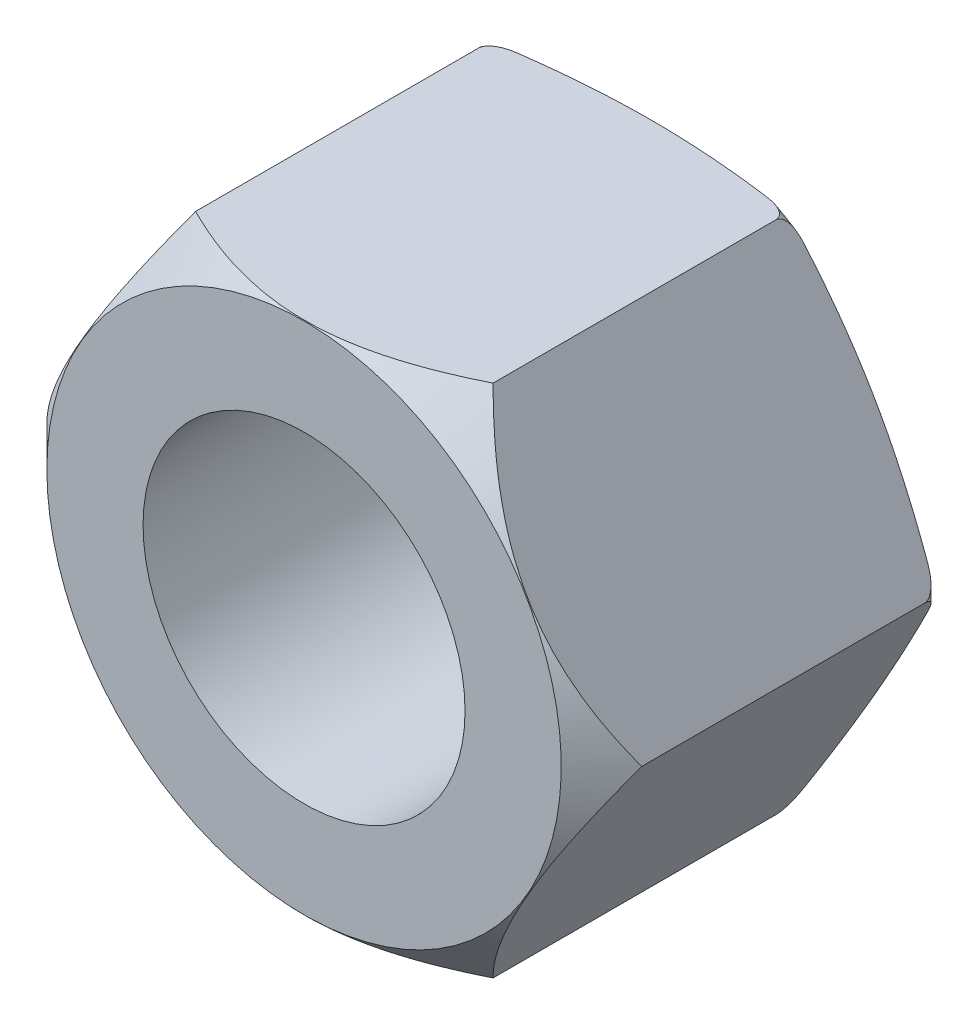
ISO-10303-21;
HEADER;
FILE_DESCRIPTION(('STEP AP214'),'2;1');
FILE_NAME('part.step','',(''),(''),'','','');
FILE_SCHEMA(('AUTOMOTIVE_DESIGN { 1 0 10303 214 1 1 1 1 }'));
ENDSEC;
DATA;
#1=APPLICATION_CONTEXT('core data for automotive mechanical design processes');
#2=APPLICATION_PROTOCOL_DEFINITION('international standard','automotive_design',2000,#1);
#3=PRODUCT_CONTEXT('',#1,'mechanical');
#4=PRODUCT('Part','Part','',(#3));
#5=PRODUCT_RELATED_PRODUCT_CATEGORY('part','',(#4));
#6=PRODUCT_DEFINITION_FORMATION('','',#4);
#7=PRODUCT_DEFINITION_CONTEXT('part definition',#1,'design');
#8=PRODUCT_DEFINITION('design','',#6,#7);
#9=PRODUCT_DEFINITION_SHAPE('','',#8);
#10=(LENGTH_UNIT() NAMED_UNIT(*) SI_UNIT(.MILLI.,.METRE.));
#11=(NAMED_UNIT(*) PLANE_ANGLE_UNIT() SI_UNIT($,.RADIAN.));
#12=(NAMED_UNIT(*) SI_UNIT($,.STERADIAN.) SOLID_ANGLE_UNIT());
#13=UNCERTAINTY_MEASURE_WITH_UNIT(LENGTH_MEASURE(1.E-05),#10,'distance_accuracy_value','');
#14=(GEOMETRIC_REPRESENTATION_CONTEXT(3) GLOBAL_UNCERTAINTY_ASSIGNED_CONTEXT((#13)) GLOBAL_UNIT_ASSIGNED_CONTEXT((#10,
#11,#12)) REPRESENTATION_CONTEXT('',''));
#15=CARTESIAN_POINT('',(0.,0.,0.));
#16=DIRECTION('',(0.,0.,1.));
#17=DIRECTION('',(1.,0.,0.));
#18=AXIS2_PLACEMENT_3D('',#15,#16,#17);
#19=CARTESIAN_POINT('',(4.61880215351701,-8.,12.4));
#20=DIRECTION('',(-0.866025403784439,0.5,0.));
#21=DIRECTION('',(-0.5,-0.866025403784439,0.));
#22=AXIS2_PLACEMENT_3D('',#19,#20,#21);
#23=PLANE('',#22);
#24=CARTESIAN_POINT('',(4.61868668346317,-8.0002,11.1498845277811));
#25=CARTESIAN_POINT('',(4.6981028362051,-7.86264718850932,11.2292917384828));
#26=CARTESIAN_POINT('',(4.77812941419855,-7.7240370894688,11.3062620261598));
#27=CARTESIAN_POINT('',(4.93952317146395,-7.44449490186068,11.4545874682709));
#28=CARTESIAN_POINT('',(5.02089105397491,-7.3035615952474,11.5259395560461));
#29=CARTESIAN_POINT('',(5.26794216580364,-6.87565651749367,11.7310650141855));
#30=CARTESIAN_POINT('',(5.43571676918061,-6.58506238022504,11.8550325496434));
#31=CARTESIAN_POINT('',(5.77404764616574,-5.99905611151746,12.0673182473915));
#32=CARTESIAN_POINT('',(5.94451745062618,-5.70379374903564,12.1561712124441));
#33=CARTESIAN_POINT('',(6.2030246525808,-5.25604614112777,12.2589521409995));
#34=CARTESIAN_POINT('',(6.28957430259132,-5.10613774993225,12.2881156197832));
#35=CARTESIAN_POINT('',(6.46340640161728,-4.80505172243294,12.3356164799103));
#36=CARTESIAN_POINT('',(6.55068873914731,-4.65387427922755,12.3539554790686));
#37=CARTESIAN_POINT('',(6.76338552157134,-4.28547264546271,12.3847036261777));
#38=CARTESIAN_POINT('',(6.88902914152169,-4.06785151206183,12.3911549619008));
#39=CARTESIAN_POINT('',(7.14008990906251,-3.63300150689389,12.3803253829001));
#40=CARTESIAN_POINT('',(7.26550696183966,-3.41577279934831,12.3630361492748));
#41=CARTESIAN_POINT('',(7.51515863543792,-2.98336341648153,12.3057445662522));
#42=CARTESIAN_POINT('',(7.63939177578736,-2.76818530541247,12.2657168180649));
#43=CARTESIAN_POINT('',(7.88572278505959,-2.34152748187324,12.165124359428));
#44=CARTESIAN_POINT('',(8.00782081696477,-2.13004748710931,12.1045612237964));
#45=CARTESIAN_POINT('',(8.22456323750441,-1.7546386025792,11.9799663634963));
#46=CARTESIAN_POINT('',(8.31968762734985,-1.58987832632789,11.9192118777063));
#47=CARTESIAN_POINT('',(8.50822887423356,-1.26331530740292,11.7879128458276));
#48=CARTESIAN_POINT('',(8.60164567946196,-1.10151265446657,11.7173680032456));
#49=CARTESIAN_POINT('',(8.78647752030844,-0.781374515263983,11.5680695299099));
#50=CARTESIAN_POINT('',(8.87789781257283,-0.623029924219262,11.4893417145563));
#51=CARTESIAN_POINT('',(9.05904561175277,-0.309272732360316,11.3247108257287));
#52=CARTESIAN_POINT('',(9.14877411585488,-0.153858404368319,11.2388121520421));
#53=CARTESIAN_POINT('',(9.23771977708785,0.000199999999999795,11.1498845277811));
#54=B_SPLINE_CURVE_WITH_KNOTS('',3,(#24,#25,#26,#27,#28,#29,#30,#31,#32,#33,#34,#35,#36,#37,#38,
#39,#40,#41,#42,#43,#44,#45,#46,#47,#48,#49,#50,#51,#52,#53),.UNSPECIFIED.,.F.,.F.,(4,2,2,2,2,2,
2,2,2,2,2,2,2,2,4),(0.,0.532696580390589,1.06568194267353,2.13740664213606,3.19211397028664,
3.71843331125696,4.24467396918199,4.99761238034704,5.75081469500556,6.50485999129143,
7.25884747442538,7.85770857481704,8.45658781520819,9.05363199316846,9.65031250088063),.UNSPECIFIED.);
#55=CARTESIAN_POINT('',(4.618802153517,-8.,11.15));
#56=VERTEX_POINT('',#55);
#57=CARTESIAN_POINT('',(9.23760430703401,0.,11.15));
#58=VERTEX_POINT('',#57);
#59=EDGE_CURVE('E212',#56,#58,#54,.T.);
#60=ORIENTED_EDGE('',*,*,#59,.F.);
#61=DIRECTION('',(0.,0.,-1.));
#62=VECTOR('',#61,1.);
#63=CARTESIAN_POINT('',(4.61880215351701,-8.,12.4));
#64=LINE('',#63,#62);
#65=CARTESIAN_POINT('',(4.618802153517,-8.,2.36887182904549));
#66=VERTEX_POINT('',#65);
#67=EDGE_CURVE('E148',#56,#66,#64,.T.);
#68=ORIENTED_EDGE('',*,*,#67,.T.);
#69=CARTESIAN_POINT('',(5.9456824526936,-5.70177590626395,2.38294483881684));
#70=CARTESIAN_POINT('',(5.94581812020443,-5.70154092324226,2.38064287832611));
#71=CARTESIAN_POINT('',(5.94592108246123,-5.70136258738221,2.37833434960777));
#72=CARTESIAN_POINT('',(5.94606004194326,-5.70112190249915,2.37370831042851));
#73=CARTESIAN_POINT('',(5.94609601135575,-5.70105960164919,2.37139079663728));
#74=CARTESIAN_POINT('',(5.94610370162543,-5.70104628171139,2.36059572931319));
#75=CARTESIAN_POINT('',(5.9456512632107,-5.70182992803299,2.35210020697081));
#76=CARTESIAN_POINT('',(5.94390353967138,-5.70485707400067,2.33545733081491));
#77=CARTESIAN_POINT('',(5.94260517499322,-5.70710590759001,2.32731136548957));
#78=CARTESIAN_POINT('',(5.93895199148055,-5.71343340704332,2.30968348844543));
#79=CARTESIAN_POINT('',(5.93641780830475,-5.7178227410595,2.30035375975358));
#80=CARTESIAN_POINT('',(5.9306575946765,-5.72779972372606,2.2826057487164));
#81=CARTESIAN_POINT('',(5.92743010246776,-5.73338990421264,2.27418944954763));
#82=CARTESIAN_POINT('',(5.91738841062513,-5.75078262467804,2.25087270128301));
#83=CARTESIAN_POINT('',(5.90997719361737,-5.76361922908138,2.23701878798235));
#84=CARTESIAN_POINT('',(5.89433749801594,-5.79070797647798,2.21132623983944));
#85=CARTESIAN_POINT('',(5.88610626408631,-5.80496489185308,2.19949478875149));
#86=CARTESIAN_POINT('',(5.86281157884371,-5.84531247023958,2.16890114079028));
#87=CARTESIAN_POINT('',(5.8472666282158,-5.87223711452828,2.15162075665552));
#88=CARTESIAN_POINT('',(5.81548815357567,-5.92727904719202,2.11976457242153));
#89=CARTESIAN_POINT('',(5.79925297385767,-5.95539920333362,2.10519578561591));
#90=CARTESIAN_POINT('',(5.76631510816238,-6.01244926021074,2.07798094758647));
#91=CARTESIAN_POINT('',(5.7496109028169,-6.04138179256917,2.06534227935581));
#92=CARTESIAN_POINT('',(5.71595247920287,-6.09967989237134,2.04163331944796));
#93=CARTESIAN_POINT('',(5.69899856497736,-6.1290449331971,2.0305612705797));
#94=CARTESIAN_POINT('',(5.65597171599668,-6.20356962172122,2.00425768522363));
#95=CARTESIAN_POINT('',(5.62976813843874,-6.24895554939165,1.98988031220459));
#96=CARTESIAN_POINT('',(5.57703713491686,-6.34028832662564,1.96364884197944));
#97=CARTESIAN_POINT('',(5.55050954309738,-6.38623546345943,1.95179609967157));
#98=CARTESIAN_POINT('',(5.49724372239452,-6.47849457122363,1.93043828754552));
#99=CARTESIAN_POINT('',(5.47050570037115,-6.52480618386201,1.92093115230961));
#100=CARTESIAN_POINT('',(5.41685106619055,-6.61773873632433,1.90420528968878));
#101=CARTESIAN_POINT('',(5.38993444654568,-6.66435968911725,1.89698665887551));
#102=CARTESIAN_POINT('',(5.32729405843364,-6.77285602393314,1.88295184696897));
#103=CARTESIAN_POINT('',(5.29152001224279,-6.834818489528,1.87701062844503));
#104=CARTESIAN_POINT('',(5.21983011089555,-6.95898904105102,1.86959608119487));
#105=CARTESIAN_POINT('',(5.18391418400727,-7.02119725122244,1.86812541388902));
#106=CARTESIAN_POINT('',(5.11228196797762,-7.14526788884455,1.87032743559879));
#107=CARTESIAN_POINT('',(5.07656552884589,-7.20713057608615,1.87397617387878));
#108=CARTESIAN_POINT('',(5.00544068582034,-7.33032241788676,1.88740869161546));
#109=CARTESIAN_POINT('',(4.97003193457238,-7.3916521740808,1.89718428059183));
#110=CARTESIAN_POINT('',(4.91566885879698,-7.48581178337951,1.91842993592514));
#111=CARTESIAN_POINT('',(4.8964506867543,-7.51909863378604,1.92717815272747));
#112=CARTESIAN_POINT('',(4.85831128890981,-7.58515800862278,1.947544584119));
#113=CARTESIAN_POINT('',(4.83939169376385,-7.6179277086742,1.95917496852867));
#114=CARTESIAN_POINT('',(4.79531134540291,-7.6942771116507,1.99076052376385));
#115=CARTESIAN_POINT('',(4.77039499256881,-7.73743350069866,2.01220474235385));
#116=CARTESIAN_POINT('',(4.73484550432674,-7.799007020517,2.05078648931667));
#117=CARTESIAN_POINT('',(4.72333006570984,-7.81895234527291,2.06466775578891));
#118=CARTESIAN_POINT('',(4.70117758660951,-7.8573215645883,2.09496981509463));
#119=CARTESIAN_POINT('',(4.69053864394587,-7.87574875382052,2.11138487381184));
#120=CARTESIAN_POINT('',(4.67377198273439,-7.90478946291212,2.1414787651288));
#121=CARTESIAN_POINT('',(4.66728801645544,-7.91602002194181,2.15435935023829));
#122=CARTESIAN_POINT('',(4.65515175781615,-7.93704063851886,2.18163923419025));
#123=CARTESIAN_POINT('',(4.64949985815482,-7.94683001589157,2.19603924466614));
#124=CARTESIAN_POINT('',(4.63927359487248,-7.96454242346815,2.22656083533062));
#125=CARTESIAN_POINT('',(4.63471200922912,-7.97244332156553,2.24269989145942));
#126=CARTESIAN_POINT('',(4.62713952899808,-7.98555924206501,2.27638132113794));
#127=CARTESIAN_POINT('',(4.62412565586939,-7.99077942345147,2.29392092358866));
#128=CARTESIAN_POINT('',(4.62046157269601,-7.99712580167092,2.32581659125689));
#129=CARTESIAN_POINT('',(4.61943165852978,-7.99890966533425,2.33999886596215));
#130=CARTESIAN_POINT('',(4.6186006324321,-8.00034904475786,2.36849141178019));
#131=CARTESIAN_POINT('',(4.6187972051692,-8.00000857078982,2.38280139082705));
#132=CARTESIAN_POINT('',(4.61989395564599,-7.99810894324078,2.40234342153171));
#133=CARTESIAN_POINT('',(4.62028240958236,-7.99743612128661,2.40770370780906));
#134=CARTESIAN_POINT('',(4.62075652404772,-7.99661493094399,2.4130298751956));
#135=B_SPLINE_CURVE_WITH_KNOTS('',3,(#69,#70,#71,#72,#73,#74,#75,#76,#77,#78,#79,#80,#81,#82,
#83,#84,#85,#86,#87,#88,#89,#90,#91,#92,#93,#94,#95,#96,#97,#98,#99,#100,#101,#102,#103,#104,
#105,#106,#107,#108,#109,#110,#111,#112,#113,#114,#115,#116,#117,#118,#119,#120,#121,#122,#123,
#124,#125,#126,#127,#128,#129,#130,#131,#132,#133,#134),.UNSPECIFIED.,.F.,.F.,(4,2,2,2,2,2,2,2,
2,2,2,2,2,2,2,2,2,2,2,2,2,2,2,2,2,2,2,2,2,2,2,2,4),(0.,0.00695039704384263,0.0139036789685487,
0.0393187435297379,0.0648268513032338,0.0964924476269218,0.128225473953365,0.188754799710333,
0.249494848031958,0.355928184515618,0.462633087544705,0.56973644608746,0.676718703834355,
0.839667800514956,1.00270412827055,1.16559637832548,1.32849550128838,1.54374863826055,
1.75912989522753,1.97350686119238,2.18759785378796,2.30576125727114,2.42443236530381,
2.58644756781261,2.66699777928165,2.74736830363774,2.8020934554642,2.85684435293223,
2.9122084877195,2.96746567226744,3.01026487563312,3.05298330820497,3.06921964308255),.UNSPECIFIED.);
#136=CARTESIAN_POINT('',(4.9951945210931,-7.34806929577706,1.89114079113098));
#137=VERTEX_POINT('',#136);
#138=EDGE_CURVE('E267',#137,#66,#135,.T.);
#139=ORIENTED_EDGE('',*,*,#138,.F.);
#140=CARTESIAN_POINT('',(8.86195591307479,-0.650642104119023,1.89134079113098));
#141=CARTESIAN_POINT('',(8.70136902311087,-0.928786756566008,1.84813520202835));
#142=CARTESIAN_POINT('',(8.54047075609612,-1.20747072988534,1.80925694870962));
#143=CARTESIAN_POINT('',(8.21811022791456,-1.76581554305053,1.74136360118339));
#144=CARTESIAN_POINT('',(8.05664781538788,-2.0454766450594,1.71235139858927));
#145=CARTESIAN_POINT('',(7.73411958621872,-2.60411192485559,1.66554258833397));
#146=CARTESIAN_POINT('',(7.57305581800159,-2.88308255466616,1.64769067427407));
#147=CARTESIAN_POINT('',(7.25072908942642,-3.44136882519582,1.62379055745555));
#148=CARTESIAN_POINT('',(7.08946615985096,-3.72068441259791,1.61774071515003));
#149=CARTESIAN_POINT('',(6.76694030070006,-4.27931558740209,1.61774071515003));
#150=CARTESIAN_POINT('',(6.6056773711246,-4.55863117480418,1.62379055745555));
#151=CARTESIAN_POINT('',(6.28335064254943,-5.11691744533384,1.64769067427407));
#152=CARTESIAN_POINT('',(6.12228687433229,-5.39588807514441,1.66554258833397));
#153=CARTESIAN_POINT('',(5.79975864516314,-5.9545233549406,1.71235139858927));
#154=CARTESIAN_POINT('',(5.63829623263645,-6.23418445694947,1.74136360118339));
#155=CARTESIAN_POINT('',(5.3159357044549,-6.79252927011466,1.80925694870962));
#156=CARTESIAN_POINT('',(5.15503743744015,-7.07121324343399,1.84813520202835));
#157=CARTESIAN_POINT('',(4.99445054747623,-7.34935789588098,1.89134079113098));
#158=B_SPLINE_CURVE_WITH_KNOTS('',3,(#140,#141,#142,#143,#144,#145,#146,#147,#148,#149,#150,
#151,#152,#153,#154,#155,#156,#157),.UNSPECIFIED.,.F.,.F.,(4,2,2,2,2,2,2,2,4),(0.,
0.972231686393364,1.94474807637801,2.91240600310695,3.87992949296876,4.84745298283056,
5.81511090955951,6.78762729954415,7.75985898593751),.UNSPECIFIED.);
#159=CARTESIAN_POINT('',(8.86121193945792,-0.651930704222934,1.89114079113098));
#160=VERTEX_POINT('',#159);
#161=EDGE_CURVE('E321',#160,#137,#158,.T.);
#162=ORIENTED_EDGE('',*,*,#161,.F.);
#163=CARTESIAN_POINT('',(9.23574210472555,-0.0032254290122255,2.41197836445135));
#164=CARTESIAN_POINT('',(9.2363556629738,-0.00216271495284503,2.40489794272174));
#165=CARTESIAN_POINT('',(9.2368198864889,-0.00135865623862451,2.39776862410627));
#166=CARTESIAN_POINT('',(9.23744310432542,-0.00027921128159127,2.38345155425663));
#167=CARTESIAN_POINT('',(9.23760186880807,-4.22313121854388E-06,2.37626376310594));
#168=CARTESIAN_POINT('',(9.23760925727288,8.57406523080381E-06,2.35410682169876));
#169=CARTESIAN_POINT('',(9.23693722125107,-0.00115542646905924,2.33912387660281));
#170=CARTESIAN_POINT('',(9.23430168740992,-0.00572030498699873,2.30961917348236));
#171=CARTESIAN_POINT('',(9.23233636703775,-0.00912433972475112,2.29509809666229));
#172=CARTESIAN_POINT('',(9.2267426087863,-0.0188130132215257,2.26385282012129));
#173=CARTESIAN_POINT('',(9.22284870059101,-0.0255574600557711,2.24732005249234));
#174=CARTESIAN_POINT('',(9.21377394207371,-0.0412754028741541,2.21574172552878));
#175=CARTESIAN_POINT('',(9.20859078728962,-0.0502528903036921,2.20069889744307));
#176=CARTESIAN_POINT('',(9.19436190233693,-0.0748980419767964,2.16480131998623));
#177=CARTESIAN_POINT('',(9.18469989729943,-0.0916331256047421,2.144931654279));
#178=CARTESIAN_POINT('',(9.16400141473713,-0.127483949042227,2.1083295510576));
#179=CARTESIAN_POINT('',(9.15296162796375,-0.146605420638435,2.09160491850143));
#180=CARTESIAN_POINT('',(9.1205784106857,-0.202694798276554,2.04815264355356));
#181=CARTESIAN_POINT('',(9.09821771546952,-0.241424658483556,2.02448730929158));
#182=CARTESIAN_POINT('',(9.052100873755,-0.321301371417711,1.98361607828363));
#183=CARTESIAN_POINT('',(9.02834156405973,-0.362453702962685,1.96642552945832));
#184=CARTESIAN_POINT('',(8.98073841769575,-0.44490477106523,1.93744677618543));
#185=CARTESIAN_POINT('',(8.95691472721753,-0.486168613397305,1.92552347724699));
#186=CARTESIAN_POINT('',(8.90891614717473,-0.569304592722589,1.90551853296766));
#187=CARTESIAN_POINT('',(8.88474183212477,-0.611175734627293,1.89743120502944));
#188=CARTESIAN_POINT('',(8.84639321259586,-0.67759749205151,1.88717830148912));
#189=CARTESIAN_POINT('',(8.83228635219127,-0.702031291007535,1.88395245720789));
#190=CARTESIAN_POINT('',(8.80402297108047,-0.75098490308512,1.87848451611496));
#191=CARTESIAN_POINT('',(8.78986644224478,-0.775504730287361,1.8762425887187));
#192=CARTESIAN_POINT('',(8.73356285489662,-0.873025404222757,1.86912393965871));
#193=CARTESIAN_POINT('',(8.6912972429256,-0.946231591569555,1.86777581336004));
#194=CARTESIAN_POINT('',(8.60681781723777,-1.09255424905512,1.87161431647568));
#195=CARTESIAN_POINT('',(8.5646041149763,-1.16567052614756,1.87680828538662));
#196=CARTESIAN_POINT('',(8.48031485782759,-1.31166380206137,1.8930003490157));
#197=CARTESIAN_POINT('',(8.43824026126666,-1.38453914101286,1.90401812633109));
#198=CARTESIAN_POINT('',(8.35457584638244,-1.52945015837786,1.93158449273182));
#199=CARTESIAN_POINT('',(8.31298565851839,-1.60148647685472,1.94812853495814));
#200=CARTESIAN_POINT('',(8.25133447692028,-1.70826945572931,1.97733512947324));
#201=CARTESIAN_POINT('',(8.23100271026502,-1.74348510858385,1.98774186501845));
#202=CARTESIAN_POINT('',(8.19055550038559,-1.81354173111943,2.01020231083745));
#203=CARTESIAN_POINT('',(8.1704401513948,-1.84838253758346,2.02225670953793));
#204=CARTESIAN_POINT('',(8.13057945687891,-1.91742328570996,2.04826719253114));
#205=CARTESIAN_POINT('',(8.1108332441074,-1.95162472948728,2.06221794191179));
#206=CARTESIAN_POINT('',(8.07182301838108,-2.01919242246,2.0925689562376));
#207=CARTESIAN_POINT('',(8.05255851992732,-2.05255951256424,2.10896662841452));
#208=CARTESIAN_POINT('',(8.01902498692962,-2.11064129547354,2.14132342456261));
#209=CARTESIAN_POINT('',(8.00458821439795,-2.13564651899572,2.15658759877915));
#210=CARTESIAN_POINT('',(7.97660135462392,-2.18412118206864,2.19038248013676));
#211=CARTESIAN_POINT('',(7.96305181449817,-2.20758967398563,2.20891517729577));
#212=CARTESIAN_POINT('',(7.94438064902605,-2.23992908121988,2.24098347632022));
#213=CARTESIAN_POINT('',(7.9383987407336,-2.25029005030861,2.25247431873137));
#214=CARTESIAN_POINT('',(7.9275469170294,-2.26908596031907,2.27736203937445));
#215=CARTESIAN_POINT('',(7.92266742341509,-2.27753749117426,2.29074071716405));
#216=CARTESIAN_POINT('',(7.91705746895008,-2.2872542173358,2.31176878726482));
#217=CARTESIAN_POINT('',(7.91551821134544,-2.28992028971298,2.31854357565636));
#218=CARTESIAN_POINT('',(7.91298335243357,-2.29431079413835,2.33248355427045));
#219=CARTESIAN_POINT('',(7.91198652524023,-2.29603734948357,2.33964782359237));
#220=CARTESIAN_POINT('',(7.91064676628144,-2.2983578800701,2.35424736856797));
#221=CARTESIAN_POINT('',(7.91030594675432,-2.2989481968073,2.36168344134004));
#222=CARTESIAN_POINT('',(7.91031176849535,-2.29893811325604,2.37664032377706));
#223=CARTESIAN_POINT('',(7.91066652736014,-2.29832365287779,2.3841611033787));
#224=CARTESIAN_POINT('',(7.91138717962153,-2.29707544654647,2.39155023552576));
#225=B_SPLINE_CURVE_WITH_KNOTS('',3,(#163,#164,#165,#166,#167,#168,#169,#170,#171,#172,#173,
#174,#175,#176,#177,#178,#179,#180,#181,#182,#183,#184,#185,#186,#187,#188,#189,#190,#191,#192,
#193,#194,#195,#196,#197,#198,#199,#200,#201,#202,#203,#204,#205,#206,#207,#208,#209,#210,#211,
#212,#213,#214,#215,#216,#217,#218,#219,#220,#221,#222,#223,#224),.UNSPECIFIED.,.F.,.F.,(4,2,2,
2,2,2,2,2,2,2,2,2,2,2,2,2,2,2,2,2,2,2,2,2,2,2,2,2,2,2,4),(0.,0.0215454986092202,
0.0431072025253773,0.087972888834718,0.132901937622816,0.1874221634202,0.2420405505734,
0.324722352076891,0.407606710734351,0.558547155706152,0.709843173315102,0.85699448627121,
1.00392712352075,1.08910389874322,1.1742953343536,1.42756712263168,1.68112330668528,
1.93554196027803,2.18975179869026,2.31564861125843,2.44159818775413,2.56720049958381,
2.69267065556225,2.79057845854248,2.88854607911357,2.93818635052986,2.98737714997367,
3.00963022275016,3.03183279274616,3.05410673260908,3.07664216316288),.UNSPECIFIED.);
#226=CARTESIAN_POINT('',(9.23760430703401,0.,2.36887182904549));
#227=VERTEX_POINT('',#226);
#228=EDGE_CURVE('E246',#227,#160,#225,.T.);
#229=ORIENTED_EDGE('',*,*,#228,.F.);
#230=DIRECTION('',(0.,0.,-1.));
#231=VECTOR('',#230,1.);
#232=CARTESIAN_POINT('',(9.23760430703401,0.,12.4));
#233=LINE('',#232,#231);
#234=EDGE_CURVE('E153',#58,#227,#233,.T.);
#235=ORIENTED_EDGE('',*,*,#234,.F.);
#236=EDGE_LOOP('',(#60,#68,#139,#162,#229,#235));
#237=FACE_BOUND('',#236,.T.);
#238=ADVANCED_FACE('F31',(#237),#23,.F.);
#239=CARTESIAN_POINT('',(9.23760430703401,0.,12.4));
#240=DIRECTION('',(-0.866025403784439,-0.5,0.));
#241=DIRECTION('',(0.5,-0.866025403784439,0.));
#242=AXIS2_PLACEMENT_3D('',#239,#240,#241);
#243=PLANE('',#242);
#244=CARTESIAN_POINT('',(9.23771977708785,-0.000200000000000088,11.1498845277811));
#245=CARTESIAN_POINT('',(9.15830362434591,0.137352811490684,11.2292917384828));
#246=CARTESIAN_POINT('',(9.07827704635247,0.275962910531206,11.3062620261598));
#247=CARTESIAN_POINT('',(8.91688328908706,0.555505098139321,11.4545874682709));
#248=CARTESIAN_POINT('',(8.8355154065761,0.696438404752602,11.5259395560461));
#249=CARTESIAN_POINT('',(8.58846429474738,1.12434348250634,11.7310650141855));
#250=CARTESIAN_POINT('',(8.42068969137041,1.41493761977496,11.8550325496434));
#251=CARTESIAN_POINT('',(8.08235881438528,2.00094388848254,12.0673182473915));
#252=CARTESIAN_POINT('',(7.91188900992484,2.29620625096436,12.1561712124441));
#253=CARTESIAN_POINT('',(7.65338180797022,2.74395385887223,12.2589521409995));
#254=CARTESIAN_POINT('',(7.5668321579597,2.89386225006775,12.2881156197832));
#255=CARTESIAN_POINT('',(7.39300005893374,3.19494827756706,12.3356164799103));
#256=CARTESIAN_POINT('',(7.30571772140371,3.34612572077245,12.3539554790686));
#257=CARTESIAN_POINT('',(7.09302093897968,3.71452735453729,12.3847036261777));
#258=CARTESIAN_POINT('',(6.96737731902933,3.93214848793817,12.3911549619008));
#259=CARTESIAN_POINT('',(6.71631655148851,4.36699849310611,12.3803253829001));
#260=CARTESIAN_POINT('',(6.59089949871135,4.58422720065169,12.3630361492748));
#261=CARTESIAN_POINT('',(6.3412478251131,5.01663658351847,12.3057445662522));
#262=CARTESIAN_POINT('',(6.21701468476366,5.23181469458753,12.2657168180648));
#263=CARTESIAN_POINT('',(5.97068367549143,5.65847251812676,12.165124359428));
#264=CARTESIAN_POINT('',(5.84858564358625,5.86995251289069,12.1045612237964));
#265=CARTESIAN_POINT('',(5.63184322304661,6.2453613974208,11.9799663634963));
#266=CARTESIAN_POINT('',(5.53671883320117,6.41012167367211,11.9192118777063));
#267=CARTESIAN_POINT('',(5.34817758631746,6.73668469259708,11.7879128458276));
#268=CARTESIAN_POINT('',(5.25476078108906,6.89848734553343,11.7173680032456));
#269=CARTESIAN_POINT('',(5.06992894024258,7.21862548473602,11.5680695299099));
#270=CARTESIAN_POINT('',(4.97850864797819,7.37697007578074,11.4893417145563));
#271=CARTESIAN_POINT('',(4.79736084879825,7.69072726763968,11.3247108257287));
#272=CARTESIAN_POINT('',(4.70763234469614,7.84614159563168,11.2388121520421));
#273=CARTESIAN_POINT('',(4.61868668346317,8.0002,11.1498845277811));
#274=B_SPLINE_CURVE_WITH_KNOTS('',3,(#244,#245,#246,#247,#248,#249,#250,#251,#252,#253,#254,
#255,#256,#257,#258,#259,#260,#261,#262,#263,#264,#265,#266,#267,#268,#269,#270,#271,#272,#273),
.UNSPECIFIED.,.F.,.F.,(4,2,2,2,2,2,2,2,2,2,2,2,2,2,4),(0.,0.532696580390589,1.06568194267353,
2.13740664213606,3.19211397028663,3.71843331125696,4.24467396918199,4.99761238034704,
5.75081469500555,6.50485999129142,7.25884747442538,7.85770857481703,8.45658781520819,
9.05363199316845,9.65031250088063),.UNSPECIFIED.);
#275=CARTESIAN_POINT('',(4.61880215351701,8.,11.15));
#276=VERTEX_POINT('',#275);
#277=EDGE_CURVE('E208',#58,#276,#274,.T.);
#278=ORIENTED_EDGE('',*,*,#277,.F.);
#279=ORIENTED_EDGE('',*,*,#234,.T.);
#280=CARTESIAN_POINT('',(7.91377498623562,2.29293964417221,2.40952937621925));
#281=CARTESIAN_POINT('',(7.91265480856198,2.29487984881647,2.40301847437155));
#282=CARTESIAN_POINT('',(7.91178943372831,2.29637872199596,2.39632146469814));
#283=CARTESIAN_POINT('',(7.91062086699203,2.29840273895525,2.38277461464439));
#284=CARTESIAN_POINT('',(7.91031455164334,2.29893329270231,2.3759258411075));
#285=CARTESIAN_POINT('',(7.91030166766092,2.29895560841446,2.36057998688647));
#286=CARTESIAN_POINT('',(7.91075590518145,2.29816884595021,2.35208010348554));
#287=CARTESIAN_POINT('',(7.91250599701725,2.29513759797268,2.33544154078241));
#288=CARTESIAN_POINT('',(7.91380311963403,2.29289091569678,2.32730342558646));
#289=CARTESIAN_POINT('',(7.91745319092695,2.28656880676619,2.30968852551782));
#290=CARTESIAN_POINT('',(7.9199856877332,2.28218239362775,2.30036440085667));
#291=CARTESIAN_POINT('',(7.92574514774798,2.272206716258,2.28261568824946));
#292=CARTESIAN_POINT('',(7.92897436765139,2.26661354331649,2.27419415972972));
#293=CARTESIAN_POINT('',(7.93902003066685,2.24921394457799,2.25086793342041));
#294=CARTESIAN_POINT('',(7.9464337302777,2.23637304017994,2.23701034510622));
#295=CARTESIAN_POINT('',(7.96207395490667,2.20928337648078,2.21131913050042));
#296=CARTESIAN_POINT('',(7.97030275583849,2.1950306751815,2.19949143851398));
#297=CARTESIAN_POINT('',(7.99358849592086,2.15469859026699,2.16890950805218));
#298=CARTESIAN_POINT('',(8.00912648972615,2.12778599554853,2.15163567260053));
#299=CARTESIAN_POINT('',(8.04089067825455,2.07276880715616,2.11979076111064));
#300=CARTESIAN_POINT('',(8.05711852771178,2.04466134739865,2.10522669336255));
#301=CARTESIAN_POINT('',(8.090055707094,1.98761247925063,2.07800837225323));
#302=CARTESIAN_POINT('',(8.10676690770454,1.9586678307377,2.06536320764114));
#303=CARTESIAN_POINT('',(8.14043951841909,1.90034515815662,2.0416427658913));
#304=CARTESIAN_POINT('',(8.15740062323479,1.87096766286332,2.03056572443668));
#305=CARTESIAN_POINT('',(8.20047579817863,1.79635927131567,2.00423257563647));
#306=CARTESIAN_POINT('',(8.22672114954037,1.75090098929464,1.98983481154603));
#307=CARTESIAN_POINT('',(8.27953705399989,1.65942115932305,1.96356970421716));
#308=CARTESIAN_POINT('',(8.30610777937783,1.61339931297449,1.95170376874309));
#309=CARTESIAN_POINT('',(8.35937552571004,1.52113686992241,1.93036079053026));
#310=CARTESIAN_POINT('',(8.38607159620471,1.4748979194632,1.92087424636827));
#311=CARTESIAN_POINT('',(8.43964157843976,1.38211198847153,1.90418208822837));
#312=CARTESIAN_POINT('',(8.46651549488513,1.3355649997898,1.89697653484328));
#313=CARTESIAN_POINT('',(8.52582624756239,1.23283576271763,1.88368858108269));
#314=CARTESIAN_POINT('',(8.55829264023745,1.17660232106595,1.87812523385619));
#315=CARTESIAN_POINT('',(8.62339080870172,1.06384898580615,1.87064095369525));
#316=CARTESIAN_POINT('',(8.65602277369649,1.0073287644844,1.86872635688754));
#317=CARTESIAN_POINT('',(8.71478266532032,0.905553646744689,1.86900365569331));
#318=CARTESIAN_POINT('',(8.74091120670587,0.860297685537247,1.87045344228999));
#319=CARTESIAN_POINT('',(8.79308106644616,0.769936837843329,1.8763639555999));
#320=CARTESIAN_POINT('',(8.81912240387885,0.724831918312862,1.88082397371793));
#321=CARTESIAN_POINT('',(8.87101173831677,0.634956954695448,1.89325365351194));
#322=CARTESIAN_POINT('',(8.89685966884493,0.590187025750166,1.90122447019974));
#323=CARTESIAN_POINT('',(8.94812273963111,0.501396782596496,1.92137598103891));
#324=CARTESIAN_POINT('',(8.97353829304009,0.457375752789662,1.93355238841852));
#325=CARTESIAN_POINT('',(9.02374086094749,0.370422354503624,1.96323174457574));
#326=CARTESIAN_POINT('',(9.04852481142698,0.327495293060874,1.98075669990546));
#327=CARTESIAN_POINT('',(9.08451312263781,0.265161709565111,2.01221136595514));
#328=CARTESIAN_POINT('',(9.09628821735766,0.244766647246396,2.02352883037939));
#329=CARTESIAN_POINT('',(9.11929292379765,0.204921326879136,2.04818197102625));
#330=CARTESIAN_POINT('',(9.13052309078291,0.185470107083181,2.06151553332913));
#331=CARTESIAN_POINT('',(9.15053952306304,0.150800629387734,2.08833909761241));
#332=CARTESIAN_POINT('',(9.15943701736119,0.135389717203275,2.10149388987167));
#333=CARTESIAN_POINT('',(9.1764461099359,0.105929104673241,2.12978804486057));
#334=CARTESIAN_POINT('',(9.18455634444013,0.0918817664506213,2.14493074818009));
#335=CARTESIAN_POINT('',(9.19971663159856,0.0656233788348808,2.17763231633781));
#336=CARTESIAN_POINT('',(9.20675103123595,0.0534394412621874,2.19522082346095));
#337=CARTESIAN_POINT('',(9.21905342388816,0.0321310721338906,2.23270065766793));
#338=CARTESIAN_POINT('',(9.22432890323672,0.0229936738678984,2.25258172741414));
#339=CARTESIAN_POINT('',(9.23105382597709,0.011345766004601,2.28704692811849));
#340=CARTESIAN_POINT('',(9.23319536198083,0.00763651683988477,2.30109106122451));
#341=CARTESIAN_POINT('',(9.23627536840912,0.00230178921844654,2.32970622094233));
#342=CARTESIAN_POINT('',(9.23721441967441,0.000675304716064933,2.34427698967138));
#343=CARTESIAN_POINT('',(9.23779526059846,-0.000330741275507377,2.37352121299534));
#344=CARTESIAN_POINT('',(9.23743685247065,0.000290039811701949,2.38819468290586));
#345=CARTESIAN_POINT('',(9.23547528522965,0.00368757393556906,2.41727548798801));
#346=CARTESIAN_POINT('',(9.23386641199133,0.00647422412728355,2.43168128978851));
#347=CARTESIAN_POINT('',(9.23166082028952,0.0102944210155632,2.44569949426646));
#348=B_SPLINE_CURVE_WITH_KNOTS('',3,(#280,#281,#282,#283,#284,#285,#286,#287,#288,#289,#290,
#291,#292,#293,#294,#295,#296,#297,#298,#299,#300,#301,#302,#303,#304,#305,#306,#307,#308,#309,
#310,#311,#312,#313,#314,#315,#316,#317,#318,#319,#320,#321,#322,#323,#324,#325,#326,#327,#328,
#329,#330,#331,#332,#333,#334,#335,#336,#337,#338,#339,#340,#341,#342,#343,#344,#345,#346,#347),
.UNSPECIFIED.,.F.,.F.,(4,2,2,2,2,2,2,2,2,2,2,2,2,2,2,2,2,2,2,2,2,2,2,2,2,2,2,2,2,2,2,2,2,4),(0.,
0.0206510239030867,0.0411863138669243,0.0666287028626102,0.092109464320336,0.12375674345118,
0.155508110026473,0.216055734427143,0.276777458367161,0.383165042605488,0.489824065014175,
0.596973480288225,0.704001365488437,0.867208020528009,1.03050518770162,1.19313950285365,
1.3557781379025,1.55119557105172,1.74695204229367,1.90370983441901,2.06043073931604,
2.21720324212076,2.37381641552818,2.5310828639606,2.60939368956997,2.68762296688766,
2.75389888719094,2.82028764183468,2.88756550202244,2.95455324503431,2.9984214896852,
3.04226853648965,3.08612226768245,3.13017757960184),.UNSPECIFIED.);
#349=CARTESIAN_POINT('',(8.86121193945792,0.651930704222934,1.89114079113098));
#350=VERTEX_POINT('',#349);
#351=EDGE_CURVE('E240',#350,#227,#348,.T.);
#352=ORIENTED_EDGE('',*,*,#351,.F.);
#353=CARTESIAN_POINT('',(4.99445054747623,7.34935789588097,1.89134079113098));
#354=CARTESIAN_POINT('',(5.15503743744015,7.07121324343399,1.84813520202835));
#355=CARTESIAN_POINT('',(5.3159357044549,6.79252927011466,1.80925694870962));
#356=CARTESIAN_POINT('',(5.63829623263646,6.23418445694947,1.74136360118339));
#357=CARTESIAN_POINT('',(5.79975864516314,5.9545233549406,1.71235139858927));
#358=CARTESIAN_POINT('',(6.1222868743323,5.39588807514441,1.66554258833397));
#359=CARTESIAN_POINT('',(6.28335064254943,5.11691744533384,1.64769067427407));
#360=CARTESIAN_POINT('',(6.6056773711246,4.55863117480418,1.62379055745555));
#361=CARTESIAN_POINT('',(6.76694030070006,4.27931558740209,1.61774071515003));
#362=CARTESIAN_POINT('',(7.08946615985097,3.72068441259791,1.61774071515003));
#363=CARTESIAN_POINT('',(7.25072908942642,3.44136882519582,1.62379055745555));
#364=CARTESIAN_POINT('',(7.57305581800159,2.88308255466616,1.64769067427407));
#365=CARTESIAN_POINT('',(7.73411958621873,2.60411192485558,1.66554258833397));
#366=CARTESIAN_POINT('',(8.05664781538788,2.04547664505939,1.71235139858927));
#367=CARTESIAN_POINT('',(8.21811022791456,1.76581554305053,1.74136360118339));
#368=CARTESIAN_POINT('',(8.54047075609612,1.20747072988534,1.80925694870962));
#369=CARTESIAN_POINT('',(8.70136902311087,0.928786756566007,1.84813520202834));
#370=CARTESIAN_POINT('',(8.86195591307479,0.650642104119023,1.89134079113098));
#371=B_SPLINE_CURVE_WITH_KNOTS('',3,(#353,#354,#355,#356,#357,#358,#359,#360,#361,#362,#363,
#364,#365,#366,#367,#368,#369,#370),.UNSPECIFIED.,.F.,.F.,(4,2,2,2,2,2,2,2,4),(0.,
0.972231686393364,1.94474807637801,2.91240600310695,3.87992949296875,4.84745298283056,
5.8151109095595,6.78762729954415,7.75985898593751),.UNSPECIFIED.);
#372=CARTESIAN_POINT('',(4.9951945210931,7.34806929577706,1.89114079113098));
#373=VERTEX_POINT('',#372);
#374=EDGE_CURVE('E226',#373,#350,#371,.T.);
#375=ORIENTED_EDGE('',*,*,#374,.F.);
#376=CARTESIAN_POINT('',(4.62075652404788,7.99661493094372,2.4130298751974));
#377=CARTESIAN_POINT('',(4.62011267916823,7.99773010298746,2.40577933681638));
#378=CARTESIAN_POINT('',(4.61962544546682,7.99857401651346,2.39847603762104));
#379=CARTESIAN_POINT('',(4.61897132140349,7.99970699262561,2.38380721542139));
#380=CARTESIAN_POINT('',(4.61880465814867,7.99999566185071,2.37644165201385));
#381=CARTESIAN_POINT('',(4.6187971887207,8.00000859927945,2.35410632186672));
#382=CARTESIAN_POINT('',(4.61946926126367,7.99884453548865,2.33912325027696));
#383=CARTESIAN_POINT('',(4.62210485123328,7.99427955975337,2.30961868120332));
#384=CARTESIAN_POINT('',(4.62407014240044,7.99087557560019,2.29509784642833));
#385=CARTESIAN_POINT('',(4.62966382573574,7.981187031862,2.26385293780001));
#386=CARTESIAN_POINT('',(4.63355769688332,7.97444264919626,2.24732031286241));
#387=CARTESIAN_POINT('',(4.64263243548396,7.95872474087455,2.21574197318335));
#388=CARTESIAN_POINT('',(4.64781562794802,7.94974718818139,2.20069901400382));
#389=CARTESIAN_POINT('',(4.66204459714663,7.92510189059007,2.16480121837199));
#390=CARTESIAN_POINT('',(4.67170665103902,7.90836672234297,2.14493147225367));
#391=CARTESIAN_POINT('',(4.69240514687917,7.87251587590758,2.10832939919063));
#392=CARTESIAN_POINT('',(4.70344488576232,7.85339448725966,2.09160484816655));
#393=CARTESIAN_POINT('',(4.73582782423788,7.79730559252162,2.0481529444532));
#394=CARTESIAN_POINT('',(4.75818825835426,7.75857618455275,2.02448781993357));
#395=CARTESIAN_POINT('',(4.80430508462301,7.67869949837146,1.98361644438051));
#396=CARTESIAN_POINT('',(4.82806466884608,7.63754669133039,1.96642568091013));
#397=CARTESIAN_POINT('',(4.87566896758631,7.55509362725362,1.9374462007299));
#398=CARTESIAN_POINT('',(4.89949355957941,7.51382822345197,1.92552252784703));
#399=CARTESIAN_POINT('',(4.94749239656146,7.43069179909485,1.90551785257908));
#400=CARTESIAN_POINT('',(4.97166603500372,7.38882182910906,1.89743085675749));
#401=CARTESIAN_POINT('',(5.00766801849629,7.32646456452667,1.88780530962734));
#402=CARTESIAN_POINT('',(5.01941905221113,7.3061111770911,1.88504255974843));
#403=CARTESIAN_POINT('',(5.04296051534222,7.26533616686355,1.88021021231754));
#404=CARTESIAN_POINT('',(5.05475095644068,7.24491452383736,1.87814084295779));
#405=CARTESIAN_POINT('',(5.10871940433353,7.15143843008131,1.8701460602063));
#406=CARTESIAN_POINT('',(5.15104587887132,7.0781268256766,1.86799494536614));
#407=CARTESIAN_POINT('',(5.235674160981,6.93154634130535,1.87036742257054));
#408=CARTESIAN_POINT('',(5.27797588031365,6.8582776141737,1.87489890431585));
#409=CARTESIAN_POINT('',(5.36236518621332,6.71211104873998,1.88982512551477));
#410=CARTESIAN_POINT('',(5.40445246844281,6.63921373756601,1.90022664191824));
#411=CARTESIAN_POINT('',(5.48816169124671,6.49422511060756,1.92655631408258));
#412=CARTESIAN_POINT('',(5.52978398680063,6.42213317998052,1.94247990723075));
#413=CARTESIAN_POINT('',(5.59143367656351,6.31535278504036,1.97064786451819));
#414=CARTESIAN_POINT('',(5.61171851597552,6.28021841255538,1.98066917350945));
#415=CARTESIAN_POINT('',(5.65208617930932,6.2102995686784,2.00229919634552));
#416=CARTESIAN_POINT('',(5.67216891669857,6.17551524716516,2.01390856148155));
#417=CARTESIAN_POINT('',(5.7121529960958,6.10626079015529,2.03902562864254));
#418=CARTESIAN_POINT('',(5.73205288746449,6.07179316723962,2.05254272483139));
#419=CARTESIAN_POINT('',(5.7713951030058,6.00365045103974,2.08189428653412));
#420=CARTESIAN_POINT('',(5.79083792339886,5.96997449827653,2.09772609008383));
#421=CARTESIAN_POINT('',(5.82927425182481,5.90340082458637,2.13283537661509));
#422=CARTESIAN_POINT('',(5.8482591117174,5.87051808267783,2.15215343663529));
#423=CARTESIAN_POINT('',(5.87540643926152,5.82349753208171,2.18514228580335));
#424=CARTESIAN_POINT('',(5.88419285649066,5.80827901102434,2.19673878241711));
#425=CARTESIAN_POINT('',(5.90105386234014,5.77907489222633,2.22181816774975));
#426=CARTESIAN_POINT('',(5.90913112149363,5.76508466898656,2.23529343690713));
#427=CARTESIAN_POINT('',(5.92003658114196,5.74619585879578,2.25718481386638));
#428=CARTESIAN_POINT('',(5.92339260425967,5.74038305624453,2.2645382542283));
#429=CARTESIAN_POINT('',(5.92965765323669,5.72953167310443,2.2799923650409));
#430=CARTESIAN_POINT('',(5.93256663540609,5.7244931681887,2.28809310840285));
#431=CARTESIAN_POINT('',(5.93728588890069,5.71631918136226,2.30366466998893));
#432=CARTESIAN_POINT('',(5.93919885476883,5.71300582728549,2.31100878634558));
#433=CARTESIAN_POINT('',(5.94240154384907,5.70745860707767,2.32620921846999));
#434=CARTESIAN_POINT('',(5.94369355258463,5.70522078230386,2.33406353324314));
#435=CARTESIAN_POINT('',(5.94534027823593,5.70236856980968,2.34874710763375));
#436=CARTESIAN_POINT('',(5.94581796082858,5.70154119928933,2.35552040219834));
#437=CARTESIAN_POINT('',(5.94619967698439,5.7008800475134,2.36919758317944));
#438=CARTESIAN_POINT('',(5.94609791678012,5.70105630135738,2.37610209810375));
#439=CARTESIAN_POINT('',(5.94568245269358,5.70177590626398,2.38294483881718));
#440=B_SPLINE_CURVE_WITH_KNOTS('',3,(#376,#377,#378,#379,#380,#381,#382,#383,#384,#385,#386,
#387,#388,#389,#390,#391,#392,#393,#394,#395,#396,#397,#398,#399,#400,#401,#402,#403,#404,#405,
#406,#407,#408,#409,#410,#411,#412,#413,#414,#415,#416,#417,#418,#419,#420,#421,#422,#423,#424,
#425,#426,#427,#428,#429,#430,#431,#432,#433,#434,#435,#436,#437,#438,#439),.UNSPECIFIED.,.F.,
.F.,(4,2,2,2,2,2,2,2,2,2,2,2,2,2,2,2,2,2,2,2,2,2,2,2,2,2,2,2,2,2,2,4),(0.,0.0220790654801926,
0.0441737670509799,0.0890403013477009,0.133968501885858,0.188488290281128,0.243107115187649,
0.325789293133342,0.408673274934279,0.559612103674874,0.710909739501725,0.858067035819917,
1.00499368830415,1.07597691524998,1.14698347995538,1.40064805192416,1.65461234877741,
1.90887044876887,2.16291896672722,2.28826110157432,2.41365479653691,2.53968902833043,
2.6655794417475,2.79304265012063,2.85614083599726,2.91899018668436,2.94881180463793,
2.97863633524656,3.00339522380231,3.02806227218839,3.04848787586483,3.06911806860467),.UNSPECIFIED.);
#441=CARTESIAN_POINT('',(4.61880215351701,8.,2.36887182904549));
#442=VERTEX_POINT('',#441);
#443=EDGE_CURVE('E234',#442,#373,#440,.T.);
#444=ORIENTED_EDGE('',*,*,#443,.F.);
#445=DIRECTION('',(0.,0.,-1.));
#446=VECTOR('',#445,1.);
#447=CARTESIAN_POINT('',(4.61880215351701,8.,12.4));
#448=LINE('',#447,#446);
#449=EDGE_CURVE('E146',#276,#442,#448,.T.);
#450=ORIENTED_EDGE('',*,*,#449,.F.);
#451=EDGE_LOOP('',(#278,#279,#352,#375,#444,#450));
#452=FACE_BOUND('',#451,.T.);
#453=ADVANCED_FACE('F217',(#452),#243,.F.);
#454=CARTESIAN_POINT('',(4.61880215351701,8.,12.4));
#455=DIRECTION('',(0.,-1.,0.));
#456=DIRECTION('',(1.,0.,0.));
#457=AXIS2_PLACEMENT_3D('',#454,#455,#456);
#458=PLANE('',#457);
#459=CARTESIAN_POINT('',(-9.6340563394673,8.,7.86502304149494));
#460=CARTESIAN_POINT('',(-9.40128275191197,8.,8.0440636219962));
#461=CARTESIAN_POINT('',(-9.16725436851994,8.,8.22149846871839));
#462=CARTESIAN_POINT('',(-8.69617533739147,8.,8.57242325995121));
#463=CARTESIAN_POINT('',(-8.45912398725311,8.,8.74591226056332));
#464=CARTESIAN_POINT('',(-7.97975398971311,8.,9.08944656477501));
#465=CARTESIAN_POINT('',(-7.73740881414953,8.,9.2594549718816));
#466=CARTESIAN_POINT('',(-7.24868415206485,8.,9.59355068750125));
#467=CARTESIAN_POINT('',(-7.00230494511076,8.,9.75763840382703));
#468=CARTESIAN_POINT('',(-6.48908013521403,8.,10.0887068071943));
#469=CARTESIAN_POINT('',(-6.2219265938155,8.,10.2552125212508));
#470=CARTESIAN_POINT('',(-5.68134615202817,8.,10.5778823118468));
#471=CARTESIAN_POINT('',(-5.40791820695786,8.,10.7340446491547));
#472=CARTESIAN_POINT('',(-4.85471531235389,8.,11.0327014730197));
#473=CARTESIAN_POINT('',(-4.57496219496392,8.,11.1752360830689));
#474=CARTESIAN_POINT('',(-4.00755071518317,8.,11.4434440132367));
#475=CARTESIAN_POINT('',(-3.71989615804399,8.,11.5691252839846));
#476=CARTESIAN_POINT('',(-3.16480511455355,8.,11.7877481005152));
#477=CARTESIAN_POINT('',(-2.89816645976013,8.,11.8826947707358));
#478=CARTESIAN_POINT('',(-2.35810027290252,8.,12.0512448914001));
#479=CARTESIAN_POINT('',(-2.0846723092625,8.,12.1248469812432));
#480=CARTESIAN_POINT('',(-1.5374201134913,8.,12.2454988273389));
#481=CARTESIAN_POINT('',(-1.2637039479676,8.,12.2930305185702));
#482=CARTESIAN_POINT('',(-0.71287638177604,8.,12.3605507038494));
#483=CARTESIAN_POINT('',(-0.435765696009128,8.,12.3805449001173));
#484=CARTESIAN_POINT('',(0.106931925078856,8.,12.3912894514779));
#485=CARTESIAN_POINT('',(0.372494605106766,8.,12.3832766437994));
#486=CARTESIAN_POINT('',(0.901545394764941,8.,12.341287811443));
#487=CARTESIAN_POINT('',(1.16503331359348,8.,12.3073094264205));
#488=CARTESIAN_POINT('',(1.69249295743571,8.,12.2147323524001));
#489=CARTESIAN_POINT('',(1.9563871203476,8.,12.1556991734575));
#490=CARTESIAN_POINT('',(2.47836483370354,8.,12.0162861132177));
#491=CARTESIAN_POINT('',(2.73644871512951,8.,11.935907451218));
#492=CARTESIAN_POINT('',(3.26112199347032,8.,11.7521522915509));
#493=CARTESIAN_POINT('',(3.52733413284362,8.,11.6477107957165));
#494=CARTESIAN_POINT('',(4.0529103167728,8.,11.4226932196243));
#495=CARTESIAN_POINT('',(4.31227120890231,8.,11.3021098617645));
#496=CARTESIAN_POINT('',(4.82537016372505,8.,11.0476682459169));
#497=CARTESIAN_POINT('',(5.07908778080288,8.,10.9137690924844));
#498=CARTESIAN_POINT('',(5.5807089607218,8.,10.6356426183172));
#499=CARTESIAN_POINT('',(5.82861341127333,8.,10.491416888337));
#500=CARTESIAN_POINT('',(6.30725136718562,8.,10.2019810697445));
#501=CARTESIAN_POINT('',(6.538228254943,8.,10.0571713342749));
#502=CARTESIAN_POINT('',(6.9962136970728,8.,9.76138871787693));
#503=CARTESIAN_POINT('',(7.22322195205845,8.,9.61041537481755));
#504=CARTESIAN_POINT('',(7.67196405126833,8.,9.30463392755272));
#505=CARTESIAN_POINT('',(7.89372561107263,8.,9.14986635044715));
#506=CARTESIAN_POINT('',(8.33420656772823,8.,8.8361829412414));
#507=CARTESIAN_POINT('',(8.55292678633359,8.,8.67726826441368));
#508=CARTESIAN_POINT('',(8.77037123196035,8.,8.51665609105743));
#509=B_SPLINE_CURVE_WITH_KNOTS('',3,(#459,#460,#461,#462,#463,#464,#465,#466,#467,#468,#469,
#470,#471,#472,#473,#474,#475,#476,#477,#478,#479,#480,#481,#482,#483,#484,#485,#486,#487,#488,
#489,#490,#491,#492,#493,#494,#495,#496,#497,#498,#499,#500,#501,#502,#503,#504,#505,#506,#507,
#508),.UNSPECIFIED.,.F.,.F.,(4,2,2,2,2,2,2,2,2,2,2,2,2,2,2,2,2,2,2,2,2,2,2,2,4),(0.,
0.881010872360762,1.76223032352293,2.65024868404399,3.5382057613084,4.48240113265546,
5.42675486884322,6.36823655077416,7.30927251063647,8.15765736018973,9.00609627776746,
9.83827152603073,10.6702744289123,11.4660076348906,12.26181318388,13.0720226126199,
13.8821857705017,14.7394283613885,15.5970587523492,16.4574095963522,17.3176281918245,
18.1353653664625,18.9531639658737,19.7643957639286,20.5754039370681),.UNSPECIFIED.);
#510=CARTESIAN_POINT('',(-4.61880215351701,8.,11.15));
#511=VERTEX_POINT('',#510);
#512=EDGE_CURVE('E125',#276,#511,#509,.F.);
#513=ORIENTED_EDGE('',*,*,#512,.F.);
#514=ORIENTED_EDGE('',*,*,#449,.T.);
#515=CARTESIAN_POINT('',(1.96470536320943,7.99999999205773,2.37972938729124));
#516=CARTESIAN_POINT('',(1.96399321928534,7.99999999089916,2.37189161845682));
#517=CARTESIAN_POINT('',(1.96405548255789,7.99999999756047,2.36397622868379));
#518=CARTESIAN_POINT('',(1.96572562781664,8.00000000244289,2.34830809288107));
#519=CARTESIAN_POINT('',(1.9673356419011,8.00000000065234,2.34055558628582));
#520=CARTESIAN_POINT('',(1.97185087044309,7.99999999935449,2.32553936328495));
#521=CARTESIAN_POINT('',(1.97474235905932,7.99999999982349,2.31827138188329));
#522=CARTESIAN_POINT('',(1.98152894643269,8.00000000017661,2.3042288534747));
#523=CARTESIAN_POINT('',(1.98542465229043,8.00000000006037,2.29745460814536));
#524=CARTESIAN_POINT('',(1.99765829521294,7.9999999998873,2.27873778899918));
#525=CARTESIAN_POINT('',(2.00691955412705,7.99999999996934,2.26740564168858));
#526=CARTESIAN_POINT('',(2.02693057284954,8.00000000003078,2.24613983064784));
#527=CARTESIAN_POINT('',(2.03768629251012,8.00000000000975,2.23621210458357));
#528=CARTESIAN_POINT('',(2.0656790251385,7.99999999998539,2.2127667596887));
#529=CARTESIAN_POINT('',(2.0834751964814,7.99999999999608,2.1999250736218));
#530=CARTESIAN_POINT('',(2.12017493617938,8.00000000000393,2.17591078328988));
#531=CARTESIAN_POINT('',(2.13908100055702,8.00000000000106,2.16474215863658));
#532=CARTESIAN_POINT('',(2.17766865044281,7.99999999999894,2.14360014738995));
#533=CARTESIAN_POINT('',(2.19735367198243,7.99999999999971,2.13363308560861));
#534=CARTESIAN_POINT('',(2.23716213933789,8.00000000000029,2.11469085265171));
#535=CARTESIAN_POINT('',(2.25728508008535,8.0000000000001,2.10571460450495));
#536=CARTESIAN_POINT('',(2.31345200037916,7.99999999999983,2.08195566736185));
#537=CARTESIAN_POINT('',(2.34984984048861,7.99999999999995,2.06801043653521));
#538=CARTESIAN_POINT('',(2.42330919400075,8.00000000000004,2.04197836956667));
#539=CARTESIAN_POINT('',(2.46037103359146,8.00000000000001,2.0298924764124));
#540=CARTESIAN_POINT('',(2.57238536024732,7.99999999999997,1.99587828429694));
#541=CARTESIAN_POINT('',(2.64803787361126,7.99999999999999,1.97624437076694));
#542=CARTESIAN_POINT('',(2.80062958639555,8.00000000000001,1.94187526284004));
#543=CARTESIAN_POINT('',(2.87757170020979,8.,1.92715339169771));
#544=CARTESIAN_POINT('',(3.03212225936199,8.,1.90246570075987));
#545=CARTESIAN_POINT('',(3.10972977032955,8.,1.89249406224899));
#546=CARTESIAN_POINT('',(3.26554073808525,8.,1.8774833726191));
#547=CARTESIAN_POINT('',(3.34374488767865,8.,1.87245138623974));
#548=CARTESIAN_POINT('',(3.50042140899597,8.,1.86794825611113));
#549=CARTESIAN_POINT('',(3.5788939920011,8.,1.86848393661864));
#550=CARTESIAN_POINT('',(3.73506431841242,8.,1.87615523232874));
#551=CARTESIAN_POINT('',(3.81276377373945,8.,1.88324768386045));
#552=CARTESIAN_POINT('',(3.92833280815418,8.,1.9000820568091));
#553=CARTESIAN_POINT('',(3.96665856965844,8.,1.90671742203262));
#554=CARTESIAN_POINT('',(4.04281170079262,8.,1.92238260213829));
#555=CARTESIAN_POINT('',(4.08063925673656,8.,1.93141149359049));
#556=CARTESIAN_POINT('',(4.16734974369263,8.,1.95557766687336));
#557=CARTESIAN_POINT('',(4.21595315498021,8.,1.97174347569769));
#558=CARTESIAN_POINT('',(4.31060218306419,8.,2.01031590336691));
#559=CARTESIAN_POINT('',(4.35665590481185,8.,2.03270120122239));
#560=CARTESIAN_POINT('',(4.42133778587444,8.,2.07225527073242));
#561=CARTESIAN_POINT('',(4.441919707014,8.,2.08621290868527));
#562=CARTESIAN_POINT('',(4.48130498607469,8.,2.11650126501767));
#563=CARTESIAN_POINT('',(4.50010844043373,8.,2.13283185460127));
#564=CARTESIAN_POINT('',(4.53199698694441,8.,2.16513235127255));
#565=CARTESIAN_POINT('',(4.54550859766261,8.,2.18067596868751));
#566=CARTESIAN_POINT('',(4.56990091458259,8.,2.21371536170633));
#567=CARTESIAN_POINT('',(4.58078707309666,8.,2.23120697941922));
#568=CARTESIAN_POINT('',(4.59658141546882,8.,2.26320533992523));
#569=CARTESIAN_POINT('',(4.60230799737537,8.,2.27730515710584));
#570=CARTESIAN_POINT('',(4.61135871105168,8.,2.30625889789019));
#571=CARTESIAN_POINT('',(4.61468516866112,8.,2.32111207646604));
#572=CARTESIAN_POINT('',(4.61864018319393,8.,2.35125850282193));
#573=CARTESIAN_POINT('',(4.61925489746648,8.,2.36655360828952));
#574=CARTESIAN_POINT('',(4.61768314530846,8.,2.39699966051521));
#575=CARTESIAN_POINT('',(4.61549607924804,8.,2.41215057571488));
#576=CARTESIAN_POINT('',(4.60878139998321,8.,2.44081562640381));
#577=CARTESIAN_POINT('',(4.60442428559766,8.,2.45437080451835));
#578=CARTESIAN_POINT('',(4.5937931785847,8.,2.48069799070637));
#579=CARTESIAN_POINT('',(4.58751845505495,8.,2.49346969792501));
#580=CARTESIAN_POINT('',(4.5694285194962,8.,2.52503991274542));
#581=CARTESIAN_POINT('',(4.556481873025,8.,2.54318893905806));
#582=CARTESIAN_POINT('',(4.52791700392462,8.,2.57724745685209));
#583=CARTESIAN_POINT('',(4.51229113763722,8.,2.59315029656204));
#584=CARTESIAN_POINT('',(4.46801354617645,8.,2.63298593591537));
#585=CARTESIAN_POINT('',(4.43770691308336,8.,2.65506327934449));
#586=CARTESIAN_POINT('',(4.37427139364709,8.,2.69461737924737));
#587=CARTESIAN_POINT('',(4.34113601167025,8.,2.7120831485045));
#588=CARTESIAN_POINT('',(4.27373375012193,8.,2.74308420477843));
#589=CARTESIAN_POINT('',(4.23949290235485,8.,2.75667705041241));
#590=CARTESIAN_POINT('',(4.16997922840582,8.,2.7809409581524));
#591=CARTESIAN_POINT('',(4.13470544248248,8.,2.79160920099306));
#592=CARTESIAN_POINT('',(4.02778786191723,8.,2.81998712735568));
#593=CARTESIAN_POINT('',(3.95516917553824,8.,2.83401931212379));
#594=CARTESIAN_POINT('',(3.80538887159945,8.,2.85525967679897));
#595=CARTESIAN_POINT('',(3.72817994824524,8.,2.86209682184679));
#596=CARTESIAN_POINT('',(3.57339966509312,8.,2.86934491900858));
#597=CARTESIAN_POINT('',(3.49582799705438,8.,2.86974869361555));
#598=CARTESIAN_POINT('',(3.34087152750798,8.,2.86512027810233));
#599=CARTESIAN_POINT('',(3.26348671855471,8.,2.86008830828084));
#600=CARTESIAN_POINT('',(3.10923769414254,8.,2.84517586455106));
#601=CARTESIAN_POINT('',(3.03237318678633,7.99999999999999,2.83529838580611));
#602=CARTESIAN_POINT('',(2.89681497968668,8.,2.81367909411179));
#603=CARTESIAN_POINT('',(2.83796958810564,8.00000000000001,2.80287413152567));
#604=CARTESIAN_POINT('',(2.72092468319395,7.99999999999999,2.77842159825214));
#605=CARTESIAN_POINT('',(2.66272458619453,7.99999999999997,2.76477686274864));
#606=CARTESIAN_POINT('',(2.56439467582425,8.00000000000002,2.73884710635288));
#607=CARTESIAN_POINT('',(2.52405121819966,8.00000000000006,2.72736977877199));
#608=CARTESIAN_POINT('',(2.44393294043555,7.99999999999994,2.70260523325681));
#609=CARTESIAN_POINT('',(2.40415788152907,7.99999999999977,2.68931880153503));
#610=CARTESIAN_POINT('',(2.33742776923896,8.00000000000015,2.66487536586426));
#611=CARTESIAN_POINT('',(2.31025895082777,8.0000000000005,2.65430290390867));
#612=CARTESIAN_POINT('',(2.25643997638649,7.9999999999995,2.63177975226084));
#613=CARTESIAN_POINT('',(2.22979065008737,7.99999999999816,2.61982704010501));
#614=CARTESIAN_POINT('',(2.17712725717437,8.00000000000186,2.59400373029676));
#615=CARTESIAN_POINT('',(2.15112140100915,8.00000000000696,2.58011633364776));
#616=CARTESIAN_POINT('',(2.10066979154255,7.99999999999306,2.54974381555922));
#617=CARTESIAN_POINT('',(2.07621945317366,7.99999999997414,2.53326687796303));
#618=CARTESIAN_POINT('',(2.04419018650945,8.00000000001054,2.50712544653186));
#619=CARTESIAN_POINT('',(2.03519983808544,8.00000000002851,2.49921043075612));
#620=CARTESIAN_POINT('',(2.01806197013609,7.99999999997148,2.48248508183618));
#621=CARTESIAN_POINT('',(2.00991480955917,7.99999999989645,2.47367437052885));
#622=CARTESIAN_POINT('',(1.99627415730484,8.00000000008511,2.45664288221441));
#623=CARTESIAN_POINT('',(1.99056646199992,8.00000000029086,2.44859640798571));
#624=CARTESIAN_POINT('',(1.98047629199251,7.99999999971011,2.43171297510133));
#625=CARTESIAN_POINT('',(1.97608947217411,7.99999999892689,2.42287873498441));
#626=CARTESIAN_POINT('',(1.97058400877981,8.0000000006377,2.40823456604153));
#627=CARTESIAN_POINT('',(1.96886151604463,8.00000000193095,2.40265189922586));
#628=CARTESIAN_POINT('',(1.96618615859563,7.9999999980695,2.39130346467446));
#629=CARTESIAN_POINT('',(1.96523311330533,7.99999999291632,2.38553774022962));
#630=CARTESIAN_POINT('',(1.96470536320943,7.99999999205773,2.37972938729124));
#631=B_SPLINE_CURVE_WITH_KNOTS('',3,(#515,#516,#517,#518,#519,#520,#521,#522,#523,#524,#525,
#526,#527,#528,#529,#530,#531,#532,#533,#534,#535,#536,#537,#538,#539,#540,#541,#542,#543,#544,
#545,#546,#547,#548,#549,#550,#551,#552,#553,#554,#555,#556,#557,#558,#559,#560,#561,#562,#563,
#564,#565,#566,#567,#568,#569,#570,#571,#572,#573,#574,#575,#576,#577,#578,#579,#580,#581,#582,
#583,#584,#585,#586,#587,#588,#589,#590,#591,#592,#593,#594,#595,#596,#597,#598,#599,#600,#601,
#602,#603,#604,#605,#606,#607,#608,#609,#610,#611,#612,#613,#614,#615,#616,#617,#618,#619,#620,
#621,#622,#623,#624,#625,#626,#627,#628,#629,#630),.UNSPECIFIED.,.T.,.F.,(4,2,2,2,2,2,2,2,2,2,2,
2,2,2,2,2,2,2,2,2,2,2,2,2,2,2,2,2,2,2,2,2,2,2,2,2,2,2,2,2,2,2,2,2,2,2,2,2,2,2,2,2,2,2,2,2,2,4),
(0.,0.0235825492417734,0.0471976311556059,0.0705656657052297,0.0939478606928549,
0.137599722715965,0.181430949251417,0.247101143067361,0.312925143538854,0.379081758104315,
0.445165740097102,0.56202207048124,0.678937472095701,0.913182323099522,1.1480574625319,
1.38264415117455,1.61756586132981,1.85277554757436,2.08644777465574,2.20307514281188,
2.31965758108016,2.47304111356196,2.62590518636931,2.70038362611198,2.77485802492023,
2.83644934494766,2.8979116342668,2.94338810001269,2.98882043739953,3.03448442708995,
3.08015819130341,3.12270487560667,3.16526779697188,3.23176474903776,3.2984546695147,
3.41030851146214,3.52242649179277,3.63277907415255,3.74323766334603,3.96454554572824,
4.19677755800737,4.42926864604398,4.66175031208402,4.89408845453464,5.07351513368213,
5.25276352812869,5.37856464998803,5.50431127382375,5.59174630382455,5.67931111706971,
5.7676900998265,5.85579519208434,5.89168749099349,5.92759500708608,5.9571088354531,
5.98652448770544,6.00400496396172,6.02148133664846),.UNSPECIFIED.);
#632=CARTESIAN_POINT('',(3.86601741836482,8.,1.89114079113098));
#633=VERTEX_POINT('',#632);
#634=EDGE_CURVE('E300',#633,#442,#631,.T.);
#635=ORIENTED_EDGE('',*,*,#634,.F.);
#636=CARTESIAN_POINT('',(-12.1662024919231,8.00000000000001,3.64417297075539));
#637=CARTESIAN_POINT('',(-11.8040485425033,8.,3.55073576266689));
#638=CARTESIAN_POINT('',(-11.4415967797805,8.,3.45843179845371));
#639=CARTESIAN_POINT('',(-10.7159495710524,8.,3.27670877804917));
#640=CARTESIAN_POINT('',(-10.3527540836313,8.,3.18728988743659));
#641=CARTESIAN_POINT('',(-9.62502752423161,8.,3.01184928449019));
#642=CARTESIAN_POINT('',(-9.26049531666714,8.,2.92583226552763));
#643=CARTESIAN_POINT('',(-8.53042845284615,8.,2.75816543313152));
#644=CARTESIAN_POINT('',(-8.16489380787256,8.,2.6765155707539));
#645=CARTESIAN_POINT('',(-7.43665692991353,8.,2.519504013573));
#646=CARTESIAN_POINT('',(-7.07396749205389,8.,2.44408326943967));
#647=CARTESIAN_POINT('',(-6.3472696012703,8.,2.29983335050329));
#648=CARTESIAN_POINT('',(-5.98326114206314,8.,2.23100420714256));
#649=CARTESIAN_POINT('',(-5.25385285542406,8.,2.10152175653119));
#650=CARTESIAN_POINT('',(-4.88845331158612,8.,2.0408668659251));
#651=CARTESIAN_POINT('',(-4.15611606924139,8.,1.92955658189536));
#652=CARTESIAN_POINT('',(-3.78917836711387,8.,1.87890121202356));
#653=CARTESIAN_POINT('',(-3.0481384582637,8.,1.78889999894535));
#654=CARTESIAN_POINT('',(-2.67401318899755,8.,1.74974110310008));
#655=CARTESIAN_POINT('',(-1.92452564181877,8.,1.6858016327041));
#656=CARTESIAN_POINT('',(-1.54916340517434,8.,1.66102058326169));
#657=CARTESIAN_POINT('',(-0.797940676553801,8.,1.62735079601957));
#658=CARTESIAN_POINT('',(-0.422080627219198,8.,1.6184523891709));
#659=CARTESIAN_POINT('',(0.329669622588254,8.,1.61711146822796));
#660=CARTESIAN_POINT('',(0.705559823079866,8.,1.62466896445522));
#661=CARTESIAN_POINT('',(1.45851915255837,8.,1.65581109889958));
#662=CARTESIAN_POINT('',(1.83558495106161,8.,1.67947460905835));
#663=CARTESIAN_POINT('',(2.58850004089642,8.,1.7414455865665));
#664=CARTESIAN_POINT('',(2.96434929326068,8.,1.77975351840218));
#665=CARTESIAN_POINT('',(3.71485914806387,8.,1.86904616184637));
#666=CARTESIAN_POINT('',(4.08951837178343,8.,1.92004228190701));
#667=CARTESIAN_POINT('',(4.83723438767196,8.,2.03256220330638));
#668=CARTESIAN_POINT('',(5.21029117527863,8.,2.09408603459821));
#669=CARTESIAN_POINT('',(5.93085321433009,8.,2.2214492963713));
#670=CARTESIAN_POINT('',(6.278453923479,8.,2.28675408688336));
#671=CARTESIAN_POINT('',(6.9724563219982,8.,2.42347920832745));
#672=CARTESIAN_POINT('',(7.3188579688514,8.,2.49489975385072));
#673=CARTESIAN_POINT('',(8.01063838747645,8.,2.6427202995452));
#674=CARTESIAN_POINT('',(8.35601702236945,8.,2.71912093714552));
#675=CARTESIAN_POINT('',(9.0458467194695,8.,2.87596841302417));
#676=CARTESIAN_POINT('',(9.39029779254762,8.,2.95641520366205));
#677=CARTESIAN_POINT('',(10.0784914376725,8.,3.12063523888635));
#678=CARTESIAN_POINT('',(10.4222338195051,8.,3.20440927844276));
#679=CARTESIAN_POINT('',(11.1090440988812,8.,3.37468187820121));
#680=CARTESIAN_POINT('',(11.4521119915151,7.99999999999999,3.46118045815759));
#681=CARTESIAN_POINT('',(12.4803976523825,7.99999999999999,3.72401889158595));
#682=CARTESIAN_POINT('',(13.1647569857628,7.99999999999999,3.90371584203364));
#683=CARTESIAN_POINT('',(14.5225635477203,7.99999999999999,4.26687296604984));
#684=CARTESIAN_POINT('',(15.196033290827,7.99999999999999,4.45024950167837));
#685=CARTESIAN_POINT('',(16.541771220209,7.99999999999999,4.82141313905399));
#686=CARTESIAN_POINT('',(17.2140393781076,7.99999999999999,5.00920034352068));
#687=CARTESIAN_POINT('',(18.5566567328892,7.99999999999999,5.38774961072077));
#688=CARTESIAN_POINT('',(19.2270072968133,7.99999999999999,5.57850683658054));
#689=CARTESIAN_POINT('',(20.5669608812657,7.99999999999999,5.96252660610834));
#690=CARTESIAN_POINT('',(21.2365639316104,7.99999999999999,6.15578904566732));
#691=CARTESIAN_POINT('',(21.9059060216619,7.99999999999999,6.34994132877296));
#692=B_SPLINE_CURVE_WITH_KNOTS('',3,(#636,#637,#638,#639,#640,#641,#642,#643,#644,#645,#646,
#647,#648,#649,#650,#651,#652,#653,#654,#655,#656,#657,#658,#659,#660,#661,#662,#663,#664,#665,
#666,#667,#668,#669,#670,#671,#672,#673,#674,#675,#676,#677,#678,#679,#680,#681,#682,#683,#684,
#685,#686,#687,#688,#689,#690,#691),.UNSPECIFIED.,.F.,.F.,(4,2,2,2,2,2,2,2,2,2,2,2,2,2,2,2,2,2,
2,2,2,2,2,2,2,2,2,4),(0.,1.12204613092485,2.24415654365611,3.36776459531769,4.49136005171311,
5.60265615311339,6.71395755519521,7.82504338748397,8.93613183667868,10.0643972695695,
11.1926254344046,12.3201665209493,13.4477083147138,14.5808118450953,15.7139513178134,
16.8481133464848,17.982278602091,19.0432597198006,20.1042780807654,21.1654325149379,
22.2265744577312,23.2879714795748,24.3493761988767,26.4720017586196,28.5659510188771,
30.6599490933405,32.7508345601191,34.8416334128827),.UNSPECIFIED.);
#693=CARTESIAN_POINT('',(-3.86601741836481,8.,1.89114079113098));
#694=VERTEX_POINT('',#693);
#695=EDGE_CURVE('E327',#694,#633,#692,.T.);
#696=ORIENTED_EDGE('',*,*,#695,.F.);
#697=CARTESIAN_POINT('',(-4.48383946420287,8.,2.11930672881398));
#698=CARTESIAN_POINT('',(-4.45158410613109,8.,2.09192122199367));
#699=CARTESIAN_POINT('',(-4.41626596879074,8.,2.06809239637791));
#700=CARTESIAN_POINT('',(-4.34240929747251,8.,2.02592006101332));
#701=CARTESIAN_POINT('',(-4.30385113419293,8.,2.00761360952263));
#702=CARTESIAN_POINT('',(-4.22654337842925,8.,1.97601382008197));
#703=CARTESIAN_POINT('',(-4.18786256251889,8.,1.96254987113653));
#704=CARTESIAN_POINT('',(-4.10949844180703,8.,1.93890000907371));
#705=CARTESIAN_POINT('',(-4.06981417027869,8.,1.92871739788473));
#706=CARTESIAN_POINT('',(-3.94985242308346,8.,1.90225214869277));
#707=CARTESIAN_POINT('',(-3.86867408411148,8.,1.89005506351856));
#708=CARTESIAN_POINT('',(-3.70229229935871,8.,1.87347366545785));
#709=CARTESIAN_POINT('',(-3.61705979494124,8.,1.86942852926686));
#710=CARTESIAN_POINT('',(-3.44647734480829,8.,1.86842177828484));
#711=CARTESIAN_POINT('',(-3.36112737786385,8.,1.87146841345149));
#712=CARTESIAN_POINT('',(-3.19077904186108,8.,1.88366673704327));
#713=CARTESIAN_POINT('',(-3.10578125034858,8.,1.89282610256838));
#714=CARTESIAN_POINT('',(-2.93664608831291,8.,1.91678816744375));
#715=CARTESIAN_POINT('',(-2.85250808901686,8.,1.93158638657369));
#716=CARTESIAN_POINT('',(-2.72396567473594,8.,1.95884427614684));
#717=CARTESIAN_POINT('',(-2.67911645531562,8.,1.96923968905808));
#718=CARTESIAN_POINT('',(-2.58986390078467,8.,1.99188233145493));
#719=CARTESIAN_POINT('',(-2.54546074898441,8.,2.00413029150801));
#720=CARTESIAN_POINT('',(-2.45733000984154,8.,2.03074645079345));
#721=CARTESIAN_POINT('',(-2.41360186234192,8.,2.04511277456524));
#722=CARTESIAN_POINT('',(-2.32714427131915,8.,2.07650559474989));
#723=CARTESIAN_POINT('',(-2.284413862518,8.,2.09352938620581));
#724=CARTESIAN_POINT('',(-2.20883329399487,8.,2.12766485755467));
#725=CARTESIAN_POINT('',(-2.17569078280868,8.,2.14410272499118));
#726=CARTESIAN_POINT('',(-2.12759988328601,8.,2.17157209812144));
#727=CARTESIAN_POINT('',(-2.11185036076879,8.,2.18118972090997));
#728=CARTESIAN_POINT('',(-2.0811866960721,8.,2.20166254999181));
#729=CARTESIAN_POINT('',(-2.06627135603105,8.,2.2125159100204));
#730=CARTESIAN_POINT('',(-2.04028789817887,8.,2.23387607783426));
#731=CARTESIAN_POINT('',(-2.02900195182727,8.,2.24411456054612));
#732=CARTESIAN_POINT('',(-2.00800946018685,8.,2.26609647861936));
#733=CARTESIAN_POINT('',(-1.99829603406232,8.,2.27783293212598));
#734=CARTESIAN_POINT('',(-1.98562978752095,8.,2.29710585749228));
#735=CARTESIAN_POINT('',(-1.98166460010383,8.,2.30396877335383));
#736=CARTESIAN_POINT('',(-1.97476596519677,8.,2.3182024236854));
#737=CARTESIAN_POINT('',(-1.97183175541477,8.,2.32557277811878));
#738=CARTESIAN_POINT('',(-1.96726542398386,8.,2.34082008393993));
#739=CARTESIAN_POINT('',(-1.96564992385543,8.,2.34870218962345));
#740=CARTESIAN_POINT('',(-1.96402177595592,8.,2.36462834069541));
#741=CARTESIAN_POINT('',(-1.96400717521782,8.,2.37267217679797));
#742=CARTESIAN_POINT('',(-1.96546966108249,8.,2.38752422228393));
#743=CARTESIAN_POINT('',(-1.96674697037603,8.,2.39435347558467));
#744=CARTESIAN_POINT('',(-1.97035464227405,8.,2.40772728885));
#745=CARTESIAN_POINT('',(-1.97268605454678,8.,2.41427155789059));
#746=CARTESIAN_POINT('',(-1.9796420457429,8.,2.4302977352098));
#747=CARTESIAN_POINT('',(-1.9848285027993,8.,2.4395331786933));
#748=CARTESIAN_POINT('',(-1.99653992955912,8.,2.45710836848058));
#749=CARTESIAN_POINT('',(-2.00306881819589,8.,2.46544538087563));
#750=CARTESIAN_POINT('',(-2.02369705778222,8.,2.48897748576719));
#751=CARTESIAN_POINT('',(-2.03904169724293,8.,2.50306312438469));
#752=CARTESIAN_POINT('',(-2.07138040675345,8.,2.52916105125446));
#753=CARTESIAN_POINT('',(-2.08838000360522,8.,2.54116599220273));
#754=CARTESIAN_POINT('',(-2.13671582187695,8.,2.57236087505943));
#755=CARTESIAN_POINT('',(-2.16904498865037,8.,2.58999688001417));
#756=CARTESIAN_POINT('',(-2.23510015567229,8.,2.62247168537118));
#757=CARTESIAN_POINT('',(-2.26882950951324,8.,2.63730323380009));
#758=CARTESIAN_POINT('',(-2.33727607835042,8.,2.66499237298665));
#759=CARTESIAN_POINT('',(-2.3719972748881,8.,2.67784009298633));
#760=CARTESIAN_POINT('',(-2.44194596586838,8.,2.70190158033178));
#761=CARTESIAN_POINT('',(-2.47717283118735,8.,2.71311721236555));
#762=CARTESIAN_POINT('',(-2.59594867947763,8.,2.74847766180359));
#763=CARTESIAN_POINT('',(-2.68040701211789,8.,2.76959021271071));
#764=CARTESIAN_POINT('',(-2.85066862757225,8.,2.80583644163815));
#765=CARTESIAN_POINT('',(-2.93647348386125,8.,2.82096248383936));
#766=CARTESIAN_POINT('',(-3.10874976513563,8.,2.84530622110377));
#767=CARTESIAN_POINT('',(-3.19521952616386,8.,2.85453560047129));
#768=CARTESIAN_POINT('',(-3.36855311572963,8.,2.86665633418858));
#769=CARTESIAN_POINT('',(-3.45541651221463,8.,2.86955346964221));
#770=CARTESIAN_POINT('',(-3.59102708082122,8.,2.86828090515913));
#771=CARTESIAN_POINT('',(-3.63980242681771,8.,2.86665098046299));
#772=CARTESIAN_POINT('',(-3.73718772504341,8.,2.86073850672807));
#773=CARTESIAN_POINT('',(-3.78579771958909,8.,2.85645669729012));
#774=CARTESIAN_POINT('',(-3.8824635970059,8.,2.84485638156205));
#775=CARTESIAN_POINT('',(-3.93052092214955,8.,2.83755015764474));
#776=CARTESIAN_POINT('',(-4.02597520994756,8.,2.81933735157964));
#777=CARTESIAN_POINT('',(-4.07337216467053,8.,2.80843072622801));
#778=CARTESIAN_POINT('',(-4.15458186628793,8.,2.78566754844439));
#779=CARTESIAN_POINT('',(-4.18867607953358,8.,2.77482273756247));
#780=CARTESIAN_POINT('',(-4.25580681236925,8.,2.75028944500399));
#781=CARTESIAN_POINT('',(-4.28884446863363,8.,2.73660414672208));
#782=CARTESIAN_POINT('',(-4.35360803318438,8.,2.70561355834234));
#783=CARTESIAN_POINT('',(-4.38531762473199,8.,2.68827361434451));
#784=CARTESIAN_POINT('',(-4.44590558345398,8.,2.64920535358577));
#785=CARTESIAN_POINT('',(-4.47479336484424,8.,2.6274924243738));
#786=CARTESIAN_POINT('',(-4.51498656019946,8.,2.59030583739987));
#787=CARTESIAN_POINT('',(-4.52810369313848,8.,2.57679964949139));
#788=CARTESIAN_POINT('',(-4.55247332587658,8.,2.54816014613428));
#789=CARTESIAN_POINT('',(-4.56372522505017,8.,2.53302630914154));
#790=CARTESIAN_POINT('',(-4.5838045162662,8.,2.50091140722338));
#791=CARTESIAN_POINT('',(-4.59259791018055,8.,2.48390857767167));
#792=CARTESIAN_POINT('',(-4.60668251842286,8.,2.44850959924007));
#793=CARTESIAN_POINT('',(-4.61198208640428,8.,2.43011689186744));
#794=CARTESIAN_POINT('',(-4.61798349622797,8.,2.39496113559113));
#795=CARTESIAN_POINT('',(-4.61917883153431,8.,2.37828320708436));
#796=CARTESIAN_POINT('',(-4.61821710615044,8.,2.34502582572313));
#797=CARTESIAN_POINT('',(-4.61606065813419,8.,2.3284463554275));
#798=CARTESIAN_POINT('',(-4.60920289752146,8.,2.29838355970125));
#799=CARTESIAN_POINT('',(-4.60491839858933,8.,2.28480121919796));
#800=CARTESIAN_POINT('',(-4.59441732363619,8.,2.25840686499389));
#801=CARTESIAN_POINT('',(-4.58819934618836,8.,2.24559541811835));
#802=CARTESIAN_POINT('',(-4.5702972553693,8.,2.21402958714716));
#803=CARTESIAN_POINT('',(-4.55749301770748,8.,2.19591321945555));
#804=CARTESIAN_POINT('',(-4.52923695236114,8.,2.16192846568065));
#805=CARTESIAN_POINT('',(-4.51378328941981,8.,2.14606165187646));
#806=CARTESIAN_POINT('',(-4.49296427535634,8.,2.12717876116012));
#807=CARTESIAN_POINT('',(-4.48843292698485,8.,2.12320667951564));
#808=CARTESIAN_POINT('',(-4.48383946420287,8.,2.11930672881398));
#809=B_SPLINE_CURVE_WITH_KNOTS('',3,(#697,#698,#699,#700,#701,#702,#703,#704,#705,#706,#707,
#708,#709,#710,#711,#712,#713,#714,#715,#716,#717,#718,#719,#720,#721,#722,#723,#724,#725,#726,
#727,#728,#729,#730,#731,#732,#733,#734,#735,#736,#737,#738,#739,#740,#741,#742,#743,#744,#745,
#746,#747,#748,#749,#750,#751,#752,#753,#754,#755,#756,#757,#758,#759,#760,#761,#762,#763,#764,
#765,#766,#767,#768,#769,#770,#771,#772,#773,#774,#775,#776,#777,#778,#779,#780,#781,#782,#783,
#784,#785,#786,#787,#788,#789,#790,#791,#792,#793,#794,#795,#796,#797,#798,#799,#800,#801,#802,
#803,#804,#805,#806,#807,#808),.UNSPECIFIED.,.T.,.F.,(4,2,2,2,2,2,2,2,2,2,2,2,2,2,2,2,2,2,2,2,2,
2,2,2,2,2,2,2,2,2,2,2,2,2,2,2,2,2,2,2,2,2,2,2,2,2,2,2,2,2,2,2,2,2,2,4),(0.,0.126936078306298,
0.254705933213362,0.377387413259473,0.500191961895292,0.745826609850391,1.00148627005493,
1.25744349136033,1.5137227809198,1.76979887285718,1.90788288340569,2.04602149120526,
2.18403852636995,2.32191598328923,2.43271648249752,2.48804050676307,2.54328293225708,
2.58891271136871,2.63433709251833,2.65805149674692,2.68174832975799,2.70573942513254,
2.72970125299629,2.75044972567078,2.77121890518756,2.80281199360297,2.83449865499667,
2.89663848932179,2.95899346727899,3.0691883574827,3.1796644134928,3.2906735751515,
3.40155489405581,3.66242054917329,3.92361787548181,4.18429601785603,4.44473607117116,
4.59108616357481,4.73739545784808,4.88311631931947,5.0288389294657,5.13607312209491,
5.24318777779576,5.35136789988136,5.4591738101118,5.5155318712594,5.57190804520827,
5.62902909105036,5.68601306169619,5.73584644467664,5.78567071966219,5.82823169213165,
5.87082358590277,5.93700295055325,6.00322834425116,6.02130522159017),.UNSPECIFIED.);
#810=CARTESIAN_POINT('',(-4.618802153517,8.,2.36887182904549));
#811=VERTEX_POINT('',#810);
#812=EDGE_CURVE('E296',#811,#694,#809,.T.);
#813=ORIENTED_EDGE('',*,*,#812,.F.);
#814=DIRECTION('',(0.,0.,-1.));
#815=VECTOR('',#814,1.);
#816=CARTESIAN_POINT('',(-4.618802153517,8.,12.4));
#817=LINE('',#816,#815);
#818=EDGE_CURVE('E144',#511,#811,#817,.T.);
#819=ORIENTED_EDGE('',*,*,#818,.F.);
#820=EDGE_LOOP('',(#513,#514,#635,#696,#813,#819));
#821=FACE_BOUND('',#820,.T.);
#822=ADVANCED_FACE('F220',(#821),#458,.F.);
#823=CARTESIAN_POINT('',(-4.618802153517,8.,12.4));
#824=DIRECTION('',(0.866025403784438,-0.5,0.));
#825=DIRECTION('',(0.5,0.866025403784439,0.));
#826=AXIS2_PLACEMENT_3D('',#823,#824,#825);
#827=PLANE('',#826);
#828=CARTESIAN_POINT('',(-4.61868668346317,8.0002,11.1498845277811));
#829=CARTESIAN_POINT('',(-4.6981028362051,7.86264718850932,11.2292917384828));
#830=CARTESIAN_POINT('',(-4.77812941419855,7.7240370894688,11.3062620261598));
#831=CARTESIAN_POINT('',(-4.93952317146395,7.44449490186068,11.4545874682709));
#832=CARTESIAN_POINT('',(-5.02089105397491,7.3035615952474,11.5259395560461));
#833=CARTESIAN_POINT('',(-5.26794216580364,6.87565651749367,11.7310650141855));
#834=CARTESIAN_POINT('',(-5.43571676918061,6.58506238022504,11.8550325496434));
#835=CARTESIAN_POINT('',(-5.77404764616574,5.99905611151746,12.0673182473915));
#836=CARTESIAN_POINT('',(-5.94451745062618,5.70379374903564,12.1561712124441));
#837=CARTESIAN_POINT('',(-6.2030246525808,5.25604614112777,12.2589521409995));
#838=CARTESIAN_POINT('',(-6.28957430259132,5.10613774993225,12.2881156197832));
#839=CARTESIAN_POINT('',(-6.46340640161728,4.80505172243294,12.3356164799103));
#840=CARTESIAN_POINT('',(-6.55068873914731,4.65387427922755,12.3539554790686));
#841=CARTESIAN_POINT('',(-6.76338552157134,4.28547264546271,12.3847036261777));
#842=CARTESIAN_POINT('',(-6.88902914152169,4.06785151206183,12.3911549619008));
#843=CARTESIAN_POINT('',(-7.14008990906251,3.63300150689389,12.3803253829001));
#844=CARTESIAN_POINT('',(-7.26550696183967,3.41577279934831,12.3630361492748));
#845=CARTESIAN_POINT('',(-7.51515863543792,2.98336341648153,12.3057445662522));
#846=CARTESIAN_POINT('',(-7.63939177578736,2.76818530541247,12.2657168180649));
#847=CARTESIAN_POINT('',(-7.88572278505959,2.34152748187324,12.165124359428));
#848=CARTESIAN_POINT('',(-8.00782081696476,2.13004748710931,12.1045612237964));
#849=CARTESIAN_POINT('',(-8.22456323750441,1.7546386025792,11.9799663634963));
#850=CARTESIAN_POINT('',(-8.31968762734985,1.58987832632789,11.9192118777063));
#851=CARTESIAN_POINT('',(-8.50822887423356,1.26331530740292,11.7879128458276));
#852=CARTESIAN_POINT('',(-8.60164567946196,1.10151265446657,11.7173680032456));
#853=CARTESIAN_POINT('',(-8.78647752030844,0.781374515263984,11.5680695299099));
#854=CARTESIAN_POINT('',(-8.87789781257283,0.623029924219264,11.4893417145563));
#855=CARTESIAN_POINT('',(-9.05904561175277,0.309272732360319,11.3247108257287));
#856=CARTESIAN_POINT('',(-9.14877411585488,0.153858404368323,11.2388121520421));
#857=CARTESIAN_POINT('',(-9.23771977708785,-0.000199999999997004,11.1498845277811));
#858=B_SPLINE_CURVE_WITH_KNOTS('',3,(#828,#829,#830,#831,#832,#833,#834,#835,#836,#837,#838,
#839,#840,#841,#842,#843,#844,#845,#846,#847,#848,#849,#850,#851,#852,#853,#854,#855,#856,#857),
.UNSPECIFIED.,.F.,.F.,(4,2,2,2,2,2,2,2,2,2,2,2,2,2,4),(0.,0.532696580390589,1.06568194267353,
2.13740664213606,3.19211397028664,3.71843331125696,4.24467396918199,4.99761238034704,
5.75081469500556,6.50485999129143,7.25884747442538,7.85770857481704,8.45658781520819,
9.05363199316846,9.65031250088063),.UNSPECIFIED.);
#859=CARTESIAN_POINT('',(-9.23760430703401,0.,11.15));
#860=VERTEX_POINT('',#859);
#861=EDGE_CURVE('E122',#511,#860,#858,.T.);
#862=ORIENTED_EDGE('',*,*,#861,.F.);
#863=ORIENTED_EDGE('',*,*,#818,.T.);
#864=CARTESIAN_POINT('',(-5.94494612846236,5.70305125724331,2.39230675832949));
#865=CARTESIAN_POINT('',(-5.94532267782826,5.70239905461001,2.38848013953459));
#866=CARTESIAN_POINT('',(-5.94560926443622,5.70190267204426,2.38461958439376));
#867=CARTESIAN_POINT('',(-5.94599531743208,5.70123400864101,2.37686431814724));
#868=CARTESIAN_POINT('',(-5.94609492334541,5.70106148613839,2.37296963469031));
#869=CARTESIAN_POINT('',(-5.94610362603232,5.7010464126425,2.36058962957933));
#870=CARTESIAN_POINT('',(-5.94565086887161,5.70183061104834,2.35209264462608));
#871=CARTESIAN_POINT('',(-5.94390252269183,5.70485883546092,2.33545150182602));
#872=CARTESIAN_POINT('',(-5.94260452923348,5.70710702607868,2.32730842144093));
#873=CARTESIAN_POINT('',(-5.93895241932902,5.71343266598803,2.30968533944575));
#874=CARTESIAN_POINT('',(-5.93641889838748,5.71782085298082,2.30035771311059));
#875=CARTESIAN_POINT('',(-5.93065899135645,5.72779730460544,2.28260945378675));
#876=CARTESIAN_POINT('',(-5.92743084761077,5.73338861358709,2.27419120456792));
#877=CARTESIAN_POINT('',(-5.91738752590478,5.75078415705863,2.2508705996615));
#878=CARTESIAN_POINT('',(-5.9099752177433,5.76362265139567,2.23701505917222));
#879=CARTESIAN_POINT('',(-5.8943352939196,5.79071179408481,2.21132309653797));
#880=CARTESIAN_POINT('',(-5.88610513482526,5.80496684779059,2.19949330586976));
#881=CARTESIAN_POINT('',(-5.86281656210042,5.84530383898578,2.16890768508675));
#882=CARTESIAN_POINT('',(-5.84727705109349,5.87221906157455,2.1516324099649));
#883=CARTESIAN_POINT('',(-5.81550972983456,5.92724167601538,2.11978502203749));
#884=CARTESIAN_POINT('',(-5.79928026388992,5.95535193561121,2.10521992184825));
#885=CARTESIAN_POINT('',(-5.76634286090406,6.0124011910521,2.07800228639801));
#886=CARTESIAN_POINT('',(-5.74963312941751,6.04134329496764,2.06535846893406));
#887=CARTESIAN_POINT('',(-5.71596369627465,6.0996604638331,2.04164069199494));
#888=CARTESIAN_POINT('',(-5.69900430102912,6.12903499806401,2.03056496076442));
#889=CARTESIAN_POINT('',(-5.65593489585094,6.20363339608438,2.00423489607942));
#890=CARTESIAN_POINT('',(-5.62969340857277,6.24908498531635,1.98983796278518));
#891=CARTESIAN_POINT('',(-5.57688757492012,6.34054737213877,1.96357961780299));
#892=CARTESIAN_POINT('',(-5.55032305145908,6.38655847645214,1.95171966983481));
#893=CARTESIAN_POINT('',(-5.47047394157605,6.52486119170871,1.91970788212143));
#894=CARTESIAN_POINT('',(-5.41682587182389,6.61778237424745,1.9030023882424));
#895=CARTESIAN_POINT('',(-5.35251131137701,6.72917846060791,1.88860368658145));
#896=CARTESIAN_POINT('',(-5.34206364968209,6.74727434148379,1.886440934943));
#897=CARTESIAN_POINT('',(-5.29839827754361,6.82290498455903,1.8781591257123));
#898=CARTESIAN_POINT('',(-5.26509651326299,6.88058533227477,1.87367031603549));
#899=CARTESIAN_POINT('',(-5.19841766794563,6.99607648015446,1.86866435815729));
#900=CARTESIAN_POINT('',(-5.16504058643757,7.05388728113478,1.86814723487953));
#901=CARTESIAN_POINT('',(-5.09826827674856,7.16954031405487,1.87167875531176));
#902=CARTESIAN_POINT('',(-5.06487314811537,7.22738237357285,1.87573662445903));
#903=CARTESIAN_POINT('',(-4.99839087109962,7.34253305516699,1.8893349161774));
#904=CARTESIAN_POINT('',(-4.96530342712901,7.39984218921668,1.89886936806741));
#905=CARTESIAN_POINT('',(-4.89963183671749,7.51358872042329,1.92487387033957));
#906=CARTESIAN_POINT('',(-4.86704997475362,7.57002216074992,1.94136916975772));
#907=CARTESIAN_POINT('',(-4.81941947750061,7.65252060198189,1.97304935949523));
#908=CARTESIAN_POINT('',(-4.8037879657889,7.67959517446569,1.98472711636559));
#909=CARTESIAN_POINT('',(-4.77312066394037,7.73271249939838,2.01084975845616));
#910=CARTESIAN_POINT('',(-4.75808413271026,7.75875653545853,2.02529106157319));
#911=CARTESIAN_POINT('',(-4.73340993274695,7.8014935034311,2.05258877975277));
#912=CARTESIAN_POINT('',(-4.7235316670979,7.81860316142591,2.06457129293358));
#913=CARTESIAN_POINT('',(-4.70438576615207,7.85176483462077,2.09043125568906));
#914=CARTESIAN_POINT('',(-4.69511896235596,7.86781540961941,2.1043112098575));
#915=CARTESIAN_POINT('',(-4.67740902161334,7.89848992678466,2.13436844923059));
#916=CARTESIAN_POINT('',(-4.66897403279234,7.9130997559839,2.15056525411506));
#917=CARTESIAN_POINT('',(-4.65347498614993,7.93994489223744,2.18541254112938));
#918=CARTESIAN_POINT('',(-4.64640774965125,7.95218570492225,2.20405716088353));
#919=CARTESIAN_POINT('',(-4.6362417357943,7.96979375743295,2.23738957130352));
#920=CARTESIAN_POINT('',(-4.63259855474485,7.97610393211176,2.25140901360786));
#921=CARTESIAN_POINT('',(-4.62647512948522,7.9867100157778,2.28041112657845));
#922=CARTESIAN_POINT('',(-4.62399198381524,7.99101095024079,2.2953912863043));
#923=CARTESIAN_POINT('',(-4.62040055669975,7.99723148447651,2.32606420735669));
#924=CARTESIAN_POINT('',(-4.61929689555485,7.99914308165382,2.3417591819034));
#925=CARTESIAN_POINT('',(-4.61856135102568,8.00041708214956,2.37344571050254));
#926=CARTESIAN_POINT('',(-4.61894488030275,7.99975278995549,2.389438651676));
#927=CARTESIAN_POINT('',(-4.6201257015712,7.99770754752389,2.40522444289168));
#928=B_SPLINE_CURVE_WITH_KNOTS('',3,(#864,#865,#866,#867,#868,#869,#870,#871,#872,#873,#874,
#875,#876,#877,#878,#879,#880,#881,#882,#883,#884,#885,#886,#887,#888,#889,#890,#891,#892,#893,
#894,#895,#896,#897,#898,#899,#900,#901,#902,#903,#904,#905,#906,#907,#908,#909,#910,#911,#912,
#913,#914,#915,#916,#917,#918,#919,#920,#921,#922,#923,#924,#925,#926,#927),.UNSPECIFIED.,.F.,
.F.,(4,2,2,2,2,2,2,2,2,2,2,2,2,2,2,2,2,2,2,2,2,2,2,2,2,2,2,2,2,2,2,4),(0.,0.0116923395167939,
0.0233759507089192,0.0488012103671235,0.074299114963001,0.105957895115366,0.137697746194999,
0.198235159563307,0.258967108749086,0.365364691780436,0.472033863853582,0.579173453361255,
0.686191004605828,0.849370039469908,1.01264296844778,1.33789287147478,1.40091462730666,
1.60105546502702,1.80119755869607,2.00174396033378,2.20207213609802,2.40313329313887,
2.50315532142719,2.6030485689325,2.67228303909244,2.74160979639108,2.81155941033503,
2.88134445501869,2.92857832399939,2.97569341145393,3.02296588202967,3.07072956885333),.UNSPECIFIED.);
#929=CARTESIAN_POINT('',(-4.9951945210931,7.34806929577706,1.89114079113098));
#930=VERTEX_POINT('',#929);
#931=EDGE_CURVE('E290',#930,#811,#928,.T.);
#932=ORIENTED_EDGE('',*,*,#931,.F.);
#933=CARTESIAN_POINT('',(-8.86195591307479,0.650642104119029,1.89134079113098));
#934=CARTESIAN_POINT('',(-8.70136902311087,0.928786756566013,1.84813520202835));
#935=CARTESIAN_POINT('',(-8.54047075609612,1.20747072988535,1.80925694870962));
#936=CARTESIAN_POINT('',(-8.21811022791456,1.76581554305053,1.74136360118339));
#937=CARTESIAN_POINT('',(-8.05664781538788,2.0454766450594,1.71235139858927));
#938=CARTESIAN_POINT('',(-7.73411958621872,2.60411192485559,1.66554258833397));
#939=CARTESIAN_POINT('',(-7.57305581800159,2.88308255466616,1.64769067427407));
#940=CARTESIAN_POINT('',(-7.25072908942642,3.44136882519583,1.62379055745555));
#941=CARTESIAN_POINT('',(-7.08946615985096,3.72068441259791,1.61774071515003));
#942=CARTESIAN_POINT('',(-6.76694030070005,4.27931558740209,1.61774071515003));
#943=CARTESIAN_POINT('',(-6.6056773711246,4.55863117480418,1.62379055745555));
#944=CARTESIAN_POINT('',(-6.28335064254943,5.11691744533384,1.64769067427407));
#945=CARTESIAN_POINT('',(-6.12228687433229,5.39588807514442,1.66554258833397));
#946=CARTESIAN_POINT('',(-5.79975864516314,5.9545233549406,1.71235139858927));
#947=CARTESIAN_POINT('',(-5.63829623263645,6.23418445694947,1.74136360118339));
#948=CARTESIAN_POINT('',(-5.3159357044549,6.79252927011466,1.80925694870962));
#949=CARTESIAN_POINT('',(-5.15503743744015,7.07121324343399,1.84813520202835));
#950=CARTESIAN_POINT('',(-4.99445054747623,7.34935789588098,1.89134079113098));
#951=B_SPLINE_CURVE_WITH_KNOTS('',3,(#933,#934,#935,#936,#937,#938,#939,#940,#941,#942,#943,
#944,#945,#946,#947,#948,#949,#950),.UNSPECIFIED.,.F.,.F.,(4,2,2,2,2,2,2,2,4),(0.,
0.972231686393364,1.944748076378,2.91240600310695,3.87992949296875,4.84745298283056,
5.8151109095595,6.78762729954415,7.75985898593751),.UNSPECIFIED.);
#952=CARTESIAN_POINT('',(-8.86121193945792,0.651930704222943,1.89114079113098));
#953=VERTEX_POINT('',#952);
#954=EDGE_CURVE('E334',#953,#930,#951,.T.);
#955=ORIENTED_EDGE('',*,*,#954,.F.);
#956=CARTESIAN_POINT('',(-9.23166082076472,0.010294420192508,2.44569949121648));
#957=CARTESIAN_POINT('',(-9.23360285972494,0.00693071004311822,2.43331200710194));
#958=CARTESIAN_POINT('',(-9.23508700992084,0.00436008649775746,2.42062928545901));
#959=CARTESIAN_POINT('',(-9.23708396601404,0.000901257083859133,2.39498971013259));
#960=CARTESIAN_POINT('',(-9.23759875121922,9.62295350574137E-06,2.38203346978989));
#961=CARTESIAN_POINT('',(-9.23761064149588,-1.09716097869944E-05,2.35409244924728));
#962=CARTESIAN_POINT('',(-9.23693684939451,0.00115607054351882,2.33910585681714));
#963=CARTESIAN_POINT('',(-9.23429917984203,0.00572464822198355,2.30960500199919));
#964=CARTESIAN_POINT('',(-9.2323348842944,0.00912690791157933,2.29509089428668));
#965=CARTESIAN_POINT('',(-9.22674344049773,0.0188115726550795,2.26385615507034));
#966=CARTESIAN_POINT('',(-9.22285051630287,0.025554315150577,2.24732744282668));
#967=CARTESIAN_POINT('',(-9.21377627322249,0.0412713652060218,2.21574875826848));
#968=CARTESIAN_POINT('',(-9.20859206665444,0.0502506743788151,2.20070220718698));
#969=CARTESIAN_POINT('',(-9.19436126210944,0.0748991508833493,2.16479958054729));
#970=CARTESIAN_POINT('',(-9.18469842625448,0.0916356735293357,2.14492859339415));
#971=CARTESIAN_POINT('',(-9.16399972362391,0.127486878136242,2.10832702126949));
#972=CARTESIAN_POINT('',(-9.15296075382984,0.146606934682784,2.09160375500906));
#973=CARTESIAN_POINT('',(-9.12057793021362,0.202695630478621,2.04815198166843));
#974=CARTESIAN_POINT('',(-9.09821665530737,0.241426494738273,2.02448618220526));
#975=CARTESIAN_POINT('',(-9.05209980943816,0.321303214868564,1.98361532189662));
#976=CARTESIAN_POINT('',(-9.02834113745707,0.362454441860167,1.96642530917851));
#977=CARTESIAN_POINT('',(-8.98076691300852,0.444855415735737,1.93746408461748));
#978=CARTESIAN_POINT('',(-8.95697236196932,0.486068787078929,1.92555214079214));
#979=CARTESIAN_POINT('',(-8.90897575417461,0.569201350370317,1.90553875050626));
#980=CARTESIAN_POINT('',(-8.88477333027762,0.611121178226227,1.89744095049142));
#981=CARTESIAN_POINT('',(-8.8320133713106,0.702504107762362,1.88333215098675));
#982=CARTESIAN_POINT('',(-8.8034169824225,0.752034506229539,1.8779125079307));
#983=CARTESIAN_POINT('',(-8.74609883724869,0.851312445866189,1.87075373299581));
#984=CARTESIAN_POINT('',(-8.71737700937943,0.901060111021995,1.86901708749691));
#985=CARTESIAN_POINT('',(-8.64662041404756,1.02361412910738,1.86868024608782));
#986=CARTESIAN_POINT('',(-8.60458312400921,1.09642485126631,1.87190604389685));
#987=CARTESIAN_POINT('',(-8.52074272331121,1.24164068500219,1.88425056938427));
#988=CARTESIAN_POINT('',(-8.47893958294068,1.31404584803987,1.89336853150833));
#989=CARTESIAN_POINT('',(-8.39527311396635,1.45896042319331,1.91721451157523));
#990=CARTESIAN_POINT('',(-8.35341408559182,1.53146238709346,1.93200252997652));
#991=CARTESIAN_POINT('',(-8.27036075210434,1.67531498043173,1.96727923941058));
#992=CARTESIAN_POINT('',(-8.22916541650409,1.74666739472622,1.9877579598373));
#993=CARTESIAN_POINT('',(-8.16808266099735,1.8524658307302,2.0237412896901));
#994=CARTESIAN_POINT('',(-8.14781078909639,1.88757774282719,2.03663616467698));
#995=CARTESIAN_POINT('',(-8.10757963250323,1.95726015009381,2.06463814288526));
#996=CARTESIAN_POINT('',(-8.08762150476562,1.99182864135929,2.07975194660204));
#997=CARTESIAN_POINT('',(-8.04857793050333,2.05945409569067,2.11263955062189));
#998=CARTESIAN_POINT('',(-8.02948396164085,2.09252581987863,2.13037091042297));
#999=CARTESIAN_POINT('',(-8.00176087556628,2.14054361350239,2.16019279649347));
#1000=CARTESIAN_POINT('',(-7.99269348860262,2.15624878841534,2.17064199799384));
#1001=CARTESIAN_POINT('',(-7.97502242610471,2.18685596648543,2.19299000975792));
#1002=CARTESIAN_POINT('',(-7.96641799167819,2.20175928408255,2.2048863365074));
#1003=CARTESIAN_POINT('',(-7.9522042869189,2.22637814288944,2.22725571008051));
#1004=CARTESIAN_POINT('',(-7.94641059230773,2.23641311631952,2.23725491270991));
#1005=CARTESIAN_POINT('',(-7.93552778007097,2.25526270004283,2.25869219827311));
#1006=CARTESIAN_POINT('',(-7.93043646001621,2.26408112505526,2.27012555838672));
#1007=CARTESIAN_POINT('',(-7.92351434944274,2.27607057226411,2.2892308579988));
#1008=CARTESIAN_POINT('',(-7.92124997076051,2.27999259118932,2.29626710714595));
#1009=CARTESIAN_POINT('',(-7.91724096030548,2.2869364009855,2.31091166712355));
#1010=CARTESIAN_POINT('',(-7.91549547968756,2.28995966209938,2.3185190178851));
#1011=CARTESIAN_POINT('',(-7.91291023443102,2.29443743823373,2.33302816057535));
#1012=CARTESIAN_POINT('',(-7.91197255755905,2.29606154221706,2.3398589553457));
#1013=CARTESIAN_POINT('',(-7.91068769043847,2.29828699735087,2.35374399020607));
#1014=CARTESIAN_POINT('',(-7.91034020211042,2.29888886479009,2.36079811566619));
#1015=CARTESIAN_POINT('',(-7.91028156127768,2.29899043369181,2.37491169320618));
#1016=CARTESIAN_POINT('',(-7.91057019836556,2.29849049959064,2.38197114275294));
#1017=CARTESIAN_POINT('',(-7.91173808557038,2.29646765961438,2.39593124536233));
#1018=CARTESIAN_POINT('',(-7.91262037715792,2.29493948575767,2.40283089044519));
#1019=CARTESIAN_POINT('',(-7.91377498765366,2.29293964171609,2.40952938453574));
#1020=B_SPLINE_CURVE_WITH_KNOTS('',3,(#956,#957,#958,#959,#960,#961,#962,#963,#964,#965,#966,
#967,#968,#969,#970,#971,#972,#973,#974,#975,#976,#977,#978,#979,#980,#981,#982,#983,#984,#985,
#986,#987,#988,#989,#990,#991,#992,#993,#994,#995,#996,#997,#998,#999,#1000,#1001,#1002,#1003,
#1004,#1005,#1006,#1007,#1008,#1009,#1010,#1011,#1012,#1013,#1014,#1015,#1016,#1017,#1018,
#1019),.UNSPECIFIED.,.F.,.F.,(4,2,2,2,2,2,2,2,2,2,2,2,2,2,2,2,2,2,2,2,2,2,2,2,2,2,2,2,2,2,2,4),
(0.,0.0389229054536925,0.0777662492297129,0.12265633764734,0.167560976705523,0.222068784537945,
0.276699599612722,0.359387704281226,0.442265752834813,0.593209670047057,0.744502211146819,
0.89147409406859,1.03858620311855,1.21078553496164,1.38310108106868,1.63525445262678,
1.8873750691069,2.14224073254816,2.39666263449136,2.5242499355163,2.65223075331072,
2.77832725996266,2.84107513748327,2.90371680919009,2.94955987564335,2.99525575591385,
3.02029729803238,3.0452976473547,3.06645961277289,3.08761088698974,3.10875516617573,
3.13000860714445),.UNSPECIFIED.);
#1021=CARTESIAN_POINT('',(-9.23760430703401,0.,2.36887182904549));
#1022=VERTEX_POINT('',#1021);
#1023=EDGE_CURVE('E143',#1022,#953,#1020,.T.);
#1024=ORIENTED_EDGE('',*,*,#1023,.F.);
#1025=DIRECTION('',(0.,0.,-1.));
#1026=VECTOR('',#1025,1.);
#1027=CARTESIAN_POINT('',(-9.23760430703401,0.,12.4));
#1028=LINE('',#1027,#1026);
#1029=EDGE_CURVE('E134',#860,#1022,#1028,.T.);
#1030=ORIENTED_EDGE('',*,*,#1029,.F.);
#1031=EDGE_LOOP('',(#862,#863,#932,#955,#1024,#1030));
#1032=FACE_BOUND('',#1031,.T.);
#1033=ADVANCED_FACE('F141',(#1032),#827,.F.);
#1034=CARTESIAN_POINT('',(-9.23760430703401,0.,12.4));
#1035=DIRECTION('',(0.866025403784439,0.5,0.));
#1036=DIRECTION('',(-0.5,0.866025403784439,0.));
#1037=AXIS2_PLACEMENT_3D('',#1034,#1035,#1036);
#1038=PLANE('',#1037);
#1039=CARTESIAN_POINT('',(-9.23771977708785,0.000200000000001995,11.1498845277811));
#1040=CARTESIAN_POINT('',(-9.15830362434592,-0.137352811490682,11.2292917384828));
#1041=CARTESIAN_POINT('',(-9.07827704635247,-0.275962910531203,11.3062620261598));
#1042=CARTESIAN_POINT('',(-8.91688328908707,-0.555505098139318,11.4545874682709));
#1043=CARTESIAN_POINT('',(-8.83551540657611,-0.696438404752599,11.5259395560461));
#1044=CARTESIAN_POINT('',(-8.58846429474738,-1.12434348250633,11.7310650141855));
#1045=CARTESIAN_POINT('',(-8.42068969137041,-1.41493761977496,11.8550325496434));
#1046=CARTESIAN_POINT('',(-8.08235881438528,-2.00094388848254,12.0673182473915));
#1047=CARTESIAN_POINT('',(-7.91188900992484,-2.29620625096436,12.1561712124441));
#1048=CARTESIAN_POINT('',(-7.65338180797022,-2.74395385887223,12.2589521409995));
#1049=CARTESIAN_POINT('',(-7.5668321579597,-2.89386225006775,12.2881156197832));
#1050=CARTESIAN_POINT('',(-7.39300005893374,-3.19494827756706,12.3356164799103));
#1051=CARTESIAN_POINT('',(-7.30571772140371,-3.34612572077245,12.3539554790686));
#1052=CARTESIAN_POINT('',(-7.09302093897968,-3.71452735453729,12.3847036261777));
#1053=CARTESIAN_POINT('',(-6.96737731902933,-3.93214848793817,12.3911549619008));
#1054=CARTESIAN_POINT('',(-6.71631655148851,-4.36699849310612,12.3803253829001));
#1055=CARTESIAN_POINT('',(-6.59089949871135,-4.58422720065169,12.3630361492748));
#1056=CARTESIAN_POINT('',(-6.3412478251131,-5.01663658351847,12.3057445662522));
#1057=CARTESIAN_POINT('',(-6.21701468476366,-5.23181469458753,12.2657168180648));
#1058=CARTESIAN_POINT('',(-5.97068367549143,-5.65847251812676,12.165124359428));
#1059=CARTESIAN_POINT('',(-5.84858564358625,-5.86995251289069,12.1045612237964));
#1060=CARTESIAN_POINT('',(-5.63184322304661,-6.24536139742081,11.9799663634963));
#1061=CARTESIAN_POINT('',(-5.53671883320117,-6.41012167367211,11.9192118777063));
#1062=CARTESIAN_POINT('',(-5.34817758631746,-6.73668469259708,11.7879128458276));
#1063=CARTESIAN_POINT('',(-5.25476078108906,-6.89848734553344,11.7173680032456));
#1064=CARTESIAN_POINT('',(-5.06992894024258,-7.21862548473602,11.5680695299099));
#1065=CARTESIAN_POINT('',(-4.97850864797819,-7.37697007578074,11.4893417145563));
#1066=CARTESIAN_POINT('',(-4.79736084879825,-7.69072726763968,11.3247108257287));
#1067=CARTESIAN_POINT('',(-4.70763234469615,-7.84614159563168,11.2388121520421));
#1068=CARTESIAN_POINT('',(-4.61868668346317,-8.0002,11.1498845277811));
#1069=B_SPLINE_CURVE_WITH_KNOTS('',3,(#1039,#1040,#1041,#1042,#1043,#1044,#1045,#1046,#1047,
#1048,#1049,#1050,#1051,#1052,#1053,#1054,#1055,#1056,#1057,#1058,#1059,#1060,#1061,#1062,#1063,
#1064,#1065,#1066,#1067,#1068),.UNSPECIFIED.,.F.,.F.,(4,2,2,2,2,2,2,2,2,2,2,2,2,2,4),(0.,
0.53269658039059,1.06568194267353,2.13740664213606,3.19211397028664,3.71843331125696,
4.24467396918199,4.99761238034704,5.75081469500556,6.50485999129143,7.25884747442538,
7.85770857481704,8.45658781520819,9.05363199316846,9.65031250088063),.UNSPECIFIED.);
#1070=CARTESIAN_POINT('',(-4.61880215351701,-8.,11.15));
#1071=VERTEX_POINT('',#1070);
#1072=EDGE_CURVE('E50',#860,#1071,#1069,.T.);
#1073=ORIENTED_EDGE('',*,*,#1072,.F.);
#1074=ORIENTED_EDGE('',*,*,#1029,.T.);
#1075=CARTESIAN_POINT('',(-7.91188744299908,-2.29620896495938,2.39631051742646));
#1076=CARTESIAN_POINT('',(-7.91137204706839,-2.29710165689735,2.39184376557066));
#1077=CARTESIAN_POINT('',(-7.91097881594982,-2.29778275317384,2.38732140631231));
#1078=CARTESIAN_POINT('',(-7.91044903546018,-2.29870035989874,2.3782245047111));
#1079=CARTESIAN_POINT('',(-7.91031208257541,-2.29893756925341,2.37365005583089));
#1080=CARTESIAN_POINT('',(-7.9103027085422,-2.2989538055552,2.3605872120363));
#1081=CARTESIAN_POINT('',(-7.91075570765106,-2.29816918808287,2.35208961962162));
#1082=CARTESIAN_POINT('',(-7.91250438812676,-2.29514038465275,2.33544915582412));
#1083=CARTESIAN_POINT('',(-7.91380220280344,-2.29289250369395,2.32730723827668));
#1084=CARTESIAN_POINT('',(-7.91745385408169,-2.28656765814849,2.30968608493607));
#1085=CARTESIAN_POINT('',(-7.91998712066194,-2.28217991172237,2.30035929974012));
#1086=CARTESIAN_POINT('',(-7.92574691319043,-2.27220365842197,2.28261093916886));
#1087=CARTESIAN_POINT('',(-7.92897531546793,-2.26661190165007,2.27419190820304));
#1088=CARTESIAN_POINT('',(-7.93901921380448,-2.24921535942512,2.2508699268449));
#1089=CARTESIAN_POINT('',(-7.94643187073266,-2.23637626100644,2.23701387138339));
#1090=CARTESIAN_POINT('',(-7.96207186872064,-2.20928698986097,2.21132209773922));
#1091=CARTESIAN_POINT('',(-7.97030168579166,-2.19503252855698,2.19949283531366));
#1092=CARTESIAN_POINT('',(-7.99358924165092,-2.15469729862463,2.16890854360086));
#1093=CARTESIAN_POINT('',(-8.00912803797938,-2.12778331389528,2.15163394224));
#1094=CARTESIAN_POINT('',(-8.04089388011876,-2.07276326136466,2.11978772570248));
#1095=CARTESIAN_POINT('',(-8.05712258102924,-2.04465432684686,2.10522312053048));
#1096=CARTESIAN_POINT('',(-8.09005987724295,-1.98760525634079,2.07800515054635));
#1097=CARTESIAN_POINT('',(-8.10677030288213,-1.95866195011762,2.06536067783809));
#1098=CARTESIAN_POINT('',(-8.14044121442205,-1.90034222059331,2.04164170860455));
#1099=CARTESIAN_POINT('',(-8.15740139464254,-1.87096632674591,2.03056544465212));
#1100=CARTESIAN_POINT('',(-8.20047560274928,-1.79635960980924,2.00423240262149));
#1101=CARTESIAN_POINT('',(-8.22672113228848,-1.7509010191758,1.98983342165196));
#1102=CARTESIAN_POINT('',(-8.27953523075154,-1.65942431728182,1.96357201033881));
#1103=CARTESIAN_POINT('',(-8.30610397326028,-1.61340590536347,1.95171101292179));
#1104=CARTESIAN_POINT('',(-8.38594778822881,-1.47511236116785,1.91970259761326));
#1105=CARTESIAN_POINT('',(-8.43958381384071,-1.38221203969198,1.90299904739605));
#1106=CARTESIAN_POINT('',(-8.51441169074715,-1.25260635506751,1.88625026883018));
#1107=CARTESIAN_POINT('',(-8.53540309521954,-1.2162481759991,1.88226263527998));
#1108=CARTESIAN_POINT('',(-8.57747332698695,-1.14338039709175,1.87577056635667));
#1109=CARTESIAN_POINT('',(-8.59855223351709,-1.10687066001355,1.87326811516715));
#1110=CARTESIAN_POINT('',(-8.64794941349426,-1.02131223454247,1.86926339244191));
#1111=CARTESIAN_POINT('',(-8.67628137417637,-0.972239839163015,1.86839463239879));
#1112=CARTESIAN_POINT('',(-8.73292440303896,-0.874131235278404,1.86984950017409));
#1113=CARTESIAN_POINT('',(-8.761235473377,-0.825095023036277,1.87217273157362));
#1114=CARTESIAN_POINT('',(-8.8177460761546,-0.727215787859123,1.88050510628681));
#1115=CARTESIAN_POINT('',(-8.84594553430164,-0.678372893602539,1.88651638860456));
#1116=CARTESIAN_POINT('',(-8.90200451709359,-0.581275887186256,1.90293105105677));
#1117=CARTESIAN_POINT('',(-8.9298643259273,-0.533021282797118,1.91333045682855));
#1118=CARTESIAN_POINT('',(-8.98504866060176,-0.437439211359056,1.93961282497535));
#1119=CARTESIAN_POINT('',(-9.01237157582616,-0.390114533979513,1.95551021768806));
#1120=CARTESIAN_POINT('',(-9.05232835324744,-0.320907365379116,1.98468167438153));
#1121=CARTESIAN_POINT('',(-9.06545301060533,-0.298174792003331,1.99526892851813));
#1122=CARTESIAN_POINT('',(-9.09122859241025,-0.253530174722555,2.01852530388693));
#1123=CARTESIAN_POINT('',(-9.10387990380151,-0.231617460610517,2.03119267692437));
#1124=CARTESIAN_POINT('',(-9.12722912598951,-0.191175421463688,2.05756426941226));
#1125=CARTESIAN_POINT('',(-9.13799415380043,-0.17252984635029,2.07102805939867));
#1126=CARTESIAN_POINT('',(-9.15874005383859,-0.136596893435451,2.10032477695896));
#1127=CARTESIAN_POINT('',(-9.16871906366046,-0.119312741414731,2.11616308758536));
#1128=CARTESIAN_POINT('',(-9.18759712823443,-0.0866149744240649,2.15082290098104));
#1129=CARTESIAN_POINT('',(-9.19647747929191,-0.0712337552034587,2.16968605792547));
#1130=CARTESIAN_POINT('',(-9.21224975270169,-0.0439153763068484,2.21046769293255));
#1131=CARTESIAN_POINT('',(-9.21915234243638,-0.031959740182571,2.23236879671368));
#1132=CARTESIAN_POINT('',(-9.22774634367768,-0.0170744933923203,2.26917129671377));
#1133=CARTESIAN_POINT('',(-9.23040964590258,-0.0124615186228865,2.28316521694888));
#1134=CARTESIAN_POINT('',(-9.2345508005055,-0.00528882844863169,2.3118394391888));
#1135=CARTESIAN_POINT('',(-9.23603003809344,-0.00272671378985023,2.32651891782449));
#1136=CARTESIAN_POINT('',(-9.2376628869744,0.000101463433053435,2.35619107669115));
#1137=CARTESIAN_POINT('',(-9.23781484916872,0.000364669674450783,2.37118412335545));
#1138=CARTESIAN_POINT('',(-9.23679736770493,-0.00139765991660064,2.40109182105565));
#1139=CARTESIAN_POINT('',(-9.23561896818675,-0.0034387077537,2.41600525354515));
#1140=CARTESIAN_POINT('',(-9.23377873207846,-0.00662609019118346,2.43058552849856));
#1141=B_SPLINE_CURVE_WITH_KNOTS('',3,(#1075,#1076,#1077,#1078,#1079,#1080,#1081,#1082,#1083,
#1084,#1085,#1086,#1087,#1088,#1089,#1090,#1091,#1092,#1093,#1094,#1095,#1096,#1097,#1098,#1099,
#1100,#1101,#1102,#1103,#1104,#1105,#1106,#1107,#1108,#1109,#1110,#1111,#1112,#1113,#1114,#1115,
#1116,#1117,#1118,#1119,#1120,#1121,#1122,#1123,#1124,#1125,#1126,#1127,#1128,#1129,#1130,#1131,
#1132,#1133,#1134,#1135,#1136,#1137,#1138,#1139,#1140),.UNSPECIFIED.,.F.,.F.,(4,2,2,2,2,2,2,2,2,
2,2,2,2,2,2,2,2,2,2,2,2,2,2,2,2,2,2,2,2,2,2,2,4),(0.,0.013743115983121,0.0274645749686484,
0.0528939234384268,0.0783877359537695,0.110043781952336,0.141786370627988,0.202326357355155,
0.263055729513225,0.369448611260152,0.476112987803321,0.583257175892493,0.690279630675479,
0.853484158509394,1.01678058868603,1.34198152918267,1.46848093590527,1.59514896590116,
1.76507920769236,1.93498834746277,2.10499612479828,2.27485025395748,2.44515361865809,
2.52999644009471,2.61476831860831,2.69082623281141,2.76705925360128,2.84445006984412,
2.92141525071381,2.96616340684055,3.01085913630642,3.0556103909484,3.10066471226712),.UNSPECIFIED.);
#1142=CARTESIAN_POINT('',(-8.86121193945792,-0.651930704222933,1.89114079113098));
#1143=VERTEX_POINT('',#1142);
#1144=EDGE_CURVE('E279',#1143,#1022,#1141,.T.);
#1145=ORIENTED_EDGE('',*,*,#1144,.F.);
#1146=CARTESIAN_POINT('',(-4.99445054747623,-7.34935789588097,1.89134079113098));
#1147=CARTESIAN_POINT('',(-5.15503743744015,-7.07121324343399,1.84813520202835));
#1148=CARTESIAN_POINT('',(-5.3159357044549,-6.79252927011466,1.80925694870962));
#1149=CARTESIAN_POINT('',(-5.63829623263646,-6.23418445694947,1.74136360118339));
#1150=CARTESIAN_POINT('',(-5.79975864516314,-5.9545233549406,1.71235139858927));
#1151=CARTESIAN_POINT('',(-6.1222868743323,-5.39588807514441,1.66554258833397));
#1152=CARTESIAN_POINT('',(-6.28335064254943,-5.11691744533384,1.64769067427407));
#1153=CARTESIAN_POINT('',(-6.6056773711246,-4.55863117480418,1.62379055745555));
#1154=CARTESIAN_POINT('',(-6.76694030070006,-4.27931558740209,1.61774071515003));
#1155=CARTESIAN_POINT('',(-7.08946615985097,-3.72068441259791,1.61774071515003));
#1156=CARTESIAN_POINT('',(-7.25072908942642,-3.44136882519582,1.62379055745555));
#1157=CARTESIAN_POINT('',(-7.57305581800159,-2.88308255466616,1.64769067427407));
#1158=CARTESIAN_POINT('',(-7.73411958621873,-2.60411192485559,1.66554258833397));
#1159=CARTESIAN_POINT('',(-8.05664781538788,-2.0454766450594,1.71235139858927));
#1160=CARTESIAN_POINT('',(-8.21811022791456,-1.76581554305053,1.74136360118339));
#1161=CARTESIAN_POINT('',(-8.54047075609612,-1.20747072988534,1.80925694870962));
#1162=CARTESIAN_POINT('',(-8.70136902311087,-0.928786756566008,1.84813520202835));
#1163=CARTESIAN_POINT('',(-8.86195591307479,-0.650642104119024,1.89134079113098));
#1164=B_SPLINE_CURVE_WITH_KNOTS('',3,(#1146,#1147,#1148,#1149,#1150,#1151,#1152,#1153,#1154,
#1155,#1156,#1157,#1158,#1159,#1160,#1161,#1162,#1163),.UNSPECIFIED.,.F.,.F.,(4,2,2,2,2,2,2,2,
4),(0.,0.972231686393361,1.944748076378,2.91240600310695,3.87992949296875,4.84745298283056,
5.8151109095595,6.78762729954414,7.75985898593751),.UNSPECIFIED.);
#1165=CARTESIAN_POINT('',(-4.9951945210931,-7.34806929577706,1.89114079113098));
#1166=VERTEX_POINT('',#1165);
#1167=EDGE_CURVE('E336',#1166,#1143,#1164,.T.);
#1168=ORIENTED_EDGE('',*,*,#1167,.F.);
#1169=CARTESIAN_POINT('',(-4.62075652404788,-7.99661493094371,2.4130298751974));
#1170=CARTESIAN_POINT('',(-4.62011267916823,-7.99773010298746,2.40577933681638));
#1171=CARTESIAN_POINT('',(-4.61962544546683,-7.99857401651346,2.39847603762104));
#1172=CARTESIAN_POINT('',(-4.61897132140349,-7.9997069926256,2.38380721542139));
#1173=CARTESIAN_POINT('',(-4.61880465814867,-7.9999956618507,2.37644165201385));
#1174=CARTESIAN_POINT('',(-4.6187971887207,-8.00000859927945,2.35410632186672));
#1175=CARTESIAN_POINT('',(-4.61946926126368,-7.99884453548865,2.33912325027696));
#1176=CARTESIAN_POINT('',(-4.62210485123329,-7.99427955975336,2.30961868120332));
#1177=CARTESIAN_POINT('',(-4.62407014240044,-7.99087557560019,2.29509784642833));
#1178=CARTESIAN_POINT('',(-4.62966382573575,-7.98118703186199,2.26385293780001));
#1179=CARTESIAN_POINT('',(-4.63355769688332,-7.97444264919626,2.24732031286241));
#1180=CARTESIAN_POINT('',(-4.64263243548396,-7.95872474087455,2.21574197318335));
#1181=CARTESIAN_POINT('',(-4.64781562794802,-7.94974718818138,2.20069901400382));
#1182=CARTESIAN_POINT('',(-4.66204459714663,-7.92510189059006,2.16480121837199));
#1183=CARTESIAN_POINT('',(-4.67170665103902,-7.90836672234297,2.14493147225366));
#1184=CARTESIAN_POINT('',(-4.69240514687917,-7.87251587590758,2.10832939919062));
#1185=CARTESIAN_POINT('',(-4.70344488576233,-7.85339448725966,2.09160484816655));
#1186=CARTESIAN_POINT('',(-4.73582782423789,-7.79730559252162,2.0481529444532));
#1187=CARTESIAN_POINT('',(-4.75818825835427,-7.75857618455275,2.02448781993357));
#1188=CARTESIAN_POINT('',(-4.80430508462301,-7.67869949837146,1.98361644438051));
#1189=CARTESIAN_POINT('',(-4.82806466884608,-7.63754669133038,1.96642568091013));
#1190=CARTESIAN_POINT('',(-4.87566896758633,-7.55509362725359,1.93744620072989));
#1191=CARTESIAN_POINT('',(-4.89949355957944,-7.51382822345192,1.92552252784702));
#1192=CARTESIAN_POINT('',(-4.94749239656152,-7.43069179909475,1.90551785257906));
#1193=CARTESIAN_POINT('',(-4.97166603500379,-7.38882182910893,1.89743085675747));
#1194=CARTESIAN_POINT('',(-5.00766801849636,-7.32646456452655,1.88780530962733));
#1195=CARTESIAN_POINT('',(-5.01941905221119,-7.306111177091,1.88504255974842));
#1196=CARTESIAN_POINT('',(-5.04296051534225,-7.2653361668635,1.88021021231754));
#1197=CARTESIAN_POINT('',(-5.0547509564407,-7.24491452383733,1.87814084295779));
#1198=CARTESIAN_POINT('',(-5.10871940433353,-7.15143843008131,1.8701460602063));
#1199=CARTESIAN_POINT('',(-5.15104587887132,-7.0781268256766,1.86799494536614));
#1200=CARTESIAN_POINT('',(-5.23567416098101,-6.93154634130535,1.87036742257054));
#1201=CARTESIAN_POINT('',(-5.27797588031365,-6.8582776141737,1.87489890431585));
#1202=CARTESIAN_POINT('',(-5.36236518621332,-6.71211104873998,1.88982512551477));
#1203=CARTESIAN_POINT('',(-5.40445246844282,-6.63921373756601,1.90022664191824));
#1204=CARTESIAN_POINT('',(-5.48816169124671,-6.49422511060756,1.92655631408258));
#1205=CARTESIAN_POINT('',(-5.52978398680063,-6.42213317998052,1.94247990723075));
#1206=CARTESIAN_POINT('',(-5.59143367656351,-6.31535278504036,1.97064786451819));
#1207=CARTESIAN_POINT('',(-5.61171851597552,-6.28021841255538,1.98066917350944));
#1208=CARTESIAN_POINT('',(-5.65208617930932,-6.2102995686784,2.00229919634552));
#1209=CARTESIAN_POINT('',(-5.67216891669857,-6.17551524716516,2.01390856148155));
#1210=CARTESIAN_POINT('',(-5.7121529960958,-6.10626079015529,2.03902562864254));
#1211=CARTESIAN_POINT('',(-5.73205288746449,-6.07179316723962,2.05254272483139));
#1212=CARTESIAN_POINT('',(-5.7713951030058,-6.00365045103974,2.08189428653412));
#1213=CARTESIAN_POINT('',(-5.79083792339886,-5.96997449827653,2.09772609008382));
#1214=CARTESIAN_POINT('',(-5.82927425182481,-5.90340082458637,2.13283537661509));
#1215=CARTESIAN_POINT('',(-5.8482591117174,-5.87051808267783,2.15215343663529));
#1216=CARTESIAN_POINT('',(-5.87540643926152,-5.82349753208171,2.18514228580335));
#1217=CARTESIAN_POINT('',(-5.88419285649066,-5.80827901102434,2.19673878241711));
#1218=CARTESIAN_POINT('',(-5.90105386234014,-5.77907489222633,2.22181816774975));
#1219=CARTESIAN_POINT('',(-5.90913112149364,-5.76508466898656,2.23529343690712));
#1220=CARTESIAN_POINT('',(-5.92003658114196,-5.74619585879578,2.25718481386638));
#1221=CARTESIAN_POINT('',(-5.92339260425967,-5.74038305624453,2.26453825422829));
#1222=CARTESIAN_POINT('',(-5.92965765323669,-5.72953167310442,2.27999236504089));
#1223=CARTESIAN_POINT('',(-5.9325666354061,-5.72449316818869,2.28809310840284));
#1224=CARTESIAN_POINT('',(-5.93728588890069,-5.71631918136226,2.30366466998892));
#1225=CARTESIAN_POINT('',(-5.93919885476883,-5.71300582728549,2.31100878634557));
#1226=CARTESIAN_POINT('',(-5.94240154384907,-5.70745860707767,2.32620921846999));
#1227=CARTESIAN_POINT('',(-5.94369355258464,-5.70522078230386,2.33406353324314));
#1228=CARTESIAN_POINT('',(-5.94534027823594,-5.70236856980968,2.34874710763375));
#1229=CARTESIAN_POINT('',(-5.94581796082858,-5.70154119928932,2.35552040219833));
#1230=CARTESIAN_POINT('',(-5.94619967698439,-5.70088004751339,2.36919758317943));
#1231=CARTESIAN_POINT('',(-5.94609791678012,-5.70105630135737,2.37610209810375));
#1232=CARTESIAN_POINT('',(-5.94568245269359,-5.70177590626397,2.38294483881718));
#1233=B_SPLINE_CURVE_WITH_KNOTS('',3,(#1169,#1170,#1171,#1172,#1173,#1174,#1175,#1176,#1177,
#1178,#1179,#1180,#1181,#1182,#1183,#1184,#1185,#1186,#1187,#1188,#1189,#1190,#1191,#1192,#1193,
#1194,#1195,#1196,#1197,#1198,#1199,#1200,#1201,#1202,#1203,#1204,#1205,#1206,#1207,#1208,#1209,
#1210,#1211,#1212,#1213,#1214,#1215,#1216,#1217,#1218,#1219,#1220,#1221,#1222,#1223,#1224,#1225,
#1226,#1227,#1228,#1229,#1230,#1231,#1232),.UNSPECIFIED.,.F.,.F.,(4,2,2,2,2,2,2,2,2,2,2,2,2,2,2,
2,2,2,2,2,2,2,2,2,2,2,2,2,2,2,2,4),(0.,0.0220790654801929,0.0441737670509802,0.0890403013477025,
0.133968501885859,0.188488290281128,0.24310711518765,0.325789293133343,0.408673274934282,
0.559612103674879,0.710909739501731,0.858067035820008,1.00499368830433,1.07597691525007,
1.14698347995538,1.40064805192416,1.65461234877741,1.90887044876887,2.16291896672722,
2.28826110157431,2.41365479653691,2.53968902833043,2.6655794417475,2.79304265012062,
2.85614083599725,2.91899018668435,2.94881180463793,2.97863633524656,3.00339522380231,
3.02806227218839,3.04848787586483,3.06911806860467),.UNSPECIFIED.);
#1234=CARTESIAN_POINT('',(-4.61880215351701,-8.,2.36887182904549));
#1235=VERTEX_POINT('',#1234);
#1236=EDGE_CURVE('E273',#1235,#1166,#1233,.T.);
#1237=ORIENTED_EDGE('',*,*,#1236,.F.);
#1238=DIRECTION('',(0.,0.,-1.));
#1239=VECTOR('',#1238,1.);
#1240=CARTESIAN_POINT('',(-4.61880215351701,-8.,12.4));
#1241=LINE('',#1240,#1239);
#1242=EDGE_CURVE('E137',#1071,#1235,#1241,.T.);
#1243=ORIENTED_EDGE('',*,*,#1242,.F.);
#1244=EDGE_LOOP('',(#1073,#1074,#1145,#1168,#1237,#1243));
#1245=FACE_BOUND('',#1244,.T.);
#1246=ADVANCED_FACE('F132',(#1245),#1038,.F.);
#1247=CARTESIAN_POINT('',(-4.61880215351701,-8.,12.4));
#1248=DIRECTION('',(0.,1.,0.));
#1249=DIRECTION('',(-1.,0.,0.));
#1250=AXIS2_PLACEMENT_3D('',#1247,#1248,#1249);
#1251=PLANE('',#1250);
#1252=CARTESIAN_POINT('',(-9.6340563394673,-8.,7.86502304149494));
#1253=CARTESIAN_POINT('',(-9.40128275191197,-8.,8.0440636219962));
#1254=CARTESIAN_POINT('',(-9.16725436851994,-8.,8.22149846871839));
#1255=CARTESIAN_POINT('',(-8.69617533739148,-8.,8.57242325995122));
#1256=CARTESIAN_POINT('',(-8.45912398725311,-8.,8.74591226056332));
#1257=CARTESIAN_POINT('',(-7.97975398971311,-8.,9.08944656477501));
#1258=CARTESIAN_POINT('',(-7.73740881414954,-8.,9.2594549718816));
#1259=CARTESIAN_POINT('',(-7.24868415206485,-8.,9.59355068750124));
#1260=CARTESIAN_POINT('',(-7.00230494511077,-8.,9.75763840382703));
#1261=CARTESIAN_POINT('',(-6.48908013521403,-8.,10.0887068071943));
#1262=CARTESIAN_POINT('',(-6.2219265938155,-8.,10.2552125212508));
#1263=CARTESIAN_POINT('',(-5.68134615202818,-8.,10.5778823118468));
#1264=CARTESIAN_POINT('',(-5.40791820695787,-8.,10.7340446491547));
#1265=CARTESIAN_POINT('',(-4.85471531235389,-8.,11.0327014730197));
#1266=CARTESIAN_POINT('',(-4.57496219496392,-8.,11.1752360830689));
#1267=CARTESIAN_POINT('',(-4.00755071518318,-8.,11.4434440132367));
#1268=CARTESIAN_POINT('',(-3.719896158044,-8.,11.5691252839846));
#1269=CARTESIAN_POINT('',(-3.16480511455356,-8.,11.7877481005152));
#1270=CARTESIAN_POINT('',(-2.89816645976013,-8.,11.8826947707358));
#1271=CARTESIAN_POINT('',(-2.35810027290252,-8.,12.0512448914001));
#1272=CARTESIAN_POINT('',(-2.0846723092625,-8.,12.1248469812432));
#1273=CARTESIAN_POINT('',(-1.5374201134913,-8.,12.2454988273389));
#1274=CARTESIAN_POINT('',(-1.26370394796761,-8.,12.2930305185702));
#1275=CARTESIAN_POINT('',(-0.712876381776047,-8.,12.3605507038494));
#1276=CARTESIAN_POINT('',(-0.435765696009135,-8.,12.3805449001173));
#1277=CARTESIAN_POINT('',(0.106931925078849,-8.,12.3912894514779));
#1278=CARTESIAN_POINT('',(0.372494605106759,-8.,12.3832766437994));
#1279=CARTESIAN_POINT('',(0.901545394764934,-8.,12.341287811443));
#1280=CARTESIAN_POINT('',(1.16503331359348,-8.,12.3073094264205));
#1281=CARTESIAN_POINT('',(1.6924929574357,-8.,12.2147323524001));
#1282=CARTESIAN_POINT('',(1.95638712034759,-8.,12.1556991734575));
#1283=CARTESIAN_POINT('',(2.47836483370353,-8.,12.0162861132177));
#1284=CARTESIAN_POINT('',(2.73644871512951,-8.,11.935907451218));
#1285=CARTESIAN_POINT('',(3.26112199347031,-8.,11.7521522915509));
#1286=CARTESIAN_POINT('',(3.52733413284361,-8.,11.6477107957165));
#1287=CARTESIAN_POINT('',(4.05291031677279,-8.,11.4226932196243));
#1288=CARTESIAN_POINT('',(4.31227120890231,-8.,11.3021098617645));
#1289=CARTESIAN_POINT('',(4.82537016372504,-8.,11.0476682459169));
#1290=CARTESIAN_POINT('',(5.07908778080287,-8.,10.9137690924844));
#1291=CARTESIAN_POINT('',(5.58070896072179,-8.,10.6356426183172));
#1292=CARTESIAN_POINT('',(5.82861341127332,-8.,10.491416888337));
#1293=CARTESIAN_POINT('',(6.30725136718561,-8.,10.2019810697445));
#1294=CARTESIAN_POINT('',(6.53822825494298,-8.,10.0571713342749));
#1295=CARTESIAN_POINT('',(6.99621369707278,-8.,9.76138871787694));
#1296=CARTESIAN_POINT('',(7.22322195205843,-8.,9.61041537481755));
#1297=CARTESIAN_POINT('',(7.67196405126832,-8.,9.30463392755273));
#1298=CARTESIAN_POINT('',(7.89372561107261,-8.,9.14986635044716));
#1299=CARTESIAN_POINT('',(8.33420656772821,-8.,8.8361829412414));
#1300=CARTESIAN_POINT('',(8.55292678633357,-8.,8.67726826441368));
#1301=CARTESIAN_POINT('',(8.77037123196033,-8.,8.51665609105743));
#1302=B_SPLINE_CURVE_WITH_KNOTS('',3,(#1252,#1253,#1254,#1255,#1256,#1257,#1258,#1259,#1260,
#1261,#1262,#1263,#1264,#1265,#1266,#1267,#1268,#1269,#1270,#1271,#1272,#1273,#1274,#1275,#1276,
#1277,#1278,#1279,#1280,#1281,#1282,#1283,#1284,#1285,#1286,#1287,#1288,#1289,#1290,#1291,#1292,
#1293,#1294,#1295,#1296,#1297,#1298,#1299,#1300,#1301),.UNSPECIFIED.,.F.,.F.,(4,2,2,2,2,2,2,2,2,
2,2,2,2,2,2,2,2,2,2,2,2,2,2,2,4),(0.,0.881010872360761,1.76223032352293,2.65024868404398,
3.53820576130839,4.48240113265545,5.42675486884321,6.36823655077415,7.30927251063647,
8.15765736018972,9.00609627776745,9.83827152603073,10.6702744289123,11.4660076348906,
12.26181318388,13.0720226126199,13.8821857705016,14.7394283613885,15.5970587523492,
16.4574095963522,17.3176281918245,18.1353653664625,18.9531639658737,19.7643957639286,
20.5754039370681),.UNSPECIFIED.);
#1303=EDGE_CURVE('E138',#1071,#56,#1302,.T.);
#1304=ORIENTED_EDGE('',*,*,#1303,.F.);
#1305=ORIENTED_EDGE('',*,*,#1242,.T.);
#1306=CARTESIAN_POINT('',(-4.48383946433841,-8.00000000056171,2.1193067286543));
#1307=CARTESIAN_POINT('',(-4.4988969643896,-8.00000000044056,2.13209223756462));
#1308=CARTESIAN_POINT('',(-4.51329365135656,-8.00000000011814,2.14565987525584));
#1309=CARTESIAN_POINT('',(-4.54025848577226,-7.99999999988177,2.17455766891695));
#1310=CARTESIAN_POINT('',(-4.55282522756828,-7.99999999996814,2.18988916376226));
#1311=CARTESIAN_POINT('',(-4.57555067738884,-8.0000000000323,2.22260620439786));
#1312=CARTESIAN_POINT('',(-4.58567290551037,-8.00000000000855,2.24001768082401));
#1313=CARTESIAN_POINT('',(-4.60227362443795,-7.99999999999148,2.27649402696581));
#1314=CARTESIAN_POINT('',(-4.60876403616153,-7.99999999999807,2.29555324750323));
#1315=CARTESIAN_POINT('',(-4.61602221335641,-8.00000000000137,2.32904764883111));
#1316=CARTESIAN_POINT('',(-4.61789598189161,-8.00000000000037,2.34324566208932));
#1317=CARTESIAN_POINT('',(-4.6191909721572,-7.99999999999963,2.37175429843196));
#1318=CARTESIAN_POINT('',(-4.61861299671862,-7.9999999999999,2.38606488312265));
#1319=CARTESIAN_POINT('',(-4.61505933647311,-8.0000000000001,2.41434840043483));
#1320=CARTESIAN_POINT('',(-4.6120886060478,-8.00000000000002,2.42832196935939));
#1321=CARTESIAN_POINT('',(-4.60400427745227,-7.99999999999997,2.45563094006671));
#1322=CARTESIAN_POINT('',(-4.59888913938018,-7.99999999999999,2.46896587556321));
#1323=CARTESIAN_POINT('',(-4.58442822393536,-8.00000000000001,2.49999703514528));
#1324=CARTESIAN_POINT('',(-4.57420823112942,-8.,2.5172844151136));
#1325=CARTESIAN_POINT('',(-4.55115568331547,-7.99999999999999,2.55001451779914));
#1326=CARTESIAN_POINT('',(-4.538317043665,-8.,2.56545280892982));
#1327=CARTESIAN_POINT('',(-4.5025237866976,-8.,2.60328467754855));
#1328=CARTESIAN_POINT('',(-4.47812048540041,-8.,2.62429584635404));
#1329=CARTESIAN_POINT('',(-4.42651606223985,-8.,2.6625019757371));
#1330=CARTESIAN_POINT('',(-4.39930801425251,-8.,2.6796871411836));
#1331=CARTESIAN_POINT('',(-4.34455967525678,-8.,2.71014223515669));
#1332=CARTESIAN_POINT('',(-4.31710222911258,-8.,2.72356366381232));
#1333=CARTESIAN_POINT('',(-4.26114149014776,-8.,2.74803858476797));
#1334=CARTESIAN_POINT('',(-4.23263727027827,-8.,2.75908991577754));
#1335=CARTESIAN_POINT('',(-4.14602383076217,-8.,2.78926168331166));
#1336=CARTESIAN_POINT('',(-4.08686744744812,-8.,2.8053724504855));
#1337=CARTESIAN_POINT('',(-3.96445071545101,-8.,2.83215202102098));
#1338=CARTESIAN_POINT('',(-3.90112961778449,-8.,2.8425227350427));
#1339=CARTESIAN_POINT('',(-3.77379975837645,-8.,2.85798548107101));
#1340=CARTESIAN_POINT('',(-3.70979032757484,-8.,2.86307179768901));
#1341=CARTESIAN_POINT('',(-3.58138518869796,-8.,2.86884739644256));
#1342=CARTESIAN_POINT('',(-3.51698890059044,-8.,2.86952244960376));
#1343=CARTESIAN_POINT('',(-3.38825067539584,-8.,2.8670334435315));
#1344=CARTESIAN_POINT('',(-3.32390877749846,-8.,2.86386759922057));
#1345=CARTESIAN_POINT('',(-3.1847570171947,-8.,2.85326383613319));
#1346=CARTESIAN_POINT('',(-3.10999495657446,-8.,2.84520033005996));
#1347=CARTESIAN_POINT('',(-2.9611053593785,-8.,2.82468000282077));
#1348=CARTESIAN_POINT('',(-2.88697764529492,-8.,2.81222445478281));
#1349=CARTESIAN_POINT('',(-2.74001050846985,-8.,2.78296284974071));
#1350=CARTESIAN_POINT('',(-2.66716613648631,-8.,2.76618214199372));
#1351=CARTESIAN_POINT('',(-2.55894019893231,-8.,2.73726672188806));
#1352=CARTESIAN_POINT('',(-2.52305317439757,-8.,2.72700928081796));
#1353=CARTESIAN_POINT('',(-2.45172205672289,-8.,2.70506037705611));
#1354=CARTESIAN_POINT('',(-2.4162778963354,-8.,2.69336913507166));
#1355=CARTESIAN_POINT('',(-2.3484516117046,-8.,2.66913267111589));
#1356=CARTESIAN_POINT('',(-2.31602844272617,-8.,2.65670401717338));
#1357=CARTESIAN_POINT('',(-2.25180214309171,-8.,2.62985207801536));
#1358=CARTESIAN_POINT('',(-2.22000352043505,-8.,2.61541797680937));
#1359=CARTESIAN_POINT('',(-2.15728815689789,-8.,2.5836328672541));
#1360=CARTESIAN_POINT('',(-2.12638844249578,-8.,2.56624609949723));
#1361=CARTESIAN_POINT('',(-2.08236262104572,-8.,2.53687304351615));
#1362=CARTESIAN_POINT('',(-2.06812140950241,-8.,2.52657578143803));
#1363=CARTESIAN_POINT('',(-2.04086639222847,-8.,2.50448791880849));
#1364=CARTESIAN_POINT('',(-2.02784870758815,-8.,2.49270233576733));
#1365=CARTESIAN_POINT('',(-2.00895723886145,-8.,2.47242373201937));
#1366=CARTESIAN_POINT('',(-2.00236730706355,-8.,2.46460573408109));
#1367=CARTESIAN_POINT('',(-1.99028818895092,-8.,2.44815231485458));
#1368=CARTESIAN_POINT('',(-1.98479724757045,-8.,2.43951822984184));
#1369=CARTESIAN_POINT('',(-1.97662892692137,-8.,2.42370323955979));
#1370=CARTESIAN_POINT('',(-1.97359114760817,-8.,2.41671144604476));
#1371=CARTESIAN_POINT('',(-1.96868857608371,-8.,2.40232590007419));
#1372=CARTESIAN_POINT('',(-1.96682221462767,-8.,2.3949326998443));
#1373=CARTESIAN_POINT('',(-1.96447767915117,-8.,2.37985784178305));
#1374=CARTESIAN_POINT('',(-1.96401124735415,-8.,2.3721742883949));
#1375=CARTESIAN_POINT('',(-1.96456967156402,-8.,2.35686199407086));
#1376=CARTESIAN_POINT('',(-1.96559495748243,-8.,2.34923326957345));
#1377=CARTESIAN_POINT('',(-1.9691340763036,-8.,2.33366316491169));
#1378=CARTESIAN_POINT('',(-1.97176565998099,-8.,2.32574931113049));
#1379=CARTESIAN_POINT('',(-1.97827614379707,-8.,2.31045463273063));
#1380=CARTESIAN_POINT('',(-1.98215744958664,-8.,2.30307487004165));
#1381=CARTESIAN_POINT('',(-1.99357884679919,-8.,2.2843901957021));
#1382=CARTESIAN_POINT('',(-2.00187977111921,-8.,2.27355757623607));
#1383=CARTESIAN_POINT('',(-2.01992238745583,-8.,2.25318001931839));
#1384=CARTESIAN_POINT('',(-2.02966842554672,-8.,2.24363913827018));
#1385=CARTESIAN_POINT('',(-2.05461823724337,-8.,2.22152170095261));
#1386=CARTESIAN_POINT('',(-2.07030954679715,-8.,2.20950251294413));
#1387=CARTESIAN_POINT('',(-2.1027464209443,-8.,2.18696073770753));
#1388=CARTESIAN_POINT('',(-2.11949429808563,-8.,2.1764416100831));
#1389=CARTESIAN_POINT('',(-2.15374076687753,-8.,2.15647955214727));
#1390=CARTESIAN_POINT('',(-2.17124307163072,-8.,2.14704305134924));
#1391=CARTESIAN_POINT('',(-2.20667664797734,-8.,2.12907502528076));
#1392=CARTESIAN_POINT('',(-2.22460744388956,-8.,2.12054254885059));
#1393=CARTESIAN_POINT('',(-2.27488748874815,-8.,2.09782832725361));
#1394=CARTESIAN_POINT('',(-2.3075873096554,-8.,2.08442380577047));
#1395=CARTESIAN_POINT('',(-2.37363747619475,-8.,2.05931277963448));
#1396=CARTESIAN_POINT('',(-2.40698816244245,-8.,2.04760719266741));
#1397=CARTESIAN_POINT('',(-2.507837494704,-8.,2.01450568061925));
#1398=CARTESIAN_POINT('',(-2.57601563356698,-8.,1.99517461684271));
#1399=CARTESIAN_POINT('',(-2.71347816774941,-8.,1.96077737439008));
#1400=CARTESIAN_POINT('',(-2.78276358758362,-8.,1.94571541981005));
#1401=CARTESIAN_POINT('',(-2.92199475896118,-7.99999999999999,1.91953029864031));
#1402=CARTESIAN_POINT('',(-2.99193967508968,-7.99999999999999,1.90840269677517));
#1403=CARTESIAN_POINT('',(-3.13199175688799,-8.00000000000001,1.89011254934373));
#1404=CARTESIAN_POINT('',(-3.20209636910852,-8.00000000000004,1.88293048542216));
#1405=CARTESIAN_POINT('',(-3.34265817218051,-7.99999999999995,1.87272046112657));
#1406=CARTESIAN_POINT('',(-3.41311555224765,-7.99999999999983,1.8696950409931));
#1407=CARTESIAN_POINT('',(-3.55381970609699,-8.00000000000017,1.86834113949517));
#1408=CARTESIAN_POINT('',(-3.62406624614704,-8.00000000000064,1.8699946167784));
#1409=CARTESIAN_POINT('',(-3.76416934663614,-7.99999999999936,1.87879798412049));
#1410=CARTESIAN_POINT('',(-3.8340262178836,-7.9999999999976,1.88594257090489));
#1411=CARTESIAN_POINT('',(-3.96702032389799,-8.00000000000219,1.90616927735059));
#1412=CARTESIAN_POINT('',(-4.03023407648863,-8.00000000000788,1.91870940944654));
#1413=CARTESIAN_POINT('',(-4.12363968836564,-7.99999999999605,1.94306951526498));
#1414=CARTESIAN_POINT('',(-4.1545545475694,-7.99999999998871,1.95212060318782));
#1415=CARTESIAN_POINT('',(-4.21565950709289,-8.00000000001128,1.97238870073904));
#1416=CARTESIAN_POINT('',(-4.24584997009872,-8.00000000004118,1.98360459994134));
#1417=CARTESIAN_POINT('',(-4.31288976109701,-7.9999999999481,2.01184538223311));
#1418=CARTESIAN_POINT('',(-4.34942887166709,-7.99999999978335,2.02962240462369));
#1419=CARTESIAN_POINT('',(-4.41950421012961,-8.00000000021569,2.07029405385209));
#1420=CARTESIAN_POINT('',(-4.45305305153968,-8.00000000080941,2.09316560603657));
#1421=CARTESIAN_POINT('',(-4.48383946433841,-8.00000000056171,2.1193067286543));
#1422=B_SPLINE_CURVE_WITH_KNOTS('',3,(#1306,#1307,#1308,#1309,#1310,#1311,#1312,#1313,#1314,
#1315,#1316,#1317,#1318,#1319,#1320,#1321,#1322,#1323,#1324,#1325,#1326,#1327,#1328,#1329,#1330,
#1331,#1332,#1333,#1334,#1335,#1336,#1337,#1338,#1339,#1340,#1341,#1342,#1343,#1344,#1345,#1346,
#1347,#1348,#1349,#1350,#1351,#1352,#1353,#1354,#1355,#1356,#1357,#1358,#1359,#1360,#1361,#1362,
#1363,#1364,#1365,#1366,#1367,#1368,#1369,#1370,#1371,#1372,#1373,#1374,#1375,#1376,#1377,#1378,
#1379,#1380,#1381,#1382,#1383,#1384,#1385,#1386,#1387,#1388,#1389,#1390,#1391,#1392,#1393,#1394,
#1395,#1396,#1397,#1398,#1399,#1400,#1401,#1402,#1403,#1404,#1405,#1406,#1407,#1408,#1409,#1410,
#1411,#1412,#1413,#1414,#1415,#1416,#1417,#1418,#1419,#1420,#1421),.UNSPECIFIED.,.T.,.F.,(4,2,2,
2,2,2,2,2,2,2,2,2,2,2,2,2,2,2,2,2,2,2,2,2,2,2,2,2,2,2,2,2,2,2,2,2,2,2,2,2,2,2,2,2,2,2,2,2,2,2,2,
2,2,2,2,2,2,4),(0.,0.0592238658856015,0.118492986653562,0.178598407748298,0.238505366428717,
0.281272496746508,0.3240256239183,0.366690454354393,0.409385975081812,0.469292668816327,
0.52934017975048,0.625404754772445,0.721712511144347,0.813261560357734,0.904893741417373,
1.08833702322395,1.28057917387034,1.47302903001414,1.66609934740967,1.85925942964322,
2.08470387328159,2.31008302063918,2.53417014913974,2.64611973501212,2.75805210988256,
2.86217160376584,2.966876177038,3.07295340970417,3.12561717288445,3.1781079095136,
3.20872095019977,3.23928470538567,3.2620729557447,3.28483061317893,3.30777862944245,
3.33073326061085,3.35561516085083,3.38054524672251,3.42125571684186,3.46209120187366,
3.52123917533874,3.58052142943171,3.64013928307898,3.69969377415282,3.80564236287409,
3.91164796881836,4.12404130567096,4.33664406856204,4.54900639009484,4.7603084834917,
4.97173965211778,5.18235667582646,5.39277054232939,5.58572143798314,5.68229599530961,
5.77882114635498,5.90044974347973,6.02153826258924),.UNSPECIFIED.);
#1423=CARTESIAN_POINT('',(-3.86601741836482,-8.,1.89114079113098));
#1424=VERTEX_POINT('',#1423);
#1425=EDGE_CURVE('E11',#1424,#1235,#1422,.T.);
#1426=ORIENTED_EDGE('',*,*,#1425,.F.);
#1427=CARTESIAN_POINT('',(-12.1662024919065,-7.99999999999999,3.6441729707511));
#1428=CARTESIAN_POINT('',(-11.8040485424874,-8.,3.55073576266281));
#1429=CARTESIAN_POINT('',(-11.4415967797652,-8.,3.45843179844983));
#1430=CARTESIAN_POINT('',(-10.7159495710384,-8.,3.27670877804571));
#1431=CARTESIAN_POINT('',(-10.352754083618,-8.,3.18728988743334));
#1432=CARTESIAN_POINT('',(-9.62502752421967,-8.,3.01184928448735));
#1433=CARTESIAN_POINT('',(-9.26049531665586,-8.,2.92583226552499));
#1434=CARTESIAN_POINT('',(-8.53042845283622,-8.,2.75816543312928));
#1435=CARTESIAN_POINT('',(-8.1648938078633,-8.,2.67651557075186));
#1436=CARTESIAN_POINT('',(-7.4366569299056,-8.,2.51950401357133));
#1437=CARTESIAN_POINT('',(-7.07396749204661,-8.,2.44408326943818));
#1438=CARTESIAN_POINT('',(-6.34726960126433,-8.,2.29983335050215));
#1439=CARTESIAN_POINT('',(-5.98326114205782,-8.,2.23100420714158));
#1440=CARTESIAN_POINT('',(-5.25385285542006,-8.,2.10152175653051));
#1441=CARTESIAN_POINT('',(-4.88845331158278,-8.,2.04086686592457));
#1442=CARTESIAN_POINT('',(-4.15611606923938,-8.,1.92955658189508));
#1443=CARTESIAN_POINT('',(-3.78917836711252,-8.,1.87890121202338));
#1444=CARTESIAN_POINT('',(-3.04813845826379,-8.,1.78889999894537));
#1445=CARTESIAN_POINT('',(-2.67401318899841,-8.,1.74974110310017));
#1446=CARTESIAN_POINT('',(-1.92452564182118,-8.,1.68580163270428));
#1447=CARTESIAN_POINT('',(-1.54916340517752,-8.,1.66102058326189));
#1448=CARTESIAN_POINT('',(-0.797940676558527,-8.,1.62735079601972));
#1449=CARTESIAN_POINT('',(-0.422080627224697,-8.,1.618452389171));
#1450=CARTESIAN_POINT('',(0.329669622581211,-8.,1.61711146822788));
#1451=CARTESIAN_POINT('',(0.705559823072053,-8.,1.62466896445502));
#1452=CARTESIAN_POINT('',(1.45851915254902,-8.,1.65581109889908));
#1453=CARTESIAN_POINT('',(1.83558495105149,-8.,1.67947460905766));
#1454=CARTESIAN_POINT('',(2.58850004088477,-8.,1.7414455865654));
#1455=CARTESIAN_POINT('',(2.96434929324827,-8.,1.77975351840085));
#1456=CARTESIAN_POINT('',(3.71485914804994,-8.,1.86904616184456));
#1457=CARTESIAN_POINT('',(4.08951837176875,-8.,1.92004228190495));
#1458=CARTESIAN_POINT('',(4.83723438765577,-8.,2.0325622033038));
#1459=CARTESIAN_POINT('',(5.2102911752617,-8.,2.09408603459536));
#1460=CARTESIAN_POINT('',(5.93085321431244,-8.,2.22144929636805));
#1461=CARTESIAN_POINT('',(6.27845392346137,-8.,2.28675408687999));
#1462=CARTESIAN_POINT('',(6.97245632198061,-8.,2.42347920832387));
#1463=CARTESIAN_POINT('',(7.31885796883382,-8.,2.49489975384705));
#1464=CARTESIAN_POINT('',(8.01063838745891,-8.,2.64272029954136));
#1465=CARTESIAN_POINT('',(8.35601702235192,-8.,2.71912093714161));
#1466=CARTESIAN_POINT('',(9.04584671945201,-8.,2.87596841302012));
#1467=CARTESIAN_POINT('',(9.39029779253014,-8.,2.95641520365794));
#1468=CARTESIAN_POINT('',(10.0784914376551,-8.,3.12063523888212));
#1469=CARTESIAN_POINT('',(10.4222338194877,-8.,3.20440927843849));
#1470=CARTESIAN_POINT('',(11.1090440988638,-8.,3.37468187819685));
#1471=CARTESIAN_POINT('',(11.4521119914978,-8.00000000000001,3.46118045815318));
#1472=CARTESIAN_POINT('',(12.4803976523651,-8.00000000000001,3.72401889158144));
#1473=CARTESIAN_POINT('',(13.1647569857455,-8.00000000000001,3.90371584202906));
#1474=CARTESIAN_POINT('',(14.522563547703,-8.00000000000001,4.26687296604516));
#1475=CARTESIAN_POINT('',(15.1960332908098,-8.00000000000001,4.45024950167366));
#1476=CARTESIAN_POINT('',(16.5417712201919,-8.00000000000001,4.82141313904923));
#1477=CARTESIAN_POINT('',(17.2140393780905,-8.00000000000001,5.00920034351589));
#1478=CARTESIAN_POINT('',(18.5566567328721,-8.00000000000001,5.38774961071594));
#1479=CARTESIAN_POINT('',(19.2270072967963,-8.00000000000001,5.5785068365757));
#1480=CARTESIAN_POINT('',(20.5669608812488,-8.00000000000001,5.96252660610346));
#1481=CARTESIAN_POINT('',(21.2365639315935,-8.00000000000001,6.15578904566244));
#1482=CARTESIAN_POINT('',(21.905906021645,-8.00000000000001,6.34994132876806));
#1483=B_SPLINE_CURVE_WITH_KNOTS('',3,(#1427,#1428,#1429,#1430,#1431,#1432,#1433,#1434,#1435,
#1436,#1437,#1438,#1439,#1440,#1441,#1442,#1443,#1444,#1445,#1446,#1447,#1448,#1449,#1450,#1451,
#1452,#1453,#1454,#1455,#1456,#1457,#1458,#1459,#1460,#1461,#1462,#1463,#1464,#1465,#1466,#1467,
#1468,#1469,#1470,#1471,#1472,#1473,#1474,#1475,#1476,#1477,#1478,#1479,#1480,#1481,#1482),
.UNSPECIFIED.,.F.,.F.,(4,2,2,2,2,2,2,2,2,2,2,2,2,2,2,2,2,2,2,2,2,2,2,2,2,2,2,4),(0.,
1.12204613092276,2.24415654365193,3.3677645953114,4.49136005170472,5.60265615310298,
6.71395755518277,7.8250433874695,8.9361318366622,10.0643972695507,11.1926254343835,
12.3201665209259,13.447708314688,14.5808118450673,15.713951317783,16.848113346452,
17.9822786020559,19.0432597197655,20.1042780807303,21.1654325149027,22.226574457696,
23.2879714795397,24.3493761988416,26.4720017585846,28.5659510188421,30.6599490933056,
32.7508345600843,34.8416334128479),.UNSPECIFIED.);
#1484=CARTESIAN_POINT('',(3.86601741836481,-8.,1.89114079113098));
#1485=VERTEX_POINT('',#1484);
#1486=EDGE_CURVE('E155',#1485,#1424,#1483,.F.);
#1487=ORIENTED_EDGE('',*,*,#1486,.F.);
#1488=CARTESIAN_POINT('',(1.96470536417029,-8.,2.37972938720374));
#1489=CARTESIAN_POINT('',(1.96541792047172,-8.,2.38753060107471));
#1490=CARTESIAN_POINT('',(1.96689706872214,-8.,2.39527036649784));
#1491=CARTESIAN_POINT('',(1.97119409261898,-8.,2.41037892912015));
#1492=CARTESIAN_POINT('',(1.97401684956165,-8.,2.41774626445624));
#1493=CARTESIAN_POINT('',(1.9820819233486,-8.,2.43492135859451));
#1494=CARTESIAN_POINT('',(1.98784199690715,-8.,2.44448227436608));
#1495=CARTESIAN_POINT('',(2.00072800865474,-8.,2.46261958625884));
#1496=CARTESIAN_POINT('',(2.00785699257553,-8.,2.47119371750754));
#1497=CARTESIAN_POINT('',(2.03412522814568,-8.,2.49955714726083));
#1498=CARTESIAN_POINT('',(2.0554790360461,-8.,2.51724940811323));
#1499=CARTESIAN_POINT('',(2.10037323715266,-8.,2.5495945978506));
#1500=CARTESIAN_POINT('',(2.12392724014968,-8.,2.56422650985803));
#1501=CARTESIAN_POINT('',(2.18915037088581,-8.,2.60102190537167));
#1502=CARTESIAN_POINT('',(2.23190987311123,-8.,2.6212454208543));
#1503=CARTESIAN_POINT('',(2.31895184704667,-8.,2.65816103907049));
#1504=CARTESIAN_POINT('',(2.36323789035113,-8.,2.67484409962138));
#1505=CARTESIAN_POINT('',(2.45281663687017,-8.,2.70562347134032));
#1506=CARTESIAN_POINT('',(2.49811144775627,-8.,2.71971365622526));
#1507=CARTESIAN_POINT('',(2.58924831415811,-8.,2.74573551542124));
#1508=CARTESIAN_POINT('',(2.63508968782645,-8.,2.75766962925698));
#1509=CARTESIAN_POINT('',(2.77315611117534,-8.,2.79063496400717));
#1510=CARTESIAN_POINT('',(2.86605771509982,-8.,2.80887298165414));
#1511=CARTESIAN_POINT('',(3.05306113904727,-8.,2.83849477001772));
#1512=CARTESIAN_POINT('',(3.14716441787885,-8.,2.84986919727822));
#1513=CARTESIAN_POINT('',(3.33595342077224,-8.,2.86522225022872));
#1514=CARTESIAN_POINT('',(3.43063891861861,-8.,2.86920358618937));
#1515=CARTESIAN_POINT('',(3.61990644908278,-8.,2.86849624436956));
#1516=CARTESIAN_POINT('',(3.71448838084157,-8.,2.86382241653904));
#1517=CARTESIAN_POINT('',(3.85499006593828,-8.,2.84852597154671));
#1518=CARTESIAN_POINT('',(3.90137138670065,-8.,2.84209763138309));
#1519=CARTESIAN_POINT('',(3.99356391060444,-8.,2.82602612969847));
#1520=CARTESIAN_POINT('',(4.0393754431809,-8.,2.81638492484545));
#1521=CARTESIAN_POINT('',(4.12975808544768,-8.,2.79329973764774));
#1522=CARTESIAN_POINT('',(4.17433494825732,-8.,2.77987869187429));
#1523=CARTESIAN_POINT('',(4.26173858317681,-8.,2.74828984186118));
#1524=CARTESIAN_POINT('',(4.30456915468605,-8.,2.73013305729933));
#1525=CARTESIAN_POINT('',(4.37498133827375,-8.,2.69389170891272));
#1526=CARTESIAN_POINT('',(4.40334900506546,-8.,2.6773500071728));
#1527=CARTESIAN_POINT('',(4.45753397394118,-8.,2.64048788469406));
#1528=CARTESIAN_POINT('',(4.48335721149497,-8.,2.62017659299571));
#1529=CARTESIAN_POINT('',(4.52133342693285,-8.,2.58393362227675));
#1530=CARTESIAN_POINT('',(4.5348548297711,-8.,2.56944497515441));
#1531=CARTESIAN_POINT('',(4.55968725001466,-8.,2.53866464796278));
#1532=CARTESIAN_POINT('',(4.57100087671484,-8.,2.52237513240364));
#1533=CARTESIAN_POINT('',(4.58863703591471,-8.,2.49145163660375));
#1534=CARTESIAN_POINT('',(4.59550461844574,-8.,2.47713184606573));
#1535=CARTESIAN_POINT('',(4.60679115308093,-8.,2.44755324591));
#1536=CARTESIAN_POINT('',(4.61121266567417,-8.,2.43229543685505));
#1537=CARTESIAN_POINT('',(4.61721750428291,-8.,2.40110228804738));
#1538=CARTESIAN_POINT('',(4.61877993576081,-8.,2.38516282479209));
#1539=CARTESIAN_POINT('',(4.61882388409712,-8.,2.35327965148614));
#1540=CARTESIAN_POINT('',(4.61730570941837,-8.,2.3373359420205));
#1541=CARTESIAN_POINT('',(4.61169162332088,-8.,2.30773486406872));
#1542=CARTESIAN_POINT('',(4.60789633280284,-8.,2.29401837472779));
#1543=CARTESIAN_POINT('',(4.59830077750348,-8.,2.26731342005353));
#1544=CARTESIAN_POINT('',(4.59249970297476,-8.,2.25432525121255));
#1545=CARTESIAN_POINT('',(4.57594953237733,-8.,2.22300811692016));
#1546=CARTESIAN_POINT('',(4.56417316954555,-8.,2.20522349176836));
#1547=CARTESIAN_POINT('',(4.53797490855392,-8.,2.17172653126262));
#1548=CARTESIAN_POINT('',(4.52354618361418,-8.,2.15601972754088));
#1549=CARTESIAN_POINT('',(4.48294301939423,-8.,2.11701960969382));
#1550=CARTESIAN_POINT('',(4.4551991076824,-8.,2.09537443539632));
#1551=CARTESIAN_POINT('',(4.39688692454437,-8.,2.05633888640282));
#1552=CARTESIAN_POINT('',(4.36631103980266,-8.,2.03896046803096));
#1553=CARTESIAN_POINT('',(4.30436139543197,-8.,2.00810058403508));
#1554=CARTESIAN_POINT('',(4.27303500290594,-8.,1.99452240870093));
#1555=CARTESIAN_POINT('',(4.20933877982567,-8.,1.97005186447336));
#1556=CARTESIAN_POINT('',(4.17696798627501,-8.,1.95916205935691));
#1557=CARTESIAN_POINT('',(4.07885609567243,-8.,1.92987457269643));
#1558=CARTESIAN_POINT('',(4.01210779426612,-8.,1.91485531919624));
#1559=CARTESIAN_POINT('',(3.87430256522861,-8.,1.89103024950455));
#1560=CARTESIAN_POINT('',(3.80319281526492,-8.,1.88255802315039));
#1561=CARTESIAN_POINT('',(3.6604515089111,-8.,1.8715169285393));
#1562=CARTESIAN_POINT('',(3.58881941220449,-8.,1.86895543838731));
#1563=CARTESIAN_POINT('',(3.444931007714,-8.,1.86879156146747));
#1564=CARTESIAN_POINT('',(3.37267482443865,-8.,1.87123355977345));
#1565=CARTESIAN_POINT('',(3.22853722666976,-8.,1.8805438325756));
#1566=CARTESIAN_POINT('',(3.15665548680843,-8.,1.88740722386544));
#1567=CARTESIAN_POINT('',(3.00329165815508,-8.,1.9064834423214));
#1568=CARTESIAN_POINT('',(2.92188679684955,-8.,1.91931466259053));
#1569=CARTESIAN_POINT('',(2.75982515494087,-8.,1.95030292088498));
#1570=CARTESIAN_POINT('',(2.6791713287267,-8.,1.96847572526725));
#1571=CARTESIAN_POINT('',(2.56000545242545,-8.,2.00013769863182));
#1572=CARTESIAN_POINT('',(2.52087606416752,-8.,2.01132443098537));
#1573=CARTESIAN_POINT('',(2.44310902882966,-8.,2.03542583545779));
#1574=CARTESIAN_POINT('',(2.40447180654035,-8.,2.04834190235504));
#1575=CARTESIAN_POINT('',(2.3281656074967,-8.,2.07623041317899));
#1576=CARTESIAN_POINT('',(2.29049272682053,-8.,2.09119214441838));
#1577=CARTESIAN_POINT('',(2.21640968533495,-8.,2.12393579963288));
#1578=CARTESIAN_POINT('',(2.17999731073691,-8.,2.14171243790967));
#1579=CARTESIAN_POINT('',(2.13090400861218,-8.,2.16965941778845));
#1580=CARTESIAN_POINT('',(2.11715859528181,-8.,2.1779486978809));
#1581=CARTESIAN_POINT('',(2.09021936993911,-8.,2.19545556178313));
#1582=CARTESIAN_POINT('',(2.07702679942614,-8.,2.20467509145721));
#1583=CARTESIAN_POINT('',(2.05142991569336,-8.,2.22437281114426));
#1584=CARTESIAN_POINT('',(2.03903309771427,-8.,2.23486086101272));
#1585=CARTESIAN_POINT('',(2.01576986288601,-8.,2.25743107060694));
#1586=CARTESIAN_POINT('',(2.00489838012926,-8.,2.26950768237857));
#1587=CARTESIAN_POINT('',(1.99060950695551,-8.,2.28925959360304));
#1588=CARTESIAN_POINT('',(1.98615634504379,-8.,2.29617691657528));
#1589=CARTESIAN_POINT('',(1.9782505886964,-8.,2.31056797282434));
#1590=CARTESIAN_POINT('',(1.97479687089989,-8.,2.31804106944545));
#1591=CARTESIAN_POINT('',(1.96960630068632,-8.,2.33239568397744));
#1592=CARTESIAN_POINT('',(1.96769689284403,-8.,2.33921377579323));
#1593=CARTESIAN_POINT('',(1.96505881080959,-8.,2.35306852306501));
#1594=CARTESIAN_POINT('',(1.96432730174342,-8.,2.36010461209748));
#1595=CARTESIAN_POINT('',(1.96416154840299,-8.,2.37134378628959));
#1596=CARTESIAN_POINT('',(1.96432320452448,-8.,2.37554542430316));
#1597=CARTESIAN_POINT('',(1.96470536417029,-8.,2.37972938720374));
#1598=B_SPLINE_CURVE_WITH_KNOTS('',3,(#1488,#1489,#1490,#1491,#1492,#1493,#1494,#1495,#1496,
#1497,#1498,#1499,#1500,#1501,#1502,#1503,#1504,#1505,#1506,#1507,#1508,#1509,#1510,#1511,#1512,
#1513,#1514,#1515,#1516,#1517,#1518,#1519,#1520,#1521,#1522,#1523,#1524,#1525,#1526,#1527,#1528,
#1529,#1530,#1531,#1532,#1533,#1534,#1535,#1536,#1537,#1538,#1539,#1540,#1541,#1542,#1543,#1544,
#1545,#1546,#1547,#1548,#1549,#1550,#1551,#1552,#1553,#1554,#1555,#1556,#1557,#1558,#1559,#1560,
#1561,#1562,#1563,#1564,#1565,#1566,#1567,#1568,#1569,#1570,#1571,#1572,#1573,#1574,#1575,#1576,
#1577,#1578,#1579,#1580,#1581,#1582,#1583,#1584,#1585,#1586,#1587,#1588,#1589,#1590,#1591,#1592,
#1593,#1594,#1595,#1596,#1597),.UNSPECIFIED.,.T.,.F.,(4,2,2,2,2,2,2,2,2,2,2,2,2,2,2,2,2,2,2,2,2,
2,2,2,2,2,2,2,2,2,2,2,2,2,2,2,2,2,2,2,2,2,2,2,2,2,2,2,2,2,2,2,2,2,4),(0.,0.0234852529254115,
0.0470564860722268,0.0803503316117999,0.113719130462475,0.196272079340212,0.279374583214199,
0.420920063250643,0.562822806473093,0.70505664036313,0.847128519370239,1.13084995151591,
1.4149567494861,1.69895937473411,1.9824751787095,2.12286345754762,2.26316639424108,
2.40263564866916,2.54178322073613,2.64009107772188,2.73816389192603,2.79746509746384,
2.85669578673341,2.90415725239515,2.95156894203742,2.9993257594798,3.04707779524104,
3.08959843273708,3.13213625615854,3.1957619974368,3.25955385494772,3.36452674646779,
3.4697905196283,3.57206288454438,3.67443240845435,3.87914634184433,4.09370634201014,
4.30853402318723,4.52527565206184,4.74177831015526,4.98884423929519,5.23664686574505,
5.35871014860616,5.48087248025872,5.60241797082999,5.72373787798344,5.7718675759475,
5.82010012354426,5.86873510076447,5.91720452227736,5.94182628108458,5.96642025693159,
5.98757477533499,6.00867830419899,6.02127396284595),.UNSPECIFIED.);
#1599=EDGE_CURVE('E43',#66,#1485,#1598,.T.);
#1600=ORIENTED_EDGE('',*,*,#1599,.F.);
#1601=ORIENTED_EDGE('',*,*,#67,.F.);
#1602=EDGE_LOOP('',(#1304,#1305,#1426,#1487,#1600,#1601));
#1603=FACE_BOUND('',#1602,.T.);
#1604=ADVANCED_FACE('F165',(#1603),#1251,.F.);
#1605=CARTESIAN_POINT('',(9.23760430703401,0.,12.4));
#1606=DIRECTION('',(0.,0.,1.));
#1607=DIRECTION('',(1.,0.,0.));
#1608=AXIS2_PLACEMENT_3D('',#1605,#1606,#1607);
#1609=PLANE('',#1608);
#1610=CARTESIAN_POINT('',(0.,0.,12.4));
#1611=DIRECTION('',(0.,0.,1.));
#1612=DIRECTION('',(1.,0.,0.));
#1613=AXIS2_PLACEMENT_3D('',#1610,#1611,#1612);
#1614=CIRCLE('',#1613,5.);
#1615=CARTESIAN_POINT('',(5.,0.,12.4));
#1616=VERTEX_POINT('',#1615);
#1617=EDGE_CURVE('E372',#1616,#1616,#1614,.T.);
#1618=ORIENTED_EDGE('',*,*,#1617,.F.);
#1619=EDGE_LOOP('',(#1618));
#1620=FACE_BOUND('',#1619,.T.);
#1621=CARTESIAN_POINT('',(0.,0.,12.4));
#1622=DIRECTION('',(0.,0.,-1.));
#1623=DIRECTION('',(-1.,0.,0.));
#1624=AXIS2_PLACEMENT_3D('',#1621,#1622,#1623);
#1625=CIRCLE('',#1624,7.98760430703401);
#1626=CARTESIAN_POINT('',(-7.98760430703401,0.,12.4));
#1627=VERTEX_POINT('',#1626);
#1628=EDGE_CURVE('E185',#1627,#1627,#1625,.T.);
#1629=ORIENTED_EDGE('',*,*,#1628,.F.);
#1630=EDGE_LOOP('',(#1629));
#1631=FACE_BOUND('',#1630,.T.);
#1632=ADVANCED_FACE('F170',(#1620,#1631),#1609,.T.);
#1633=CARTESIAN_POINT('',(9.23760430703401,0.,0.));
#1634=DIRECTION('',(0.,0.,1.));
#1635=DIRECTION('',(1.,0.,0.));
#1636=AXIS2_PLACEMENT_3D('',#1633,#1634,#1635);
#1637=PLANE('',#1636);
#1638=CARTESIAN_POINT('',(0.,0.,0.));
#1639=DIRECTION('',(0.,0.,1.));
#1640=DIRECTION('',(1.,0.,0.));
#1641=AXIS2_PLACEMENT_3D('',#1638,#1639,#1640);
#1642=CIRCLE('',#1641,5.);
#1643=CARTESIAN_POINT('',(5.,0.,0.));
#1644=VERTEX_POINT('',#1643);
#1645=EDGE_CURVE('E370',#1644,#1644,#1642,.T.);
#1646=ORIENTED_EDGE('',*,*,#1645,.T.);
#1647=EDGE_LOOP('',(#1646));
#1648=FACE_BOUND('',#1647,.T.);
#1649=CARTESIAN_POINT('',(0.,0.,0.));
#1650=DIRECTION('',(0.,0.,-1.));
#1651=DIRECTION('',(-1.,0.,0.));
#1652=AXIS2_PLACEMENT_3D('',#1649,#1650,#1651);
#1653=CIRCLE('',#1652,5.35961179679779);
#1654=CARTESIAN_POINT('',(-5.35961179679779,0.,0.));
#1655=VERTEX_POINT('',#1654);
#1656=EDGE_CURVE('E387',#1655,#1655,#1653,.T.);
#1657=ORIENTED_EDGE('',*,*,#1656,.T.);
#1658=EDGE_LOOP('',(#1657));
#1659=FACE_BOUND('',#1658,.T.);
#1660=ADVANCED_FACE('F172',(#1648,#1659),#1637,.F.);
#1661=CARTESIAN_POINT('',(0.,0.,0.));
#1662=DIRECTION('',(0.,0.,1.));
#1663=DIRECTION('',(1.,0.,0.));
#1664=AXIS2_PLACEMENT_3D('',#1661,#1662,#1663);
#1665=CYLINDRICAL_SURFACE('',#1664,5.);
#1666=CARTESIAN_POINT('',(5.,0.,0.));
#1667=CARTESIAN_POINT('',(5.,0.,0.129166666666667));
#1668=CARTESIAN_POINT('',(5.,0.,0.258333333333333));
#1669=CARTESIAN_POINT('',(5.,0.,0.516666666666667));
#1670=CARTESIAN_POINT('',(5.,0.,0.645833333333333));
#1671=CARTESIAN_POINT('',(5.,0.,0.904166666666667));
#1672=CARTESIAN_POINT('',(5.,0.,1.03333333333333));
#1673=CARTESIAN_POINT('',(5.,0.,1.29166666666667));
#1674=CARTESIAN_POINT('',(5.,0.,1.42083333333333));
#1675=CARTESIAN_POINT('',(5.,0.,1.67916666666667));
#1676=CARTESIAN_POINT('',(5.,0.,1.80833333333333));
#1677=CARTESIAN_POINT('',(5.,0.,2.06666666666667));
#1678=CARTESIAN_POINT('',(5.,0.,2.19583333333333));
#1679=CARTESIAN_POINT('',(5.,0.,2.45416666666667));
#1680=CARTESIAN_POINT('',(5.,0.,2.58333333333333));
#1681=CARTESIAN_POINT('',(5.,0.,2.84166666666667));
#1682=CARTESIAN_POINT('',(5.,0.,2.97083333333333));
#1683=CARTESIAN_POINT('',(5.,0.,3.22916666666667));
#1684=CARTESIAN_POINT('',(5.,0.,3.35833333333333));
#1685=CARTESIAN_POINT('',(5.,0.,3.61666666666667));
#1686=CARTESIAN_POINT('',(5.,0.,3.74583333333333));
#1687=CARTESIAN_POINT('',(5.,0.,4.00416666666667));
#1688=CARTESIAN_POINT('',(5.,0.,4.13333333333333));
#1689=CARTESIAN_POINT('',(5.,0.,4.39166666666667));
#1690=CARTESIAN_POINT('',(5.,0.,4.52083333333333));
#1691=CARTESIAN_POINT('',(5.,0.,4.77916666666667));
#1692=CARTESIAN_POINT('',(5.,0.,4.90833333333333));
#1693=CARTESIAN_POINT('',(5.,0.,5.16666666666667));
#1694=CARTESIAN_POINT('',(5.,0.,5.29583333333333));
#1695=CARTESIAN_POINT('',(5.,0.,5.55416666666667));
#1696=CARTESIAN_POINT('',(5.,0.,5.68333333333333));
#1697=CARTESIAN_POINT('',(5.,0.,5.94166666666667));
#1698=CARTESIAN_POINT('',(5.,0.,6.07083333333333));
#1699=CARTESIAN_POINT('',(5.,0.,6.32916666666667));
#1700=CARTESIAN_POINT('',(5.,0.,6.45833333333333));
#1701=CARTESIAN_POINT('',(5.,0.,6.71666666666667));
#1702=CARTESIAN_POINT('',(5.,0.,6.84583333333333));
#1703=CARTESIAN_POINT('',(5.,0.,7.10416666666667));
#1704=CARTESIAN_POINT('',(5.,0.,7.23333333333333));
#1705=CARTESIAN_POINT('',(5.,0.,7.49166666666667));
#1706=CARTESIAN_POINT('',(5.,0.,7.62083333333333));
#1707=CARTESIAN_POINT('',(5.,0.,7.87916666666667));
#1708=CARTESIAN_POINT('',(5.,0.,8.00833333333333));
#1709=CARTESIAN_POINT('',(5.,0.,8.26666666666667));
#1710=CARTESIAN_POINT('',(5.,0.,8.39583333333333));
#1711=CARTESIAN_POINT('',(5.,0.,8.65416666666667));
#1712=CARTESIAN_POINT('',(5.,0.,8.78333333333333));
#1713=CARTESIAN_POINT('',(5.,0.,9.04166666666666));
#1714=CARTESIAN_POINT('',(5.,0.,9.17083333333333));
#1715=CARTESIAN_POINT('',(5.,0.,9.42916666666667));
#1716=CARTESIAN_POINT('',(5.,0.,9.55833333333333));
#1717=CARTESIAN_POINT('',(5.,0.,9.81666666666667));
#1718=CARTESIAN_POINT('',(5.,0.,9.94583333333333));
#1719=CARTESIAN_POINT('',(5.,0.,10.2041666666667));
#1720=CARTESIAN_POINT('',(5.,0.,10.3333333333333));
#1721=CARTESIAN_POINT('',(5.,0.,10.5916666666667));
#1722=CARTESIAN_POINT('',(5.,0.,10.7208333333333));
#1723=CARTESIAN_POINT('',(5.,0.,10.9791666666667));
#1724=CARTESIAN_POINT('',(5.,0.,11.1083333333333));
#1725=CARTESIAN_POINT('',(5.,0.,11.3666666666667));
#1726=CARTESIAN_POINT('',(5.,0.,11.4958333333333));
#1727=CARTESIAN_POINT('',(5.,0.,11.7541666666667));
#1728=CARTESIAN_POINT('',(5.,0.,11.8833333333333));
#1729=CARTESIAN_POINT('',(5.,0.,12.1416666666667));
#1730=CARTESIAN_POINT('',(5.,0.,12.2708333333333));
#1731=CARTESIAN_POINT('',(5.,0.,12.4));
#1732=B_SPLINE_CURVE_WITH_KNOTS('',3,(#1666,#1667,#1668,#1669,#1670,#1671,#1672,#1673,#1674,
#1675,#1676,#1677,#1678,#1679,#1680,#1681,#1682,#1683,#1684,#1685,#1686,#1687,#1688,#1689,#1690,
#1691,#1692,#1693,#1694,#1695,#1696,#1697,#1698,#1699,#1700,#1701,#1702,#1703,#1704,#1705,#1706,
#1707,#1708,#1709,#1710,#1711,#1712,#1713,#1714,#1715,#1716,#1717,#1718,#1719,#1720,#1721,#1722,
#1723,#1724,#1725,#1726,#1727,#1728,#1729,#1730,#1731),.UNSPECIFIED.,.F.,.F.,(4,2,2,2,2,2,2,2,2,
2,2,2,2,2,2,2,2,2,2,2,2,2,2,2,2,2,2,2,2,2,2,2,4),(0.,0.3875,0.775,1.1625,1.55,1.9375,2.325,
2.7125,3.1,3.4875,3.875,4.2625,4.65,5.0375,5.425,5.8125,6.2,6.5875,6.975,7.3625,7.75,8.1375,
8.525,8.9125,9.3,9.6875,10.075,10.4625,10.85,11.2375,11.625,12.0125,12.4),.UNSPECIFIED.);
#1733=EDGE_CURVE('BSEAM256',#1644,#1616,#1732,.T.);
#1734=ORIENTED_EDGE('',*,*,#1645,.F.);
#1735=ORIENTED_EDGE('',*,*,#1617,.T.);
#1736=ORIENTED_EDGE('',*,*,#1733,.T.);
#1737=ORIENTED_EDGE('',*,*,#1733,.F.);
#1738=EDGE_LOOP('',(#1734,#1736,#1735,#1737));
#1739=FACE_BOUND('',#1738,.T.);
#1740=ADVANCED_FACE('F256',(#1739),#1665,.F.);
#1741=CARTESIAN_POINT('',(0.,0.,2.36887182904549));
#1742=DIRECTION('',(0.,0.,-1.));
#1743=DIRECTION('',(-1.,0.,0.));
#1744=AXIS2_PLACEMENT_3D('',#1741,#1742,#1743);
#1745=TOROIDAL_SURFACE('',#1744,8.73760430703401,0.5);
#1746=ORIENTED_EDGE('',*,*,#228,.T.);
#1747=CARTESIAN_POINT('',(0.,0.,1.89114079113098));
#1748=DIRECTION('',(0.,0.,-1.));
#1749=DIRECTION('',(-1.,0.,0.));
#1750=AXIS2_PLACEMENT_3D('',#1747,#1748,#1749);
#1751=CIRCLE('',#1750,8.88516126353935);
#1752=EDGE_CURVE('E377',#350,#160,#1751,.T.);
#1753=ORIENTED_EDGE('',*,*,#1752,.F.);
#1754=ORIENTED_EDGE('',*,*,#351,.T.);
#1755=EDGE_LOOP('',(#1746,#1753,#1754));
#1756=FACE_BOUND('',#1755,.T.);
#1757=ADVANCED_FACE('F251',(#1756),#1745,.T.);
#1758=ORIENTED_EDGE('',*,*,#443,.T.);
#1759=EDGE_CURVE('E379',#633,#373,#1751,.T.);
#1760=ORIENTED_EDGE('',*,*,#1759,.F.);
#1761=ORIENTED_EDGE('',*,*,#634,.T.);
#1762=EDGE_LOOP('',(#1758,#1760,#1761));
#1763=FACE_BOUND('',#1762,.T.);
#1764=ADVANCED_FACE('F255',(#1763),#1745,.T.);
#1765=ORIENTED_EDGE('',*,*,#812,.T.);
#1766=EDGE_CURVE('E381',#930,#694,#1751,.T.);
#1767=ORIENTED_EDGE('',*,*,#1766,.F.);
#1768=ORIENTED_EDGE('',*,*,#931,.T.);
#1769=EDGE_LOOP('',(#1765,#1767,#1768));
#1770=FACE_BOUND('',#1769,.T.);
#1771=ADVANCED_FACE('F397',(#1770),#1745,.T.);
#1772=ORIENTED_EDGE('',*,*,#1023,.T.);
#1773=EDGE_CURVE('E383',#1143,#953,#1751,.T.);
#1774=ORIENTED_EDGE('',*,*,#1773,.F.);
#1775=ORIENTED_EDGE('',*,*,#1144,.T.);
#1776=EDGE_LOOP('',(#1772,#1774,#1775));
#1777=FACE_BOUND('',#1776,.T.);
#1778=ADVANCED_FACE('F394',(#1777),#1745,.T.);
#1779=ORIENTED_EDGE('',*,*,#1236,.T.);
#1780=EDGE_CURVE('E382',#1424,#1166,#1751,.T.);
#1781=ORIENTED_EDGE('',*,*,#1780,.F.);
#1782=ORIENTED_EDGE('',*,*,#1425,.T.);
#1783=EDGE_LOOP('',(#1779,#1781,#1782));
#1784=FACE_BOUND('',#1783,.T.);
#1785=ADVANCED_FACE('F396',(#1784),#1745,.T.);
#1786=ORIENTED_EDGE('',*,*,#138,.T.);
#1787=ORIENTED_EDGE('',*,*,#1599,.T.);
#1788=EDGE_CURVE('E58',#137,#1485,#1751,.T.);
#1789=ORIENTED_EDGE('',*,*,#1788,.F.);
#1790=EDGE_LOOP('',(#1786,#1787,#1789));
#1791=FACE_BOUND('',#1790,.T.);
#1792=ADVANCED_FACE('F258',(#1791),#1745,.T.);
#1793=CARTESIAN_POINT('',(0.,0.,1.08314303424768));
#1794=DIRECTION('',(0.,0.,1.));
#1795=DIRECTION('',(1.,0.,0.));
#1796=AXIS2_PLACEMENT_3D('',#1793,#1794,#1795);
#1797=CONICAL_SURFACE('',#1796,6.26918424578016,1.27122158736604);
#1798=CARTESIAN_POINT('',(0.,0.,1.08314303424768));
#1799=DIRECTION('',(0.,0.,-1.));
#1800=DIRECTION('',(-1.,0.,0.));
#1801=AXIS2_PLACEMENT_3D('',#1798,#1799,#1800);
#1802=CIRCLE('',#1801,6.26918424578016);
#1803=CARTESIAN_POINT('',(-6.26918424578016,0.,1.08314303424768));
#1804=VERTEX_POINT('',#1803);
#1805=EDGE_CURVE('E386',#1804,#1804,#1802,.T.);
#1806=ORIENTED_EDGE('',*,*,#1805,.F.);
#1807=EDGE_LOOP('',(#1806));
#1808=FACE_BOUND('',#1807,.T.);
#1809=ORIENTED_EDGE('',*,*,#161,.T.);
#1810=ORIENTED_EDGE('',*,*,#1788,.T.);
#1811=ORIENTED_EDGE('',*,*,#1486,.T.);
#1812=ORIENTED_EDGE('',*,*,#1780,.T.);
#1813=ORIENTED_EDGE('',*,*,#1167,.T.);
#1814=ORIENTED_EDGE('',*,*,#1773,.T.);
#1815=ORIENTED_EDGE('',*,*,#954,.T.);
#1816=ORIENTED_EDGE('',*,*,#1766,.T.);
#1817=ORIENTED_EDGE('',*,*,#695,.T.);
#1818=ORIENTED_EDGE('',*,*,#1759,.T.);
#1819=ORIENTED_EDGE('',*,*,#374,.T.);
#1820=ORIENTED_EDGE('',*,*,#1752,.T.);
#1821=EDGE_LOOP('',(#1809,#1810,#1811,#1812,#1813,#1814,#1815,#1816,#1817,#1818,#1819,#1820));
#1822=FACE_BOUND('',#1821,.T.);
#1823=ADVANCED_FACE('F162',(#1808,#1822),#1797,.T.);
#1824=CARTESIAN_POINT('',(0.,0.,0.378732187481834));
#1825=DIRECTION('',(0.,0.,1.));
#1826=DIRECTION('',(1.,0.,0.));
#1827=AXIS2_PLACEMENT_3D('',#1824,#1825,#1826);
#1828=CONICAL_SURFACE('',#1827,5.84468304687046,0.244978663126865);
#1829=CARTESIAN_POINT('',(0.,0.,0.726679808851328));
#1830=DIRECTION('',(0.,0.,-1.));
#1831=DIRECTION('',(-1.,0.,0.));
#1832=AXIS2_PLACEMENT_3D('',#1829,#1830,#1831);
#1833=CIRCLE('',#1832,5.93166995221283);
#1834=CARTESIAN_POINT('',(-5.93166995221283,0.,0.726679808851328));
#1835=VERTEX_POINT('',#1834);
#1836=EDGE_CURVE('E368',#1835,#1835,#1833,.T.);
#1837=ORIENTED_EDGE('',*,*,#1836,.T.);
#1838=EDGE_LOOP('',(#1837));
#1839=FACE_BOUND('',#1838,.T.);
#1840=CARTESIAN_POINT('',(0.,0.,0.378732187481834));
#1841=DIRECTION('',(0.,0.,-1.));
#1842=DIRECTION('',(-1.,0.,0.));
#1843=AXIS2_PLACEMENT_3D('',#1840,#1841,#1842);
#1844=CIRCLE('',#1843,5.84468304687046);
#1845=CARTESIAN_POINT('',(-5.84468304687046,0.,0.378732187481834));
#1846=VERTEX_POINT('',#1845);
#1847=EDGE_CURVE('E389',#1846,#1846,#1844,.T.);
#1848=ORIENTED_EDGE('',*,*,#1847,.F.);
#1849=EDGE_LOOP('',(#1848));
#1850=FACE_BOUND('',#1849,.T.);
#1851=ADVANCED_FACE('F492',(#1839,#1850),#1828,.T.);
#1852=CARTESIAN_POINT('',(0.,0.,0.5));
#1853=DIRECTION('',(0.,0.,-1.));
#1854=DIRECTION('',(-1.,0.,0.));
#1855=AXIS2_PLACEMENT_3D('',#1852,#1853,#1854);
#1856=TOROIDAL_SURFACE('',#1855,5.35961179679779,0.5);
#1857=ORIENTED_EDGE('',*,*,#1656,.F.);
#1858=EDGE_LOOP('',(#1857));
#1859=FACE_BOUND('',#1858,.T.);
#1860=ORIENTED_EDGE('',*,*,#1847,.T.);
#1861=EDGE_LOOP('',(#1860));
#1862=FACE_BOUND('',#1861,.T.);
#1863=ADVANCED_FACE('F259',(#1859,#1862),#1856,.T.);
#1864=CARTESIAN_POINT('',(0.,0.,0.605411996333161));
#1865=DIRECTION('',(0.,0.,-1.));
#1866=DIRECTION('',(-1.,0.,0.));
#1867=AXIS2_PLACEMENT_3D('',#1864,#1865,#1866);
#1868=TOROIDAL_SURFACE('',#1867,6.4167412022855,0.499999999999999);
#1869=ORIENTED_EDGE('',*,*,#1805,.T.);
#1870=EDGE_LOOP('',(#1869));
#1871=FACE_BOUND('',#1870,.T.);
#1872=ORIENTED_EDGE('',*,*,#1836,.F.);
#1873=EDGE_LOOP('',(#1872));
#1874=FACE_BOUND('',#1873,.T.);
#1875=ADVANCED_FACE('F191',(#1871,#1874),#1868,.F.);
#1876=CARTESIAN_POINT('',(0.,0.,11.15));
#1877=DIRECTION('',(0.,0.,-1.));
#1878=DIRECTION('',(-1.,0.,0.));
#1879=AXIS2_PLACEMENT_3D('',#1876,#1877,#1878);
#1880=CONICAL_SURFACE('',#1879,9.23760430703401,0.785398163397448);
#1881=ORIENTED_EDGE('',*,*,#1628,.T.);
#1882=EDGE_LOOP('',(#1881));
#1883=FACE_BOUND('',#1882,.T.);
#1884=ORIENTED_EDGE('',*,*,#59,.T.);
#1885=ORIENTED_EDGE('',*,*,#277,.T.);
#1886=ORIENTED_EDGE('',*,*,#512,.T.);
#1887=ORIENTED_EDGE('',*,*,#861,.T.);
#1888=ORIENTED_EDGE('',*,*,#1072,.T.);
#1889=ORIENTED_EDGE('',*,*,#1303,.T.);
#1890=EDGE_LOOP('',(#1884,#1885,#1886,#1887,#1888,#1889));
#1891=FACE_BOUND('',#1890,.T.);
#1892=ADVANCED_FACE('F123',(#1883,#1891),#1880,.T.);
#1893=CLOSED_SHELL('',(#238,#453,#822,#1033,#1246,#1604,#1632,#1660,#1740,#1757,#1764,#1771,
#1778,#1785,#1792,#1823,#1851,#1863,#1875,#1892));
#1894=MANIFOLD_SOLID_BREP('B2',#1893);
#1895=ADVANCED_BREP_SHAPE_REPRESENTATION('',(#18,#1894),#14);
#1896=SHAPE_DEFINITION_REPRESENTATION(#9,#1895);
ENDSEC;
END-ISO-10303-21;
